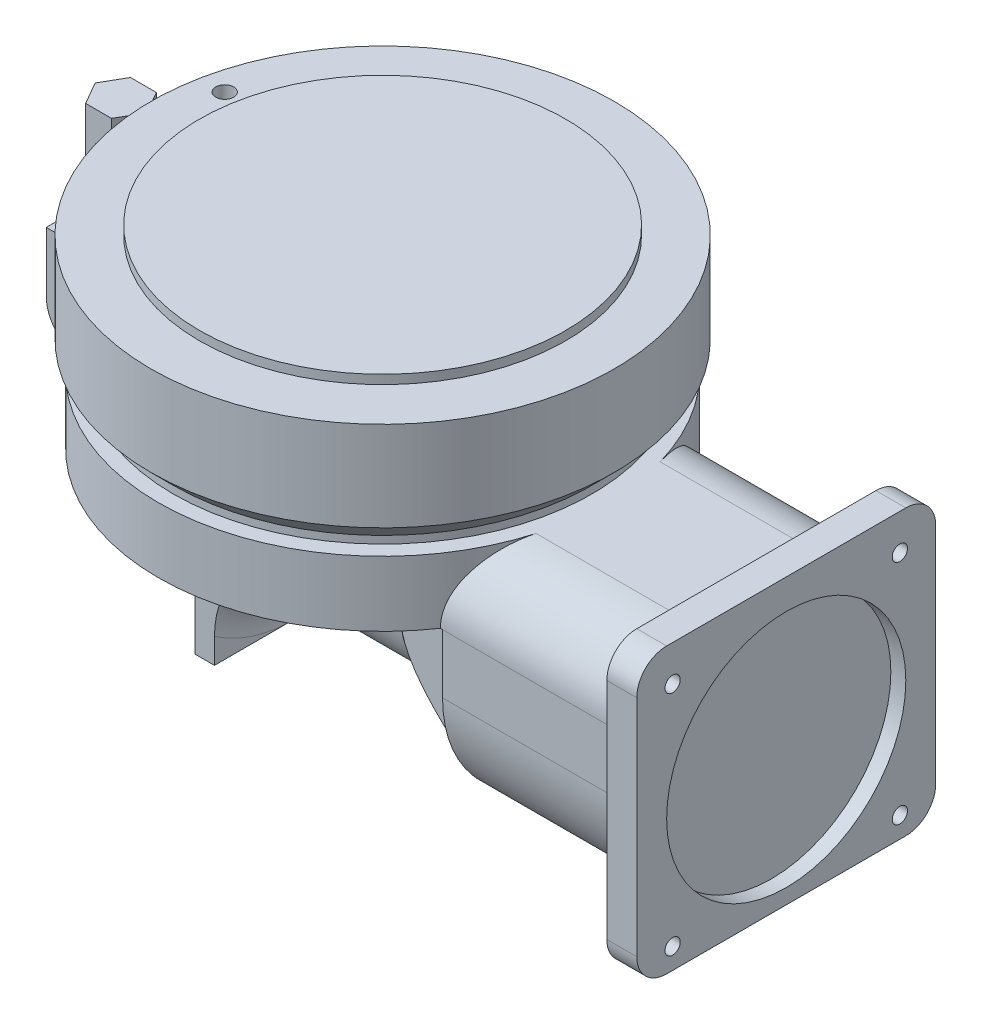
ISO-10303-21;
HEADER;
FILE_DESCRIPTION(('STEP AP214'),'2;1');
FILE_NAME('part.step','',(''),(''),'','','');
FILE_SCHEMA(('AUTOMOTIVE_DESIGN { 1 0 10303 214 1 1 1 1 }'));
ENDSEC;
DATA;
#1=APPLICATION_CONTEXT('core data for automotive mechanical design processes');
#2=APPLICATION_PROTOCOL_DEFINITION('international standard','automotive_design',2000,#1);
#3=PRODUCT_CONTEXT('',#1,'mechanical');
#4=PRODUCT('Part','Part','',(#3));
#5=PRODUCT_RELATED_PRODUCT_CATEGORY('part','',(#4));
#6=PRODUCT_DEFINITION_FORMATION('','',#4);
#7=PRODUCT_DEFINITION_CONTEXT('part definition',#1,'design');
#8=PRODUCT_DEFINITION('design','',#6,#7);
#9=PRODUCT_DEFINITION_SHAPE('','',#8);
#10=(LENGTH_UNIT() NAMED_UNIT(*) SI_UNIT(.MILLI.,.METRE.));
#11=(NAMED_UNIT(*) PLANE_ANGLE_UNIT() SI_UNIT($,.RADIAN.));
#12=(NAMED_UNIT(*) SI_UNIT($,.STERADIAN.) SOLID_ANGLE_UNIT());
#13=UNCERTAINTY_MEASURE_WITH_UNIT(LENGTH_MEASURE(1.E-05),#10,'distance_accuracy_value','');
#14=(GEOMETRIC_REPRESENTATION_CONTEXT(3) GLOBAL_UNCERTAINTY_ASSIGNED_CONTEXT((#13)) GLOBAL_UNIT_ASSIGNED_CONTEXT((#10,
#11,#12)) REPRESENTATION_CONTEXT('',''));
#15=CARTESIAN_POINT('',(0.,0.,0.));
#16=DIRECTION('',(0.,0.,1.));
#17=DIRECTION('',(1.,0.,0.));
#18=AXIS2_PLACEMENT_3D('',#15,#16,#17);
#19=CARTESIAN_POINT('',(-273.,163.,0.));
#20=DIRECTION('',(0.,1.,0.));
#21=DIRECTION('',(0.,0.,1.));
#22=AXIS2_PLACEMENT_3D('',#19,#20,#21);
#23=PLANE('',#22);
#24=CARTESIAN_POINT('',(-408.705144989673,163.,-30.0851063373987));
#25=DIRECTION('',(0.,1.,0.));
#26=DIRECTION('',(0.,0.,1.));
#27=AXIS2_PLACEMENT_3D('',#24,#25,#26);
#28=CIRCLE('',#27,6.00000000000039);
#29=CARTESIAN_POINT('',(-408.705144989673,163.,-24.0851063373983));
#30=VERTEX_POINT('',#29);
#31=EDGE_CURVE('E1546',#30,#30,#28,.T.);
#32=ORIENTED_EDGE('',*,*,#31,.F.);
#33=EDGE_LOOP('',(#32));
#34=FACE_BOUND('',#33,.T.);
#35=CARTESIAN_POINT('',(-273.,163.,0.));
#36=DIRECTION('',(0.,1.,0.));
#37=DIRECTION('',(0.,0.,1.));
#38=AXIS2_PLACEMENT_3D('',#35,#36,#37);
#39=CIRCLE('',#38,155.);
#40=CARTESIAN_POINT('',(-273.,163.,155.));
#41=VERTEX_POINT('',#40);
#42=EDGE_CURVE('E1556',#41,#41,#39,.T.);
#43=ORIENTED_EDGE('',*,*,#42,.T.);
#44=EDGE_LOOP('',(#43));
#45=FACE_BOUND('',#44,.T.);
#46=CARTESIAN_POINT('',(-273.,163.,0.));
#47=DIRECTION('',(0.,1.,0.));
#48=DIRECTION('',(0.,0.,1.));
#49=AXIS2_PLACEMENT_3D('',#46,#47,#48);
#50=CIRCLE('',#49,122.5);
#51=CARTESIAN_POINT('',(-273.,163.,122.5));
#52=VERTEX_POINT('',#51);
#53=EDGE_CURVE('E1545',#52,#52,#50,.T.);
#54=ORIENTED_EDGE('',*,*,#53,.F.);
#55=EDGE_LOOP('',(#54));
#56=FACE_BOUND('',#55,.T.);
#57=ADVANCED_FACE('F16',(#34,#45,#56),#23,.T.);
#58=CARTESIAN_POINT('',(-490.978060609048,80.,82.9490981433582));
#59=DIRECTION('',(0.,1.,0.));
#60=DIRECTION('',(0.,0.,1.));
#61=AXIS2_PLACEMENT_3D('',#58,#59,#60);
#62=PLANE('',#61);
#63=CARTESIAN_POINT('',(-434.29150065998,80.,50.));
#64=DIRECTION('',(0.,1.,0.));
#65=DIRECTION('',(0.,0.,1.));
#66=AXIS2_PLACEMENT_3D('',#63,#64,#65);
#67=CIRCLE('',#66,25.);
#68=CARTESIAN_POINT('',(-434.29150065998,80.,25.));
#69=VERTEX_POINT('',#68);
#70=CARTESIAN_POINT('',(-423.,80.,27.6952468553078));
#71=VERTEX_POINT('',#70);
#72=EDGE_CURVE('E942',#69,#71,#67,.F.);
#73=ORIENTED_EDGE('',*,*,#72,.T.);
#74=DIRECTION('',(0.,0.,-1.));
#75=VECTOR('',#74,1.);
#76=CARTESIAN_POINT('',(-423.,80.,-78.6758233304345));
#77=LINE('',#76,#75);
#78=CARTESIAN_POINT('',(-423.,80.,-27.6952468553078));
#79=VERTEX_POINT('',#78);
#80=EDGE_CURVE('E1010',#71,#79,#77,.T.);
#81=ORIENTED_EDGE('',*,*,#80,.T.);
#82=CARTESIAN_POINT('',(-434.29150065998,80.,-50.));
#83=DIRECTION('',(0.,1.,0.));
#84=DIRECTION('',(0.,0.,1.));
#85=AXIS2_PLACEMENT_3D('',#82,#83,#84);
#86=CIRCLE('',#85,25.);
#87=CARTESIAN_POINT('',(-434.29150065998,80.,-25.));
#88=VERTEX_POINT('',#87);
#89=EDGE_CURVE('E966',#79,#88,#86,.F.);
#90=ORIENTED_EDGE('',*,*,#89,.T.);
#91=DIRECTION('',(-1.,0.,0.));
#92=VECTOR('',#91,1.);
#93=CARTESIAN_POINT('',(-473.,80.,-25.));
#94=LINE('',#93,#92);
#95=CARTESIAN_POINT('',(-473.,80.,-25.));
#96=VERTEX_POINT('',#95);
#97=EDGE_CURVE('E1008',#88,#96,#94,.T.);
#98=ORIENTED_EDGE('',*,*,#97,.T.);
#99=DIRECTION('',(0.,0.,-1.));
#100=VECTOR('',#99,1.);
#101=CARTESIAN_POINT('',(-473.,80.,52.5));
#102=LINE('',#101,#100);
#103=CARTESIAN_POINT('',(-473.,80.,25.));
#104=VERTEX_POINT('',#103);
#105=EDGE_CURVE('E949',#104,#96,#102,.T.);
#106=ORIENTED_EDGE('',*,*,#105,.F.);
#107=DIRECTION('',(1.,0.,0.));
#108=VECTOR('',#107,1.);
#109=CARTESIAN_POINT('',(-473.,80.,25.));
#110=LINE('',#109,#108);
#111=EDGE_CURVE('E939',#104,#69,#110,.T.);
#112=ORIENTED_EDGE('',*,*,#111,.T.);
#113=EDGE_LOOP('',(#73,#81,#90,#98,#106,#112));
#114=FACE_BOUND('',#113,.T.);
#115=DIRECTION('',(-0.5,0.,-0.866025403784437));
#116=VECTOR('',#115,1.);
#117=CARTESIAN_POINT('',(-430.679491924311,80.,-1.09347414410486E-13));
#118=LINE('',#117,#116);
#119=CARTESIAN_POINT('',(-430.679491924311,80.,-1.09347414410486E-13));
#120=VERTEX_POINT('',#119);
#121=CARTESIAN_POINT('',(-439.339745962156,80.,-15.));
#122=VERTEX_POINT('',#121);
#123=EDGE_CURVE('E323',#120,#122,#118,.T.);
#124=ORIENTED_EDGE('',*,*,#123,.F.);
#125=DIRECTION('',(0.5,0.,-0.866025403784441));
#126=VECTOR('',#125,1.);
#127=CARTESIAN_POINT('',(-439.339745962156,80.,15.));
#128=LINE('',#127,#126);
#129=CARTESIAN_POINT('',(-439.339745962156,80.,15.));
#130=VERTEX_POINT('',#129);
#131=EDGE_CURVE('E334',#130,#120,#128,.T.);
#132=ORIENTED_EDGE('',*,*,#131,.F.);
#133=DIRECTION('',(1.,0.,0.));
#134=VECTOR('',#133,1.);
#135=CARTESIAN_POINT('',(-456.660254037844,80.,15.));
#136=LINE('',#135,#134);
#137=CARTESIAN_POINT('',(-456.660254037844,80.,15.));
#138=VERTEX_POINT('',#137);
#139=EDGE_CURVE('E354',#138,#130,#136,.T.);
#140=ORIENTED_EDGE('',*,*,#139,.F.);
#141=DIRECTION('',(0.500000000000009,0.,0.866025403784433));
#142=VECTOR('',#141,1.);
#143=CARTESIAN_POINT('',(-465.320508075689,80.,0.));
#144=LINE('',#143,#142);
#145=CARTESIAN_POINT('',(-465.320508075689,80.,0.));
#146=VERTEX_POINT('',#145);
#147=EDGE_CURVE('E352',#146,#138,#144,.T.);
#148=ORIENTED_EDGE('',*,*,#147,.F.);
#149=DIRECTION('',(-0.499999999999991,0.,0.866025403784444));
#150=VECTOR('',#149,1.);
#151=CARTESIAN_POINT('',(-456.660254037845,80.,-15.));
#152=LINE('',#151,#150);
#153=CARTESIAN_POINT('',(-456.660254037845,80.,-15.));
#154=VERTEX_POINT('',#153);
#155=EDGE_CURVE('E347',#154,#146,#152,.T.);
#156=ORIENTED_EDGE('',*,*,#155,.F.);
#157=DIRECTION('',(-1.,0.,0.));
#158=VECTOR('',#157,1.);
#159=CARTESIAN_POINT('',(-439.339745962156,80.,-15.));
#160=LINE('',#159,#158);
#161=EDGE_CURVE('E345',#122,#154,#160,.T.);
#162=ORIENTED_EDGE('',*,*,#161,.F.);
#163=EDGE_LOOP('',(#124,#132,#140,#148,#156,#162));
#164=FACE_BOUND('',#163,.T.);
#165=ADVANCED_FACE('F343',(#114,#164),#62,.T.);
#166=CARTESIAN_POINT('',(-23.,100.,100.));
#167=DIRECTION('',(0.,0.,1.));
#168=DIRECTION('',(0.,-1.,0.));
#169=AXIS2_PLACEMENT_3D('',#166,#167,#168);
#170=PLANE('',#169);
#171=DIRECTION('',(1.,0.,0.));
#172=VECTOR('',#171,1.);
#173=CARTESIAN_POINT('',(-23.,-70.,100.));
#174=LINE('',#173,#172);
#175=CARTESIAN_POINT('',(-23.,-70.,100.));
#176=VERTEX_POINT('',#175);
#177=CARTESIAN_POINT('',(-3.,-70.,100.));
#178=VERTEX_POINT('',#177);
#179=EDGE_CURVE('E968',#176,#178,#174,.T.);
#180=ORIENTED_EDGE('',*,*,#179,.T.);
#181=DIRECTION('',(0.,1.,0.));
#182=VECTOR('',#181,1.);
#183=CARTESIAN_POINT('',(-3.,100.,100.));
#184=LINE('',#183,#182);
#185=CARTESIAN_POINT('',(-3.,80.,100.));
#186=VERTEX_POINT('',#185);
#187=EDGE_CURVE('E406',#178,#186,#184,.T.);
#188=ORIENTED_EDGE('',*,*,#187,.T.);
#189=DIRECTION('',(1.,0.,0.));
#190=VECTOR('',#189,1.);
#191=CARTESIAN_POINT('',(-23.,80.,100.));
#192=LINE('',#191,#190);
#193=CARTESIAN_POINT('',(-23.,80.,100.));
#194=VERTEX_POINT('',#193);
#195=EDGE_CURVE('E971',#186,#194,#192,.F.);
#196=ORIENTED_EDGE('',*,*,#195,.T.);
#197=DIRECTION('',(0.,-1.,0.));
#198=VECTOR('',#197,1.);
#199=CARTESIAN_POINT('',(-23.,100.,100.));
#200=LINE('',#199,#198);
#201=EDGE_CURVE('E762',#194,#176,#200,.T.);
#202=ORIENTED_EDGE('',*,*,#201,.T.);
#203=EDGE_LOOP('',(#180,#188,#196,#202));
#204=FACE_BOUND('',#203,.T.);
#205=ADVANCED_FACE('F18',(#204),#170,.T.);
#206=CARTESIAN_POINT('',(-23.,100.,100.));
#207=DIRECTION('',(0.,1.,0.));
#208=DIRECTION('',(0.,0.,1.));
#209=AXIS2_PLACEMENT_3D('',#206,#207,#208);
#210=PLANE('',#209);
#211=DIRECTION('',(1.,0.,0.));
#212=VECTOR('',#211,1.);
#213=CARTESIAN_POINT('',(-23.,100.,80.));
#214=LINE('',#213,#212);
#215=CARTESIAN_POINT('',(-23.,100.,80.));
#216=VERTEX_POINT('',#215);
#217=CARTESIAN_POINT('',(-3.,100.,80.));
#218=VERTEX_POINT('',#217);
#219=EDGE_CURVE('E977',#216,#218,#214,.T.);
#220=ORIENTED_EDGE('',*,*,#219,.T.);
#221=DIRECTION('',(0.,0.,-1.));
#222=VECTOR('',#221,1.);
#223=CARTESIAN_POINT('',(-3.,100.,100.));
#224=LINE('',#223,#222);
#225=CARTESIAN_POINT('',(-3.,100.,-80.));
#226=VERTEX_POINT('',#225);
#227=EDGE_CURVE('E39',#218,#226,#224,.T.);
#228=ORIENTED_EDGE('',*,*,#227,.T.);
#229=DIRECTION('',(1.,0.,0.));
#230=VECTOR('',#229,1.);
#231=CARTESIAN_POINT('',(-23.,100.,-80.));
#232=LINE('',#231,#230);
#233=CARTESIAN_POINT('',(-23.,100.,-80.));
#234=VERTEX_POINT('',#233);
#235=EDGE_CURVE('E975',#226,#234,#232,.F.);
#236=ORIENTED_EDGE('',*,*,#235,.T.);
#237=DIRECTION('',(0.,0.,1.));
#238=VECTOR('',#237,1.);
#239=CARTESIAN_POINT('',(-23.,100.,100.));
#240=LINE('',#239,#238);
#241=EDGE_CURVE('E771',#234,#216,#240,.T.);
#242=ORIENTED_EDGE('',*,*,#241,.T.);
#243=EDGE_LOOP('',(#220,#228,#236,#242));
#244=FACE_BOUND('',#243,.T.);
#245=ADVANCED_FACE('F1133',(#244),#210,.T.);
#246=CARTESIAN_POINT('',(-23.,100.,-100.));
#247=DIRECTION('',(0.,0.,-1.));
#248=DIRECTION('',(0.,1.,0.));
#249=AXIS2_PLACEMENT_3D('',#246,#247,#248);
#250=PLANE('',#249);
#251=DIRECTION('',(1.,0.,0.));
#252=VECTOR('',#251,1.);
#253=CARTESIAN_POINT('',(-23.,80.,-100.));
#254=LINE('',#253,#252);
#255=CARTESIAN_POINT('',(-23.,80.,-100.));
#256=VERTEX_POINT('',#255);
#257=CARTESIAN_POINT('',(-3.,80.,-100.));
#258=VERTEX_POINT('',#257);
#259=EDGE_CURVE('E990',#256,#258,#254,.T.);
#260=ORIENTED_EDGE('',*,*,#259,.T.);
#261=DIRECTION('',(0.,-1.,0.));
#262=VECTOR('',#261,1.);
#263=CARTESIAN_POINT('',(-3.,100.,-100.));
#264=LINE('',#263,#262);
#265=CARTESIAN_POINT('',(-3.,-70.,-100.));
#266=VERTEX_POINT('',#265);
#267=EDGE_CURVE('E418',#258,#266,#264,.T.);
#268=ORIENTED_EDGE('',*,*,#267,.T.);
#269=DIRECTION('',(1.,0.,0.));
#270=VECTOR('',#269,1.);
#271=CARTESIAN_POINT('',(-23.,-70.,-100.));
#272=LINE('',#271,#270);
#273=CARTESIAN_POINT('',(-23.,-70.,-100.));
#274=VERTEX_POINT('',#273);
#275=EDGE_CURVE('E988',#266,#274,#272,.F.);
#276=ORIENTED_EDGE('',*,*,#275,.T.);
#277=DIRECTION('',(0.,1.,0.));
#278=VECTOR('',#277,1.);
#279=CARTESIAN_POINT('',(-23.,100.,-100.));
#280=LINE('',#279,#278);
#281=EDGE_CURVE('E768',#274,#256,#280,.T.);
#282=ORIENTED_EDGE('',*,*,#281,.T.);
#283=EDGE_LOOP('',(#260,#268,#276,#282));
#284=FACE_BOUND('',#283,.T.);
#285=ADVANCED_FACE('F1110',(#284),#250,.T.);
#286=CARTESIAN_POINT('',(-23.,-90.,100.));
#287=DIRECTION('',(0.,-1.,0.));
#288=DIRECTION('',(0.,0.,-1.));
#289=AXIS2_PLACEMENT_3D('',#286,#287,#288);
#290=PLANE('',#289);
#291=DIRECTION('',(1.,0.,0.));
#292=VECTOR('',#291,1.);
#293=CARTESIAN_POINT('',(-23.,-90.,-80.));
#294=LINE('',#293,#292);
#295=CARTESIAN_POINT('',(-23.,-90.,-80.));
#296=VERTEX_POINT('',#295);
#297=CARTESIAN_POINT('',(-3.,-90.,-80.));
#298=VERTEX_POINT('',#297);
#299=EDGE_CURVE('E993',#296,#298,#294,.T.);
#300=ORIENTED_EDGE('',*,*,#299,.T.);
#301=DIRECTION('',(0.,0.,1.));
#302=VECTOR('',#301,1.);
#303=CARTESIAN_POINT('',(-3.,-90.,100.));
#304=LINE('',#303,#302);
#305=CARTESIAN_POINT('',(-3.,-90.,80.));
#306=VERTEX_POINT('',#305);
#307=EDGE_CURVE('E415',#298,#306,#304,.T.);
#308=ORIENTED_EDGE('',*,*,#307,.T.);
#309=DIRECTION('',(1.,0.,0.));
#310=VECTOR('',#309,1.);
#311=CARTESIAN_POINT('',(-23.,-90.,80.));
#312=LINE('',#311,#310);
#313=CARTESIAN_POINT('',(-23.,-90.,80.));
#314=VERTEX_POINT('',#313);
#315=EDGE_CURVE('E996',#306,#314,#312,.F.);
#316=ORIENTED_EDGE('',*,*,#315,.T.);
#317=DIRECTION('',(0.,0.,-1.));
#318=VECTOR('',#317,1.);
#319=CARTESIAN_POINT('',(-23.,-90.,100.));
#320=LINE('',#319,#318);
#321=EDGE_CURVE('E765',#314,#296,#320,.T.);
#322=ORIENTED_EDGE('',*,*,#321,.T.);
#323=EDGE_LOOP('',(#300,#308,#316,#322));
#324=FACE_BOUND('',#323,.T.);
#325=ADVANCED_FACE('F1120',(#324),#290,.T.);
#326=CARTESIAN_POINT('',(-23.,-70.,-80.));
#327=DIRECTION('',(1.,0.,0.));
#328=DIRECTION('',(0.,0.,-1.));
#329=AXIS2_PLACEMENT_3D('',#326,#327,#328);
#330=CYLINDRICAL_SURFACE('',#329,20.);
#331=ORIENTED_EDGE('',*,*,#275,.F.);
#332=CARTESIAN_POINT('',(-3.,-70.,-80.));
#333=DIRECTION('',(1.,0.,0.));
#334=DIRECTION('',(0.,0.,-1.));
#335=AXIS2_PLACEMENT_3D('',#332,#333,#334);
#336=CIRCLE('',#335,20.);
#337=EDGE_CURVE('E421',#266,#298,#336,.F.);
#338=ORIENTED_EDGE('',*,*,#337,.T.);
#339=ORIENTED_EDGE('',*,*,#299,.F.);
#340=CARTESIAN_POINT('',(-23.,-70.,-80.));
#341=DIRECTION('',(1.,0.,0.));
#342=DIRECTION('',(0.,0.,-1.));
#343=AXIS2_PLACEMENT_3D('',#340,#341,#342);
#344=CIRCLE('',#343,20.);
#345=EDGE_CURVE('E980',#274,#296,#344,.F.);
#346=ORIENTED_EDGE('',*,*,#345,.F.);
#347=EDGE_LOOP('',(#331,#338,#339,#346));
#348=FACE_BOUND('',#347,.T.);
#349=ADVANCED_FACE('F1118',(#348),#330,.T.);
#350=CARTESIAN_POINT('',(-23.,80.,-80.));
#351=DIRECTION('',(1.,0.,0.));
#352=DIRECTION('',(0.,0.,-1.));
#353=AXIS2_PLACEMENT_3D('',#350,#351,#352);
#354=CYLINDRICAL_SURFACE('',#353,20.);
#355=ORIENTED_EDGE('',*,*,#235,.F.);
#356=CARTESIAN_POINT('',(-3.,80.,-80.));
#357=DIRECTION('',(1.,0.,0.));
#358=DIRECTION('',(0.,0.,-1.));
#359=AXIS2_PLACEMENT_3D('',#356,#357,#358);
#360=CIRCLE('',#359,20.);
#361=EDGE_CURVE('E412',#226,#258,#360,.F.);
#362=ORIENTED_EDGE('',*,*,#361,.T.);
#363=ORIENTED_EDGE('',*,*,#259,.F.);
#364=CARTESIAN_POINT('',(-23.,80.,-80.));
#365=DIRECTION('',(1.,0.,0.));
#366=DIRECTION('',(0.,0.,-1.));
#367=AXIS2_PLACEMENT_3D('',#364,#365,#366);
#368=CIRCLE('',#367,20.);
#369=EDGE_CURVE('E982',#234,#256,#368,.F.);
#370=ORIENTED_EDGE('',*,*,#369,.F.);
#371=EDGE_LOOP('',(#355,#362,#363,#370));
#372=FACE_BOUND('',#371,.T.);
#373=ADVANCED_FACE('F1108',(#372),#354,.T.);
#374=CARTESIAN_POINT('',(-23.,-70.,80.));
#375=DIRECTION('',(1.,0.,0.));
#376=DIRECTION('',(0.,0.,-1.));
#377=AXIS2_PLACEMENT_3D('',#374,#375,#376);
#378=CYLINDRICAL_SURFACE('',#377,20.);
#379=ORIENTED_EDGE('',*,*,#315,.F.);
#380=CARTESIAN_POINT('',(-3.,-70.,80.));
#381=DIRECTION('',(1.,0.,0.));
#382=DIRECTION('',(0.,0.,-1.));
#383=AXIS2_PLACEMENT_3D('',#380,#381,#382);
#384=CIRCLE('',#383,20.);
#385=EDGE_CURVE('E409',#306,#178,#384,.F.);
#386=ORIENTED_EDGE('',*,*,#385,.T.);
#387=ORIENTED_EDGE('',*,*,#179,.F.);
#388=CARTESIAN_POINT('',(-23.,-70.,80.));
#389=DIRECTION('',(1.,0.,0.));
#390=DIRECTION('',(0.,0.,-1.));
#391=AXIS2_PLACEMENT_3D('',#388,#389,#390);
#392=CIRCLE('',#391,20.);
#393=EDGE_CURVE('E984',#314,#176,#392,.F.);
#394=ORIENTED_EDGE('',*,*,#393,.F.);
#395=EDGE_LOOP('',(#379,#386,#387,#394));
#396=FACE_BOUND('',#395,.T.);
#397=ADVANCED_FACE('F1126',(#396),#378,.T.);
#398=CARTESIAN_POINT('',(-23.,80.,80.));
#399=DIRECTION('',(1.,0.,0.));
#400=DIRECTION('',(0.,0.,-1.));
#401=AXIS2_PLACEMENT_3D('',#398,#399,#400);
#402=CYLINDRICAL_SURFACE('',#401,20.);
#403=ORIENTED_EDGE('',*,*,#195,.F.);
#404=CARTESIAN_POINT('',(-3.,80.,80.));
#405=DIRECTION('',(1.,0.,0.));
#406=DIRECTION('',(0.,0.,-1.));
#407=AXIS2_PLACEMENT_3D('',#404,#405,#406);
#408=CIRCLE('',#407,20.);
#409=EDGE_CURVE('E24',#186,#218,#408,.F.);
#410=ORIENTED_EDGE('',*,*,#409,.T.);
#411=ORIENTED_EDGE('',*,*,#219,.F.);
#412=CARTESIAN_POINT('',(-23.,80.,80.));
#413=DIRECTION('',(1.,0.,0.));
#414=DIRECTION('',(0.,0.,-1.));
#415=AXIS2_PLACEMENT_3D('',#412,#413,#414);
#416=CIRCLE('',#415,20.);
#417=EDGE_CURVE('E986',#194,#216,#416,.F.);
#418=ORIENTED_EDGE('',*,*,#417,.F.);
#419=EDGE_LOOP('',(#403,#410,#411,#418));
#420=FACE_BOUND('',#419,.T.);
#421=ADVANCED_FACE('F656',(#420),#402,.T.);
#422=CARTESIAN_POINT('',(-473.,0.,52.5));
#423=DIRECTION('',(-1.,0.,0.));
#424=DIRECTION('',(0.,0.,1.));
#425=AXIS2_PLACEMENT_3D('',#422,#423,#424);
#426=PLANE('',#425);
#427=DIRECTION('',(0.,1.,0.));
#428=VECTOR('',#427,1.);
#429=CARTESIAN_POINT('',(-473.,-90.,25.));
#430=LINE('',#429,#428);
#431=CARTESIAN_POINT('',(-473.,40.,25.));
#432=VERTEX_POINT('',#431);
#433=EDGE_CURVE('E844',#432,#104,#430,.T.);
#434=ORIENTED_EDGE('',*,*,#433,.T.);
#435=ORIENTED_EDGE('',*,*,#105,.T.);
#436=DIRECTION('',(0.,1.,0.));
#437=VECTOR('',#436,1.);
#438=CARTESIAN_POINT('',(-473.,-90.,-25.));
#439=LINE('',#438,#437);
#440=CARTESIAN_POINT('',(-473.,40.,-25.));
#441=VERTEX_POINT('',#440);
#442=EDGE_CURVE('E840',#441,#96,#439,.T.);
#443=ORIENTED_EDGE('',*,*,#442,.F.);
#444=DIRECTION('',(0.,0.,-1.));
#445=VECTOR('',#444,1.);
#446=CARTESIAN_POINT('',(-473.,40.,52.5));
#447=LINE('',#446,#445);
#448=EDGE_CURVE('E1000',#441,#432,#447,.F.);
#449=ORIENTED_EDGE('',*,*,#448,.T.);
#450=EDGE_LOOP('',(#434,#435,#443,#449));
#451=FACE_BOUND('',#450,.T.);
#452=ADVANCED_FACE('F652',(#451),#426,.T.);
#453=CARTESIAN_POINT('',(-473.,-90.,25.));
#454=DIRECTION('',(0.,0.,-1.));
#455=DIRECTION('',(-1.,0.,0.));
#456=AXIS2_PLACEMENT_3D('',#453,#454,#455);
#457=PLANE('',#456);
#458=ORIENTED_EDGE('',*,*,#111,.F.);
#459=ORIENTED_EDGE('',*,*,#433,.F.);
#460=CARTESIAN_POINT('',(-448.,40.,25.));
#461=DIRECTION('',(0.,0.,-1.));
#462=DIRECTION('',(-1.,0.,0.));
#463=AXIS2_PLACEMENT_3D('',#460,#461,#462);
#464=CIRCLE('',#463,25.);
#465=CARTESIAN_POINT('',(-448.,15.,25.));
#466=VERTEX_POINT('',#465);
#467=EDGE_CURVE('E998',#432,#466,#464,.F.);
#468=ORIENTED_EDGE('',*,*,#467,.T.);
#469=DIRECTION('',(1.,0.,0.));
#470=VECTOR('',#469,1.);
#471=CARTESIAN_POINT('',(-473.,15.,25.));
#472=LINE('',#471,#470);
#473=CARTESIAN_POINT('',(-434.29150065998,15.,25.));
#474=VERTEX_POINT('',#473);
#475=EDGE_CURVE('E774',#466,#474,#472,.T.);
#476=ORIENTED_EDGE('',*,*,#475,.T.);
#477=DIRECTION('',(0.,1.,0.));
#478=VECTOR('',#477,1.);
#479=CARTESIAN_POINT('',(-434.29150065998,-90.,25.));
#480=LINE('',#479,#478);
#481=EDGE_CURVE('E907',#474,#69,#480,.T.);
#482=ORIENTED_EDGE('',*,*,#481,.T.);
#483=EDGE_LOOP('',(#458,#459,#468,#476,#482));
#484=FACE_BOUND('',#483,.T.);
#485=ADVANCED_FACE('F655',(#484),#457,.F.);
#486=CARTESIAN_POINT('',(-473.,-90.,-25.));
#487=DIRECTION('',(0.,0.,1.));
#488=DIRECTION('',(1.,0.,0.));
#489=AXIS2_PLACEMENT_3D('',#486,#487,#488);
#490=PLANE('',#489);
#491=ORIENTED_EDGE('',*,*,#97,.F.);
#492=DIRECTION('',(0.,1.,0.));
#493=VECTOR('',#492,1.);
#494=CARTESIAN_POINT('',(-434.29150065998,-90.,-25.));
#495=LINE('',#494,#493);
#496=CARTESIAN_POINT('',(-434.29150065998,15.,-25.));
#497=VERTEX_POINT('',#496);
#498=EDGE_CURVE('E921',#88,#497,#495,.F.);
#499=ORIENTED_EDGE('',*,*,#498,.T.);
#500=DIRECTION('',(-1.,0.,0.));
#501=VECTOR('',#500,1.);
#502=CARTESIAN_POINT('',(-473.,15.,-25.));
#503=LINE('',#502,#501);
#504=CARTESIAN_POINT('',(-448.,15.,-25.));
#505=VERTEX_POINT('',#504);
#506=EDGE_CURVE('E776',#497,#505,#503,.T.);
#507=ORIENTED_EDGE('',*,*,#506,.T.);
#508=CARTESIAN_POINT('',(-448.,40.,-25.));
#509=DIRECTION('',(0.,0.,1.));
#510=DIRECTION('',(1.,0.,0.));
#511=AXIS2_PLACEMENT_3D('',#508,#509,#510);
#512=CIRCLE('',#511,25.);
#513=EDGE_CURVE('E1001',#505,#441,#512,.F.);
#514=ORIENTED_EDGE('',*,*,#513,.T.);
#515=ORIENTED_EDGE('',*,*,#442,.T.);
#516=EDGE_LOOP('',(#491,#499,#507,#514,#515));
#517=FACE_BOUND('',#516,.T.);
#518=ADVANCED_FACE('F1007',(#517),#490,.F.);
#519=CARTESIAN_POINT('',(-333.,500000.,52.5));
#520=DIRECTION('',(1.,0.,0.));
#521=DIRECTION('',(0.,0.,-1.));
#522=AXIS2_PLACEMENT_3D('',#519,#520,#521);
#523=PLANE('',#522);
#524=DIRECTION('',(0.,-1.,0.));
#525=VECTOR('',#524,1.);
#526=CARTESIAN_POINT('',(-333.,500000.,-52.5));
#527=LINE('',#526,#525);
#528=CARTESIAN_POINT('',(-333.,-73.1009575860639,-52.5));
#529=VERTEX_POINT('',#528);
#530=CARTESIAN_POINT('',(-333.,-90.,-52.5));
#531=VERTEX_POINT('',#530);
#532=EDGE_CURVE('E718',#529,#531,#527,.T.);
#533=ORIENTED_EDGE('',*,*,#532,.F.);
#534=CARTESIAN_POINT('',(-333.,0.,0.));
#535=DIRECTION('',(1.,0.,0.));
#536=DIRECTION('',(0.,0.,-1.));
#537=AXIS2_PLACEMENT_3D('',#534,#535,#536);
#538=CIRCLE('',#537,90.);
#539=CARTESIAN_POINT('',(-333.,-90.,0.));
#540=VERTEX_POINT('',#539);
#541=EDGE_CURVE('E691',#529,#540,#538,.F.);
#542=ORIENTED_EDGE('',*,*,#541,.T.);
#543=DIRECTION('',(0.,0.,1.));
#544=VECTOR('',#543,1.);
#545=CARTESIAN_POINT('',(-333.,-90.,52.5));
#546=LINE('',#545,#544);
#547=EDGE_CURVE('E724',#531,#540,#546,.T.);
#548=ORIENTED_EDGE('',*,*,#547,.F.);
#549=EDGE_LOOP('',(#533,#542,#548));
#550=FACE_BOUND('',#549,.T.);
#551=ADVANCED_FACE('F671',(#550),#523,.T.);
#552=CARTESIAN_POINT('',(-273.,39.5,0.));
#553=DIRECTION('',(0.,1.,0.));
#554=DIRECTION('',(0.,0.,1.));
#555=AXIS2_PLACEMENT_3D('',#552,#553,#554);
#556=CYLINDRICAL_SURFACE('',#555,150.);
#557=CARTESIAN_POINT('',(-273.,39.5,0.));
#558=DIRECTION('',(0.,1.,0.));
#559=DIRECTION('',(0.,0.,1.));
#560=AXIS2_PLACEMENT_3D('',#557,#558,#559);
#561=CIRCLE('',#560,150.);
#562=CARTESIAN_POINT('',(-149.407929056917,39.5,-85.));
#563=VERTEX_POINT('',#562);
#564=CARTESIAN_POINT('',(-420.084802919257,39.5,-29.4289101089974));
#565=VERTEX_POINT('',#564);
#566=EDGE_CURVE('E743',#563,#565,#561,.T.);
#567=ORIENTED_EDGE('',*,*,#566,.T.);
#568=DIRECTION('',(0.,1.,0.));
#569=VECTOR('',#568,1.);
#570=CARTESIAN_POINT('',(-420.084802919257,39.5,-29.4289101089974));
#571=LINE('',#570,#569);
#572=CARTESIAN_POINT('',(-420.084802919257,83.,-29.4289101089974));
#573=VERTEX_POINT('',#572);
#574=EDGE_CURVE('E919',#565,#573,#571,.T.);
#575=ORIENTED_EDGE('',*,*,#574,.T.);
#576=CARTESIAN_POINT('',(-273.,83.,0.));
#577=DIRECTION('',(0.,1.,0.));
#578=DIRECTION('',(0.,0.,1.));
#579=AXIS2_PLACEMENT_3D('',#576,#577,#578);
#580=CIRCLE('',#579,150.);
#581=CARTESIAN_POINT('',(-128.85510761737,83.,-41.5));
#582=VERTEX_POINT('',#581);
#583=EDGE_CURVE('E739',#582,#573,#580,.T.);
#584=ORIENTED_EDGE('',*,*,#583,.F.);
#585=CARTESIAN_POINT('',(-128.85510761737,83.,-41.5));
#586=CARTESIAN_POINT('',(-129.041273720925,83.0000081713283,-42.1466645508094));
#587=CARTESIAN_POINT('',(-129.231806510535,82.9855804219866,-42.7920484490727));
#588=CARTESIAN_POINT('',(-129.621156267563,82.9282561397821,-44.0789997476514));
#589=CARTESIAN_POINT('',(-129.819972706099,82.8853614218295,-44.7205673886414));
#590=CARTESIAN_POINT('',(-130.225362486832,82.7715347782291,-45.9983924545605));
#591=CARTESIAN_POINT('',(-130.431931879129,82.7006169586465,-46.6346523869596));
#592=CARTESIAN_POINT('',(-130.852404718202,82.5312132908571,-47.9010076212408));
#593=CARTESIAN_POINT('',(-131.066308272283,82.4327270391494,-48.5311028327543));
#594=CARTESIAN_POINT('',(-131.716757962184,82.0973811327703,-50.4062509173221));
#595=CARTESIAN_POINT('',(-132.16351953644,81.8202146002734,-51.6408117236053));
#596=CARTESIAN_POINT('',(-133.079449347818,81.1623173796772,-54.0733759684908));
#597=CARTESIAN_POINT('',(-133.548620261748,80.7815742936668,-55.2713750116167));
#598=CARTESIAN_POINT('',(-134.503324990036,79.9215191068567,-57.6218438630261));
#599=CARTESIAN_POINT('',(-134.988827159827,79.4423893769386,-58.7743932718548));
#600=CARTESIAN_POINT('',(-135.97137505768,78.3892756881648,-61.0300709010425));
#601=CARTESIAN_POINT('',(-136.468420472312,77.8152943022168,-62.1332004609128));
#602=CARTESIAN_POINT('',(-137.468754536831,76.5754963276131,-64.2860198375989));
#603=CARTESIAN_POINT('',(-137.972051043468,75.9095506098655,-65.3356316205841));
#604=CARTESIAN_POINT('',(-138.97768592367,74.4901094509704,-67.374413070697));
#605=CARTESIAN_POINT('',(-139.480024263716,73.7366110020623,-68.3635806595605));
#606=CARTESIAN_POINT('',(-140.504490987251,72.1011600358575,-70.3294813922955));
#607=CARTESIAN_POINT('',(-141.026163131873,71.2143902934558,-71.3024529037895));
#608=CARTESIAN_POINT('',(-142.051664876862,69.350940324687,-73.168760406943));
#609=CARTESIAN_POINT('',(-142.555492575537,68.3742505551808,-74.0620879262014));
#610=CARTESIAN_POINT('',(-143.535057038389,66.3359050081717,-75.7614002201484));
#611=CARTESIAN_POINT('',(-144.010814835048,65.274314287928,-76.5674507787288));
#612=CARTESIAN_POINT('',(-144.923906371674,63.0703674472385,-78.0852001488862));
#613=CARTESIAN_POINT('',(-145.361250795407,61.9280339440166,-78.7969252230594));
#614=CARTESIAN_POINT('',(-146.1005368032,59.8134539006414,-79.9806686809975));
#615=CARTESIAN_POINT('',(-146.41174529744,58.8550907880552,-80.4717834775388));
#616=CARTESIAN_POINT('',(-146.997048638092,56.8950982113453,-81.385198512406));
#617=CARTESIAN_POINT('',(-147.271145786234,55.8934714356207,-81.8075030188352));
#618=CARTESIAN_POINT('',(-147.775849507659,53.8539181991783,-82.5779873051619));
#619=CARTESIAN_POINT('',(-148.006544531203,52.8160707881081,-82.9263180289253));
#620=CARTESIAN_POINT('',(-148.41960719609,50.7082339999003,-83.5455842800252));
#621=CARTESIAN_POINT('',(-148.601987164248,49.638252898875,-83.8165395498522));
#622=CARTESIAN_POINT('',(-148.864098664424,47.8179466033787,-84.2039999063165));
#623=CARTESIAN_POINT('',(-148.958028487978,47.0741964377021,-84.3422188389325));
#624=CARTESIAN_POINT('',(-149.12001374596,45.5778731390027,-84.5799610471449));
#625=CARTESIAN_POINT('',(-149.188075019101,44.825302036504,-84.6794930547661));
#626=CARTESIAN_POINT('',(-149.297536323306,43.312273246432,-84.8393183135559));
#627=CARTESIAN_POINT('',(-149.338875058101,42.5518014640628,-84.8995213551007));
#628=CARTESIAN_POINT('',(-149.380275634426,41.408736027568,-84.959780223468));
#629=CARTESIAN_POINT('',(-149.39064125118,41.0272310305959,-84.9748589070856));
#630=CARTESIAN_POINT('',(-149.404469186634,40.2638261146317,-84.9949695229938));
#631=CARTESIAN_POINT('',(-149.407931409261,39.8819261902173,-85.0000013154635));
#632=CARTESIAN_POINT('',(-149.407929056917,39.5,-85.));
#633=B_SPLINE_CURVE_WITH_KNOTS('',3,(#585,#586,#587,#588,#589,#590,#591,#592,#593,#594,#595,
#596,#597,#598,#599,#600,#601,#602,#603,#604,#605,#606,#607,#608,#609,#610,#611,#612,#613,#614,
#615,#616,#617,#618,#619,#620,#621,#622,#623,#624,#625,#626,#627,#628,#629,#630,#631,#632),
.UNSPECIFIED.,.F.,.F.,(4,2,2,2,2,2,2,2,2,2,2,2,2,2,2,2,2,2,2,2,2,2,2,4),(0.,2.01857973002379,
4.03703077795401,6.05446708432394,8.07193292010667,12.0922358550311,16.1130202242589,
20.1264178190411,24.1397065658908,28.1586888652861,32.1778092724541,36.4207996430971,
40.6642408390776,44.9044609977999,49.1434980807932,52.5030482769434,55.862390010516,
59.2148096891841,62.566373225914,64.8519089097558,67.1369284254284,69.4271709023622,
70.5728324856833,71.7185100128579),.UNSPECIFIED.);
#634=EDGE_CURVE('E675',#582,#563,#633,.T.);
#635=ORIENTED_EDGE('',*,*,#634,.T.);
#636=EDGE_LOOP('',(#567,#575,#584,#635));
#637=FACE_BOUND('',#636,.T.);
#638=ADVANCED_FACE('F668',(#637),#556,.T.);
#639=CARTESIAN_POINT('',(-420.084802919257,83.,29.4289101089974));
#640=VERTEX_POINT('',#639);
#641=CARTESIAN_POINT('',(-128.85510761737,83.,41.5));
#642=VERTEX_POINT('',#641);
#643=EDGE_CURVE('E737',#640,#642,#580,.T.);
#644=ORIENTED_EDGE('',*,*,#643,.F.);
#645=DIRECTION('',(0.,1.,0.));
#646=VECTOR('',#645,1.);
#647=CARTESIAN_POINT('',(-420.084802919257,83.,29.4289101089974));
#648=LINE('',#647,#646);
#649=CARTESIAN_POINT('',(-420.084802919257,39.5,29.4289101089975));
#650=VERTEX_POINT('',#649);
#651=EDGE_CURVE('E899',#640,#650,#648,.F.);
#652=ORIENTED_EDGE('',*,*,#651,.T.);
#653=CARTESIAN_POINT('',(-149.407929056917,39.5,85.));
#654=VERTEX_POINT('',#653);
#655=EDGE_CURVE('E742',#650,#654,#561,.T.);
#656=ORIENTED_EDGE('',*,*,#655,.T.);
#657=CARTESIAN_POINT('',(-149.407929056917,39.5,85.));
#658=CARTESIAN_POINT('',(-149.407946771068,40.0471026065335,85.0000141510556));
#659=CARTESIAN_POINT('',(-149.400830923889,40.594195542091,84.9896788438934));
#660=CARTESIAN_POINT('',(-149.372463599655,41.6872149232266,84.9484160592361));
#661=CARTESIAN_POINT('',(-149.351212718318,42.2331414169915,84.9174894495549));
#662=CARTESIAN_POINT('',(-149.294724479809,43.3223861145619,84.8351765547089));
#663=CARTESIAN_POINT('',(-149.259495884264,43.8657057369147,84.7838030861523));
#664=CARTESIAN_POINT('',(-149.175320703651,44.9489418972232,84.6608190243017));
#665=CARTESIAN_POINT('',(-149.126374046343,45.4888584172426,84.5892083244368));
#666=CARTESIAN_POINT('',(-148.960152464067,47.0949946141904,84.345453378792));
#667=CARTESIAN_POINT('',(-148.823109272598,48.154907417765,84.1438281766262));
#668=CARTESIAN_POINT('',(-148.49971042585,50.2495982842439,83.6645744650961));
#669=CARTESIAN_POINT('',(-148.313349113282,51.2843734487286,83.386937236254));
#670=CARTESIAN_POINT('',(-147.89635959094,53.3200015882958,82.7600169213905));
#671=CARTESIAN_POINT('',(-147.665836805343,54.3209288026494,82.4109043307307));
#672=CARTESIAN_POINT('',(-147.165326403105,56.2860608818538,81.644621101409));
#673=CARTESIAN_POINT('',(-146.895339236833,57.2502661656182,81.2274512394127));
#674=CARTESIAN_POINT('',(-146.320793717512,59.1391282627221,80.3284727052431));
#675=CARTESIAN_POINT('',(-146.016185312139,60.0637250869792,79.8465702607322));
#676=CARTESIAN_POINT('',(-145.378052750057,61.8685061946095,78.8226012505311));
#677=CARTESIAN_POINT('',(-145.044527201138,62.7486883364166,78.2805317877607));
#678=CARTESIAN_POINT('',(-144.322818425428,64.5386048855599,77.0889769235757));
#679=CARTESIAN_POINT('',(-143.932414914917,65.4439348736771,76.4342199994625));
#680=CARTESIAN_POINT('',(-143.129797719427,67.195739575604,75.0623881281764));
#681=CARTESIAN_POINT('',(-142.717583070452,68.0422116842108,74.3453104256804));
#682=CARTESIAN_POINT('',(-141.877121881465,69.6741220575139,72.8527592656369));
#683=CARTESIAN_POINT('',(-141.448869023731,70.4595358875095,72.0772626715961));
#684=CARTESIAN_POINT('',(-140.582010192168,71.9666474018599,70.4720385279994));
#685=CARTESIAN_POINT('',(-140.143403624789,72.6883414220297,69.6423078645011));
#686=CARTESIAN_POINT('',(-139.193951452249,74.1703253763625,67.8024264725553));
#687=CARTESIAN_POINT('',(-138.682249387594,74.9198365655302,66.7840106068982));
#688=CARTESIAN_POINT('',(-137.659207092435,76.327603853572,64.6856433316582));
#689=CARTESIAN_POINT('',(-137.147866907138,76.9858500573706,63.6056852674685));
#690=CARTESIAN_POINT('',(-136.13259564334,78.2067866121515,61.3905302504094));
#691=CARTESIAN_POINT('',(-135.628660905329,78.7695257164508,60.255361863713));
#692=CARTESIAN_POINT('',(-134.634217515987,79.7956372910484,57.9353305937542));
#693=CARTESIAN_POINT('',(-134.143707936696,80.2590166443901,56.7504711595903));
#694=CARTESIAN_POINT('',(-133.219310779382,81.0500546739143,54.431554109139));
#695=CARTESIAN_POINT('',(-132.783985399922,81.3854625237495,53.3007051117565));
#696=CARTESIAN_POINT('',(-131.933851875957,81.9645886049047,51.0081868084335));
#697=CARTESIAN_POINT('',(-131.519040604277,82.2083208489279,49.8465222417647));
#698=CARTESIAN_POINT('',(-130.914762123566,82.5028219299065,48.085053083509));
#699=CARTESIAN_POINT('',(-130.716132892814,82.5891909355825,47.4941241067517));
#700=CARTESIAN_POINT('',(-130.325382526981,82.7377135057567,46.3070596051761));
#701=CARTESIAN_POINT('',(-130.13326130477,82.799867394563,45.7109241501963));
#702=CARTESIAN_POINT('',(-129.755856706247,82.899604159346,44.5141455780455));
#703=CARTESIAN_POINT('',(-129.570576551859,82.9371755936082,43.9135004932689));
#704=CARTESIAN_POINT('',(-129.207292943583,82.987377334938,42.7089431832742));
#705=CARTESIAN_POINT('',(-129.029289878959,83.0000063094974,42.1050307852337));
#706=CARTESIAN_POINT('',(-128.85510761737,83.,41.5));
#707=B_SPLINE_CURVE_WITH_KNOTS('',3,(#657,#658,#659,#660,#661,#662,#663,#664,#665,#666,#667,
#668,#669,#670,#671,#672,#673,#674,#675,#676,#677,#678,#679,#680,#681,#682,#683,#684,#685,#686,
#687,#688,#689,#690,#691,#692,#693,#694,#695,#696,#697,#698,#699,#700,#701,#702,#703,#704,#705,
#706),.UNSPECIFIED.,.F.,.F.,(4,2,2,2,2,2,2,2,2,2,2,2,2,2,2,2,2,2,2,2,2,2,2,2,4),(0.,
1.64114669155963,3.28222422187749,4.92227469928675,6.56233381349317,9.82051742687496,
13.0790749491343,16.3299483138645,19.5807845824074,22.8363818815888,26.0921360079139,
29.6392513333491,33.1865235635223,36.7352081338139,40.2840966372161,44.3718525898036,
48.4600513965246,52.5461569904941,56.6319794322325,60.4002544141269,64.1679531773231,
66.0556452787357,67.9433120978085,69.8318568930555,71.720502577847),.UNSPECIFIED.);
#708=EDGE_CURVE('E682',#654,#642,#707,.T.);
#709=ORIENTED_EDGE('',*,*,#708,.T.);
#710=EDGE_LOOP('',(#644,#652,#656,#709));
#711=FACE_BOUND('',#710,.T.);
#712=ADVANCED_FACE('F661',(#711),#556,.T.);
#713=CARTESIAN_POINT('',(-123.,0.,52.5));
#714=DIRECTION('',(0.,0.,1.));
#715=DIRECTION('',(1.,0.,0.));
#716=AXIS2_PLACEMENT_3D('',#713,#714,#715);
#717=PLANE('',#716);
#718=DIRECTION('',(1.,0.,0.));
#719=VECTOR('',#718,1.);
#720=CARTESIAN_POINT('',(-473.,39.5,52.5));
#721=LINE('',#720,#719);
#722=CARTESIAN_POINT('',(-376.250566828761,39.5,52.5));
#723=VERTEX_POINT('',#722);
#724=CARTESIAN_POINT('',(-160.416697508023,39.5,52.4999999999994));
#725=VERTEX_POINT('',#724);
#726=EDGE_CURVE('E732',#723,#725,#721,.T.);
#727=ORIENTED_EDGE('',*,*,#726,.F.);
#728=DIRECTION('',(0.,-1.,0.));
#729=VECTOR('',#728,1.);
#730=CARTESIAN_POINT('',(-376.250566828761,15.,52.5));
#731=LINE('',#730,#729);
#732=CARTESIAN_POINT('',(-376.250566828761,4.32049867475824,52.5));
#733=VERTEX_POINT('',#732);
#734=EDGE_CURVE('E859',#723,#733,#731,.T.);
#735=ORIENTED_EDGE('',*,*,#734,.T.);
#736=CARTESIAN_POINT('',(-413.512454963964,15.,52.5));
#737=CARTESIAN_POINT('',(-412.517781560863,15.00001043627,52.5));
#738=CARTESIAN_POINT('',(-411.523132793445,14.9782956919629,52.5));
#739=CARTESIAN_POINT('',(-409.535743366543,14.8918397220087,52.5));
#740=CARTESIAN_POINT('',(-408.543002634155,14.8271001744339,52.5));
#741=CARTESIAN_POINT('',(-406.561486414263,14.6550423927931,52.5));
#742=CARTESIAN_POINT('',(-405.572709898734,14.5477360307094,52.5));
#743=CARTESIAN_POINT('',(-403.600692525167,14.2910664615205,52.5));
#744=CARTESIAN_POINT('',(-402.617451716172,14.1417028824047,52.5));
#745=CARTESIAN_POINT('',(-399.682194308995,13.6319282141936,52.5));
#746=CARTESIAN_POINT('',(-397.740580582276,13.209477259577,52.5));
#747=CARTESIAN_POINT('',(-393.899612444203,12.2039550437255,52.5));
#748=CARTESIAN_POINT('',(-392.000260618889,11.6208739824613,52.5));
#749=CARTESIAN_POINT('',(-388.257725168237,10.2999731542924,52.5));
#750=CARTESIAN_POINT('',(-386.414500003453,9.56227117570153,52.5));
#751=CARTESIAN_POINT('',(-382.795098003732,7.93759625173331,52.5));
#752=CARTESIAN_POINT('',(-381.018920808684,7.05062410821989,52.5));
#753=CARTESIAN_POINT('',(-377.543819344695,5.13223598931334,52.5));
#754=CARTESIAN_POINT('',(-375.844980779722,4.10066469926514,52.5));
#755=CARTESIAN_POINT('',(-372.538957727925,1.89976057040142,52.5));
#756=CARTESIAN_POINT('',(-370.931773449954,0.730427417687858,52.5));
#757=CARTESIAN_POINT('',(-367.792070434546,-1.76376668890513,52.5));
#758=CARTESIAN_POINT('',(-366.261578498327,-3.09118332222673,52.5));
#759=CARTESIAN_POINT('',(-363.323826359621,-5.87658262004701,52.5));
#760=CARTESIAN_POINT('',(-361.916580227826,-7.33458015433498,52.5));
#761=CARTESIAN_POINT('',(-359.243376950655,-10.3723604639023,52.5));
#762=CARTESIAN_POINT('',(-357.977274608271,-11.952015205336,52.5));
#763=CARTESIAN_POINT('',(-355.603462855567,-15.225908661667,52.5));
#764=CARTESIAN_POINT('',(-354.495692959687,-16.9201032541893,52.5));
#765=CARTESIAN_POINT('',(-352.720945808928,-19.9631896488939,52.5));
#766=CARTESIAN_POINT('',(-352.013879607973,-21.2888114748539,52.5));
#767=CARTESIAN_POINT('',(-350.707169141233,-23.9920763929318,52.5));
#768=CARTESIAN_POINT('',(-350.107517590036,-25.3697159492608,52.5));
#769=CARTESIAN_POINT('',(-349.025841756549,-28.1671452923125,52.5));
#770=CARTESIAN_POINT('',(-348.543550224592,-29.5868308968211,52.5));
#771=CARTESIAN_POINT('',(-347.913464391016,-31.7430466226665,52.5));
#772=CARTESIAN_POINT('',(-347.718999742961,-32.4662062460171,52.5));
#773=CARTESIAN_POINT('',(-347.362033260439,-33.9203485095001,52.5));
#774=CARTESIAN_POINT('',(-347.199528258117,-34.6513303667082,52.5));
#775=CARTESIAN_POINT('',(-346.896094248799,-36.1761588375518,52.5));
#776=CARTESIAN_POINT('',(-346.757776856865,-36.9705261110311,52.5));
#777=CARTESIAN_POINT('',(-346.520009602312,-38.5649758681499,52.5));
#778=CARTESIAN_POINT('',(-346.420555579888,-39.3650577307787,52.5));
#779=CARTESIAN_POINT('',(-346.261077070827,-40.9698372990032,52.5));
#780=CARTESIAN_POINT('',(-346.201086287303,-41.7745383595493,52.5));
#781=CARTESIAN_POINT('',(-346.12099731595,-43.3861553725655,52.5));
#782=CARTESIAN_POINT('',(-346.100910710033,-44.1930719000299,52.5));
#783=CARTESIAN_POINT('',(-346.100957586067,-45.,52.5));
#784=B_SPLINE_CURVE_WITH_KNOTS('',3,(#736,#737,#738,#739,#740,#741,#742,#743,#744,#745,#746,
#747,#748,#749,#750,#751,#752,#753,#754,#755,#756,#757,#758,#759,#760,#761,#762,#763,#764,#765,
#766,#767,#768,#769,#770,#771,#772,#773,#774,#775,#776,#777,#778,#779,#780,#781,#782,#783),
.UNSPECIFIED.,.F.,.F.,(4,2,2,2,2,2,2,2,2,2,2,2,2,2,2,2,2,2,2,2,2,2,2,4),(0.,2.98374289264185,
5.96736941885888,8.95016438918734,11.9329857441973,17.8864348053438,23.8402471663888,
29.7895403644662,35.738801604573,41.6945026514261,47.6502172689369,53.7203143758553,
59.7911035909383,65.8555889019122,71.9177512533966,76.4206360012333,80.923215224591,
85.415443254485,87.6613935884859,89.9071211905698,92.3251316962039,94.7428833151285,
97.1626971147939,99.5832131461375),.UNSPECIFIED.);
#785=CARTESIAN_POINT('',(-346.100957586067,-45.,52.5));
#786=VERTEX_POINT('',#785);
#787=EDGE_CURVE('E480',#733,#786,#784,.T.);
#788=ORIENTED_EDGE('',*,*,#787,.T.);
#789=DIRECTION('',(0.,-1.,0.));
#790=VECTOR('',#789,1.);
#791=CARTESIAN_POINT('',(-346.100957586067,126.294830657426,52.5));
#792=LINE('',#791,#790);
#793=CARTESIAN_POINT('',(-346.100957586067,-90.,52.5));
#794=VERTEX_POINT('',#793);
#795=EDGE_CURVE('E838',#786,#794,#792,.T.);
#796=ORIENTED_EDGE('',*,*,#795,.T.);
#797=DIRECTION('',(-1.,0.,0.));
#798=VECTOR('',#797,1.);
#799=CARTESIAN_POINT('',(-333.,-90.,52.5));
#800=LINE('',#799,#798);
#801=CARTESIAN_POINT('',(-333.,-90.,52.5));
#802=VERTEX_POINT('',#801);
#803=EDGE_CURVE('E847',#802,#794,#800,.T.);
#804=ORIENTED_EDGE('',*,*,#803,.F.);
#805=DIRECTION('',(0.,-1.,0.));
#806=VECTOR('',#805,1.);
#807=CARTESIAN_POINT('',(-333.,500000.,52.5));
#808=LINE('',#807,#806);
#809=CARTESIAN_POINT('',(-333.,-73.1009575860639,52.5));
#810=VERTEX_POINT('',#809);
#811=EDGE_CURVE('E707',#810,#802,#808,.T.);
#812=ORIENTED_EDGE('',*,*,#811,.F.);
#813=CARTESIAN_POINT('',(-333.,-73.1009575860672,52.5));
#814=CARTESIAN_POINT('',(-332.999999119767,-72.3028112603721,52.5));
#815=CARTESIAN_POINT('',(-332.983188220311,-71.504787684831,52.5));
#816=CARTESIAN_POINT('',(-332.917107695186,-69.9102005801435,52.5));
#817=CARTESIAN_POINT('',(-332.867843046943,-69.1136368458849,52.5));
#818=CARTESIAN_POINT('',(-332.673282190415,-66.7297981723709,52.5));
#819=CARTESIAN_POINT('',(-332.481212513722,-65.1461534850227,52.5));
#820=CARTESIAN_POINT('',(-331.984585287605,-62.0134257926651,52.5));
#821=CARTESIAN_POINT('',(-331.681183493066,-60.4641552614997,52.5));
#822=CARTESIAN_POINT('',(-330.971140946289,-57.3888418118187,52.5));
#823=CARTESIAN_POINT('',(-330.564454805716,-55.8628094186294,52.5));
#824=CARTESIAN_POINT('',(-329.734614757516,-53.0961438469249,52.5));
#825=CARTESIAN_POINT('',(-329.326015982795,-51.8510987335,52.5));
#826=CARTESIAN_POINT('',(-328.449648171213,-49.3819354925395,52.5));
#827=CARTESIAN_POINT('',(-327.981871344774,-48.1578201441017,52.5));
#828=CARTESIAN_POINT('',(-326.497252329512,-44.5178476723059,52.5));
#829=CARTESIAN_POINT('',(-325.399257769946,-42.1348067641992,52.5));
#830=CARTESIAN_POINT('',(-323.020034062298,-37.4463773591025,52.5));
#831=CARTESIAN_POINT('',(-321.737792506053,-35.1415111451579,52.5));
#832=CARTESIAN_POINT('',(-319.031008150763,-30.6180402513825,52.5));
#833=CARTESIAN_POINT('',(-317.606484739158,-28.3994238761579,52.5));
#834=CARTESIAN_POINT('',(-314.566432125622,-23.9177687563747,52.5));
#835=CARTESIAN_POINT('',(-312.944711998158,-21.6589680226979,52.5));
#836=CARTESIAN_POINT('',(-309.613239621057,-17.2076090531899,52.5));
#837=CARTESIAN_POINT('',(-307.903481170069,-15.0150555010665,52.5));
#838=CARTESIAN_POINT('',(-302.695243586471,-8.51390730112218,52.5));
#839=CARTESIAN_POINT('',(-299.11213150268,-4.27393268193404,52.5));
#840=CARTESIAN_POINT('',(-295.519720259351,-0.0233333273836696,52.5));
#841=CARTESIAN_POINT('',(-295.509860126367,-0.011666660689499,52.5));
#842=CARTESIAN_POINT('',(-295.5,0.,52.5));
#843=B_SPLINE_CURVE_WITH_KNOTS('',3,(#813,#814,#815,#816,#817,#818,#819,#820,#821,#822,#823,
#824,#825,#826,#827,#828,#829,#830,#831,#832,#833,#834,#835,#836,#837,#838,#839,#840,#841,#842),
.UNSPECIFIED.,.F.,.F.,(4,2,2,2,2,2,2,2,2,2,2,2,2,2,4),(0.,2.39404373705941,4.78772038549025,
9.56842611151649,14.3008452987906,19.0353477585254,22.9649118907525,26.8949938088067,
34.7565416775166,42.6630682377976,50.568518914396,58.9075764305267,67.247222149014,
83.8974078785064,83.9432336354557),.UNSPECIFIED.);
#844=CARTESIAN_POINT('',(-295.5,0.,52.5));
#845=VERTEX_POINT('',#844);
#846=EDGE_CURVE('E634',#810,#845,#843,.T.);
#847=ORIENTED_EDGE('',*,*,#846,.T.);
#848=DIRECTION('',(-1.,0.,0.));
#849=VECTOR('',#848,1.);
#850=CARTESIAN_POINT('',(-208.25,0.,52.5));
#851=LINE('',#850,#849);
#852=CARTESIAN_POINT('',(-208.25,0.,52.5));
#853=VERTEX_POINT('',#852);
#854=EDGE_CURVE('E704',#853,#845,#851,.T.);
#855=ORIENTED_EDGE('',*,*,#854,.F.);
#856=CARTESIAN_POINT('',(-118.631027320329,-97.4580526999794,52.4999999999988));
#857=CARTESIAN_POINT('',(-120.057600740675,-96.4057381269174,52.4999999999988));
#858=CARTESIAN_POINT('',(-121.482361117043,-95.350961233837,52.4999999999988));
#859=CARTESIAN_POINT('',(-124.327853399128,-93.2359741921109,52.4999999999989));
#860=CARTESIAN_POINT('',(-125.748585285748,-92.1757640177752,52.4999999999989));
#861=CARTESIAN_POINT('',(-128.585754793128,-90.0492992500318,52.4999999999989));
#862=CARTESIAN_POINT('',(-130.002191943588,-88.9830440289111,52.4999999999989));
#863=CARTESIAN_POINT('',(-132.830133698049,-86.8440137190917,52.499999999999));
#864=CARTESIAN_POINT('',(-134.241638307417,-85.7712386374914,52.499999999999));
#865=CARTESIAN_POINT('',(-137.065256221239,-83.613845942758,52.499999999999));
#866=CARTESIAN_POINT('',(-138.477345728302,-82.5291971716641,52.4999999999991));
#867=CARTESIAN_POINT('',(-141.295331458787,-80.3518848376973,52.4999999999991));
#868=CARTESIAN_POINT('',(-142.701227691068,-79.2592212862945,52.4999999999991));
#869=CARTESIAN_POINT('',(-145.505990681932,-77.0650508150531,52.4999999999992));
#870=CARTESIAN_POINT('',(-146.904857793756,-75.9635443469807,52.4999999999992));
#871=CARTESIAN_POINT('',(-149.694730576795,-73.7506147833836,52.4999999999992));
#872=CARTESIAN_POINT('',(-151.08573624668,-72.6391916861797,52.4999999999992));
#873=CARTESIAN_POINT('',(-153.927917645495,-70.3495819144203,52.4999999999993));
#874=CARTESIAN_POINT('',(-155.378637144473,-69.1708284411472,52.4999999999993));
#875=CARTESIAN_POINT('',(-158.268744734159,-66.7994919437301,52.4999999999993));
#876=CARTESIAN_POINT('',(-159.708132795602,-65.6069088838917,52.4999999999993));
#877=CARTESIAN_POINT('',(-162.573999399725,-63.2058222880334,52.4999999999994));
#878=CARTESIAN_POINT('',(-164.000475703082,-61.9973160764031,52.4999999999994));
#879=CARTESIAN_POINT('',(-166.838018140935,-59.562341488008,52.4999999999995));
#880=CARTESIAN_POINT('',(-168.249084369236,-58.3358732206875,52.4999999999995));
#881=CARTESIAN_POINT('',(-171.050372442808,-55.8646083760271,52.4999999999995));
#882=CARTESIAN_POINT('',(-172.440628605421,-54.6198507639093,52.4999999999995));
#883=CARTESIAN_POINT('',(-175.199521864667,-52.1064918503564,52.4999999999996));
#884=CARTESIAN_POINT('',(-176.56815834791,-50.8378898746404,52.4999999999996));
#885=CARTESIAN_POINT('',(-179.278860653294,-48.273364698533,52.4999999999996));
#886=CARTESIAN_POINT('',(-180.620934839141,-46.9774503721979,52.4999999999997));
#887=CARTESIAN_POINT('',(-182.60991089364,-45.0092982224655,52.4999999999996));
#888=CARTESIAN_POINT('',(-183.268861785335,-44.349220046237,52.4999999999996));
#889=CARTESIAN_POINT('',(-184.577807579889,-43.0202491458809,52.4999999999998));
#890=CARTESIAN_POINT('',(-185.227802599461,-42.3513565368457,52.5));
#891=CARTESIAN_POINT('',(-186.598317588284,-40.9198971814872,52.5));
#892=CARTESIAN_POINT('',(-187.317512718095,-40.1560600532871,52.4999999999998));
#893=CARTESIAN_POINT('',(-188.741515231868,-38.6150620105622,52.4999999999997));
#894=CARTESIAN_POINT('',(-189.446322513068,-37.8379010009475,52.4999999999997));
#895=CARTESIAN_POINT('',(-190.83972492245,-36.2686274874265,52.4999999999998));
#896=CARTESIAN_POINT('',(-191.52831380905,-35.4765094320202,52.4999999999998));
#897=CARTESIAN_POINT('',(-192.886504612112,-33.8761374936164,52.4999999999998));
#898=CARTESIAN_POINT('',(-193.556106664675,-33.0678837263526,52.4999999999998));
#899=CARTESIAN_POINT('',(-194.869945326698,-31.4378259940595,52.4999999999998));
#900=CARTESIAN_POINT('',(-195.514294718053,-30.6161131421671,52.4999999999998));
#901=CARTESIAN_POINT('',(-196.777715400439,-28.9533774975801,52.4999999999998));
#902=CARTESIAN_POINT('',(-197.396785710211,-28.112353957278,52.4999999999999));
#903=CARTESIAN_POINT('',(-198.605042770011,-26.4096676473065,52.4999999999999));
#904=CARTESIAN_POINT('',(-199.194244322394,-25.5480154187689,52.4999999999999));
#905=CARTESIAN_POINT('',(-200.33786489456,-23.8020226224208,52.4999999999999));
#906=CARTESIAN_POINT('',(-200.892288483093,-22.9176850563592,52.5));
#907=CARTESIAN_POINT('',(-202.034948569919,-20.9992605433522,52.5));
#908=CARTESIAN_POINT('',(-202.617086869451,-19.9615137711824,52.5));
#909=CARTESIAN_POINT('',(-203.717490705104,-17.8524434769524,52.4999999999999));
#910=CARTESIAN_POINT('',(-204.235755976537,-16.7811198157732,52.4999999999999));
#911=CARTESIAN_POINT('',(-205.194968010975,-14.6060200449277,52.5));
#912=CARTESIAN_POINT('',(-205.636028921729,-13.5022947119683,52.5));
#913=CARTESIAN_POINT('',(-206.427655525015,-11.262704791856,52.5));
#914=CARTESIAN_POINT('',(-206.778241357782,-10.1268474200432,52.5));
#915=CARTESIAN_POINT('',(-207.326336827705,-8.01511979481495,52.5));
#916=CARTESIAN_POINT('',(-207.539477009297,-7.04331690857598,52.5));
#917=CARTESIAN_POINT('',(-207.88540680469,-5.08545370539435,52.5));
#918=CARTESIAN_POINT('',(-208.018205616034,-4.09939503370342,52.5));
#919=CARTESIAN_POINT('',(-208.198386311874,-2.12023668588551,52.5));
#920=CARTESIAN_POINT('',(-208.245837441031,-1.1271433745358,52.5));
#921=CARTESIAN_POINT('',(-208.253636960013,0.859414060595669,52.5));
#922=CARTESIAN_POINT('',(-208.213983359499,1.85287819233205,52.5));
#923=CARTESIAN_POINT('',(-208.049309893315,3.83084023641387,52.5));
#924=CARTESIAN_POINT('',(-207.924442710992,4.81535099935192,52.5));
#925=CARTESIAN_POINT('',(-207.594228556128,6.77064995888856,52.5));
#926=CARTESIAN_POINT('',(-207.388880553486,7.74143797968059,52.5));
#927=CARTESIAN_POINT('',(-206.904467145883,9.66508544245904,52.5));
#928=CARTESIAN_POINT('',(-206.625345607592,10.6179306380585,52.5));
#929=CARTESIAN_POINT('',(-206.001567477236,12.5017757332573,52.5));
#930=CARTESIAN_POINT('',(-205.656903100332,13.4327730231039,52.5));
#931=CARTESIAN_POINT('',(-204.632866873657,15.9547001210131,52.5));
#932=CARTESIAN_POINT('',(-203.895055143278,17.5221009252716,52.5));
#933=CARTESIAN_POINT('',(-202.68812869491,19.8196032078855,52.4999999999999));
#934=CARTESIAN_POINT('',(-202.268871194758,20.576888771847,52.4999999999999));
#935=CARTESIAN_POINT('',(-201.400983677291,22.0744979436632,52.4999999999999));
#936=CARTESIAN_POINT('',(-200.95235496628,22.8148223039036,52.4999999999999));
#937=CARTESIAN_POINT('',(-200.024532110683,24.287161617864,52.4999999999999));
#938=CARTESIAN_POINT('',(-199.545060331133,25.0190006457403,52.4999999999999));
#939=CARTESIAN_POINT('',(-198.563273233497,26.4671734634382,52.4999999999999));
#940=CARTESIAN_POINT('',(-198.06095764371,27.1835070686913,52.4999999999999));
#941=CARTESIAN_POINT('',(-197.036607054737,28.601341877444,52.4999999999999));
#942=CARTESIAN_POINT('',(-196.514582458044,29.3028506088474,52.4999999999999));
#943=CARTESIAN_POINT('',(-195.718416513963,30.345028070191,52.4999999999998));
#944=CARTESIAN_POINT('',(-195.450840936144,30.6907380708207,52.4999999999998));
#945=CARTESIAN_POINT('',(-194.911569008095,31.3789352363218,52.4999999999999));
#946=CARTESIAN_POINT('',(-194.639872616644,31.7214223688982,52.5));
#947=CARTESIAN_POINT('',(-193.818885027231,32.7443607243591,52.5000000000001));
#948=CARTESIAN_POINT('',(-193.263791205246,33.4201638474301,52.4999999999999));
#949=CARTESIAN_POINT('',(-192.13992364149,34.7603218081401,52.4999999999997));
#950=CARTESIAN_POINT('',(-191.571149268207,35.4246761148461,52.4999999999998));
#951=CARTESIAN_POINT('',(-190.421378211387,36.7428993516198,52.4999999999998));
#952=CARTESIAN_POINT('',(-189.840379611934,37.3967666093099,52.4999999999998));
#953=CARTESIAN_POINT('',(-188.667552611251,38.6947247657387,52.4999999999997));
#954=CARTESIAN_POINT('',(-188.075723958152,39.3388154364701,52.4999999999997));
#955=CARTESIAN_POINT('',(-186.284872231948,41.258493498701,52.4999999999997));
#956=CARTESIAN_POINT('',(-185.071312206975,42.5205428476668,52.4999999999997));
#957=CARTESIAN_POINT('',(-182.613054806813,45.0136205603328,52.4999999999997));
#958=CARTESIAN_POINT('',(-181.368359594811,46.2446510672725,52.4999999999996));
#959=CARTESIAN_POINT('',(-178.848143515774,48.6851433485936,52.4999999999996));
#960=CARTESIAN_POINT('',(-177.572517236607,49.8944960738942,52.4999999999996));
#961=CARTESIAN_POINT('',(-174.999754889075,52.2900905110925,52.4999999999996));
#962=CARTESIAN_POINT('',(-173.70261850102,53.4763318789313,52.4999999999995));
#963=CARTESIAN_POINT('',(-171.090814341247,55.8282498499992,52.4999999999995));
#964=CARTESIAN_POINT('',(-169.776153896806,56.993934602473,52.4999999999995));
#965=CARTESIAN_POINT('',(-167.131522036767,59.3077650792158,52.4999999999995));
#966=CARTESIAN_POINT('',(-165.801550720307,60.4559109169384,52.4999999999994));
#967=CARTESIAN_POINT('',(-163.248039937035,62.6347837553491,52.4999999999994));
#968=CARTESIAN_POINT('',(-162.025622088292,63.6668269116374,52.4999999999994));
#969=CARTESIAN_POINT('',(-159.571260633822,65.7195138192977,52.4999999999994));
#970=CARTESIAN_POINT('',(-158.339317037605,66.7401575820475,52.4999999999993));
#971=CARTESIAN_POINT('',(-155.866907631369,68.7713416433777,52.4999999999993));
#972=CARTESIAN_POINT('',(-154.626440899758,69.7818808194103,52.4999999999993));
#973=CARTESIAN_POINT('',(-152.138076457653,71.7937696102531,52.4999999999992));
#974=CARTESIAN_POINT('',(-150.890178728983,72.7951192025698,52.4999999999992));
#975=CARTESIAN_POINT('',(-148.398980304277,74.7805858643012,52.4999999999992));
#976=CARTESIAN_POINT('',(-147.155738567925,75.7647769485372,52.4999999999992));
#977=CARTESIAN_POINT('',(-144.663438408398,77.7257680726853,52.4999999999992));
#978=CARTESIAN_POINT('',(-143.414379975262,78.7025680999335,52.4999999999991));
#979=CARTESIAN_POINT('',(-140.911293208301,80.6492489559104,52.4999999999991));
#980=CARTESIAN_POINT('',(-139.657265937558,81.6191311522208,52.4999999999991));
#981=CARTESIAN_POINT('',(-137.14449283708,83.5527442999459,52.499999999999));
#982=CARTESIAN_POINT('',(-135.885747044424,84.5164752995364,52.499999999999));
#983=CARTESIAN_POINT('',(-134.624884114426,85.4774218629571,52.499999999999));
#984=B_SPLINE_CURVE_WITH_KNOTS('',3,(#856,#857,#858,#859,#860,#861,#862,#863,#864,#865,#866,
#867,#868,#869,#870,#871,#872,#873,#874,#875,#876,#877,#878,#879,#880,#881,#882,#883,#884,#885,
#886,#887,#888,#889,#890,#891,#892,#893,#894,#895,#896,#897,#898,#899,#900,#901,#902,#903,#904,
#905,#906,#907,#908,#909,#910,#911,#912,#913,#914,#915,#916,#917,#918,#919,#920,#921,#922,#923,
#924,#925,#926,#927,#928,#929,#930,#931,#932,#933,#934,#935,#936,#937,#938,#939,#940,#941,#942,
#943,#944,#945,#946,#947,#948,#949,#950,#951,#952,#953,#954,#955,#956,#957,#958,#959,#960,#961,
#962,#963,#964,#965,#966,#967,#968,#969,#970,#971,#972,#973,#974,#975,#976,#977,#978,#979,#980,
#981,#982,#983),.UNSPECIFIED.,.F.,.F.,(4,2,2,2,2,2,2,2,2,2,2,2,2,2,2,2,2,2,2,2,2,2,2,2,2,2,2,2,
2,2,2,2,2,2,2,2,2,2,2,2,2,2,2,2,2,2,2,2,2,2,2,2,2,2,2,2,2,2,2,2,2,2,2,4),(0.,5.31811177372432,
10.6362487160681,15.9549483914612,21.2736422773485,26.6153518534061,31.9570537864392,
37.2984845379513,42.6399161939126,48.2475520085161,53.8552022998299,59.4638071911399,
65.0723779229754,70.6703622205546,76.2685050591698,81.8648562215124,84.6628709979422,
87.4608492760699,90.6080962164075,93.7553656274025,96.9038270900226,100.052265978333,
103.184505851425,106.316867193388,109.44766071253,112.578042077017,116.14578118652,
119.713535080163,123.275968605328,126.837608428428,129.819265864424,132.800581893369,
135.779478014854,138.758442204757,141.732082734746,144.705761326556,147.681709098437,
150.65801055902,155.845303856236,158.441686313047,161.037953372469,163.662242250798,
166.286562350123,168.909516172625,170.220981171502,171.532459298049,174.155888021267,
176.779438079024,179.40340243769,182.027427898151,187.279245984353,192.530700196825,
197.803672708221,203.076723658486,208.347634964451,213.618512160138,218.417891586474,
223.217266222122,228.017168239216,232.81708200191,237.573997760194,242.33092166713,
247.08687755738,251.842796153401),.UNSPECIFIED.);
#985=CARTESIAN_POINT('',(-160.416697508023,-65.0121277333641,52.4999999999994));
#986=VERTEX_POINT('',#985);
#987=EDGE_CURVE('E612',#853,#986,#984,.F.);
#988=ORIENTED_EDGE('',*,*,#987,.T.);
#989=DIRECTION('',(0.,-1.,0.));
#990=VECTOR('',#989,1.);
#991=CARTESIAN_POINT('',(-160.416697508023,116.287742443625,52.4999999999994));
#992=LINE('',#991,#990);
#993=EDGE_CURVE('E594',#725,#986,#992,.T.);
#994=ORIENTED_EDGE('',*,*,#993,.F.);
#995=EDGE_LOOP('',(#727,#735,#788,#796,#804,#812,#847,#855,#988,#994));
#996=FACE_BOUND('',#995,.T.);
#997=ADVANCED_FACE('F578',(#996),#717,.T.);
#998=CARTESIAN_POINT('',(-273.,0.,0.));
#999=DIRECTION('',(1.,0.,0.));
#1000=DIRECTION('',(0.,0.,-1.));
#1001=AXIS2_PLACEMENT_3D('',#998,#999,#1000);
#1002=CYLINDRICAL_SURFACE('',#1001,85.);
#1003=CARTESIAN_POINT('',(-160.416697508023,-34.9106001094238,-77.5));
#1004=CARTESIAN_POINT('',(-160.578369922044,-34.9106033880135,-77.4999986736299));
#1005=CARTESIAN_POINT('',(-160.740092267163,-34.917587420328,-77.4968536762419));
#1006=CARTESIAN_POINT('',(-161.062180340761,-34.9452920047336,-77.4843647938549));
#1007=CARTESIAN_POINT('',(-161.222545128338,-34.966021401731,-77.4750169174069));
#1008=CARTESIAN_POINT('',(-161.540923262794,-35.0205850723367,-77.450368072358));
#1009=CARTESIAN_POINT('',(-161.698930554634,-35.0544485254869,-77.4350538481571));
#1010=CARTESIAN_POINT('',(-162.011274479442,-35.1342602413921,-77.3988738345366));
#1011=CARTESIAN_POINT('',(-162.165608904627,-35.1802155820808,-77.3780047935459));
#1012=CARTESIAN_POINT('',(-162.512419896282,-35.2973840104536,-77.3246396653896));
#1013=CARTESIAN_POINT('',(-162.703476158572,-35.3720663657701,-77.2905241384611));
#1014=CARTESIAN_POINT('',(-163.077529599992,-35.5366091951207,-77.2150088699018));
#1015=CARTESIAN_POINT('',(-163.260520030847,-35.6264820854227,-77.1736031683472));
#1016=CARTESIAN_POINT('',(-163.61832037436,-35.8189974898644,-77.0844385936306));
#1017=CARTESIAN_POINT('',(-163.793118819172,-35.9216572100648,-77.0366711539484));
#1018=CARTESIAN_POINT('',(-164.134360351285,-36.1374354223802,-76.9356873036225));
#1019=CARTESIAN_POINT('',(-164.300805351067,-36.2505515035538,-76.8824721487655));
#1020=CARTESIAN_POINT('',(-164.748045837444,-36.5737952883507,-76.7294540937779));
#1021=CARTESIAN_POINT('',(-165.020684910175,-36.7928959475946,-76.6247161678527));
#1022=CARTESIAN_POINT('',(-165.544301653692,-37.2502159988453,-76.4034432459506));
#1023=CARTESIAN_POINT('',(-165.795261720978,-37.4884506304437,-76.2868988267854));
#1024=CARTESIAN_POINT('',(-166.27844997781,-37.9793646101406,-76.0436918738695));
#1025=CARTESIAN_POINT('',(-166.510637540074,-38.23207336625,-75.9170085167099));
#1026=CARTESIAN_POINT('',(-166.957967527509,-38.7479683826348,-75.6549980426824));
#1027=CARTESIAN_POINT('',(-167.173103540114,-39.0111585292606,-75.5196677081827));
#1028=CARTESIAN_POINT('',(-167.590955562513,-39.5491373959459,-75.2393450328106));
#1029=CARTESIAN_POINT('',(-167.793454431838,-39.8240371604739,-75.0942436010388));
#1030=CARTESIAN_POINT('',(-168.184129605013,-40.3799254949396,-74.7967980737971));
#1031=CARTESIAN_POINT('',(-168.372307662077,-40.6609133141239,-74.6444548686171));
#1032=CARTESIAN_POINT('',(-168.735675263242,-41.2278226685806,-74.3328417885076));
#1033=CARTESIAN_POINT('',(-168.910852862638,-41.5137484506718,-74.1735657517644));
#1034=CARTESIAN_POINT('',(-169.248905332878,-42.0891778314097,-73.8485633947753));
#1035=CARTESIAN_POINT('',(-169.411779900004,-42.3786815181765,-73.6828369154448));
#1036=CARTESIAN_POINT('',(-169.726071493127,-42.9607479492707,-73.3449896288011));
#1037=CARTESIAN_POINT('',(-169.87747397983,-43.2533140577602,-73.1728611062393));
#1038=CARTESIAN_POINT('',(-170.16906787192,-43.8404480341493,-72.8226066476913));
#1039=CARTESIAN_POINT('',(-170.309258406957,-44.1350160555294,-72.6444802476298));
#1040=CARTESIAN_POINT('',(-170.713403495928,-45.0205481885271,-72.101520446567));
#1041=CARTESIAN_POINT('',(-170.961096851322,-45.6136493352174,-71.7279275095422));
#1042=CARTESIAN_POINT('',(-171.436119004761,-46.8590311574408,-70.9213209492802));
#1043=CARTESIAN_POINT('',(-171.659157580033,-47.5114845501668,-70.4860556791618));
#1044=CARTESIAN_POINT('',(-172.053801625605,-48.8146150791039,-69.5899327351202));
#1045=CARTESIAN_POINT('',(-172.22539674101,-49.465291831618,-69.1290699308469));
#1046=CARTESIAN_POINT('',(-172.514518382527,-50.7603108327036,-68.1838157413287));
#1047=CARTESIAN_POINT('',(-172.632112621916,-51.4046600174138,-67.6994546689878));
#1048=CARTESIAN_POINT('',(-172.809597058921,-52.6841375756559,-66.7085890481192));
#1049=CARTESIAN_POINT('',(-172.869502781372,-53.3192683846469,-66.2020904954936));
#1050=CARTESIAN_POINT('',(-172.920223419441,-54.4432405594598,-65.2789772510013));
#1051=CARTESIAN_POINT('',(-172.922983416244,-54.9345774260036,-64.8660433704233));
#1052=CARTESIAN_POINT('',(-172.886019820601,-55.9069399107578,-64.0298760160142));
#1053=CARTESIAN_POINT('',(-172.84629530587,-56.3879653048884,-63.6066423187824));
#1054=CARTESIAN_POINT('',(-172.720607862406,-57.3366510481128,-62.7528117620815));
#1055=CARTESIAN_POINT('',(-172.634683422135,-57.8043221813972,-62.3222213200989));
#1056=CARTESIAN_POINT('',(-172.412348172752,-58.7235222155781,-61.4568620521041));
#1057=CARTESIAN_POINT('',(-172.275953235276,-59.1750561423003,-61.0220945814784));
#1058=CARTESIAN_POINT('',(-171.991185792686,-59.9421453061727,-60.267305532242));
#1059=CARTESIAN_POINT('',(-171.855377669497,-60.2622550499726,-59.947150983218));
#1060=CARTESIAN_POINT('',(-171.551914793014,-60.8899088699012,-59.3095183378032));
#1061=CARTESIAN_POINT('',(-171.384261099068,-61.1974533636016,-58.9920401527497));
#1062=CARTESIAN_POINT('',(-171.015465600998,-61.7975832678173,-58.3630661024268));
#1063=CARTESIAN_POINT('',(-170.814357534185,-62.0901833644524,-58.0515645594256));
#1064=CARTESIAN_POINT('',(-170.376916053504,-62.6583343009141,-57.437860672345));
#1065=CARTESIAN_POINT('',(-170.140591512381,-62.9338894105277,-57.1356560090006));
#1066=CARTESIAN_POINT('',(-169.688614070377,-63.405635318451,-56.6111344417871));
#1067=CARTESIAN_POINT('',(-169.48021085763,-63.6057659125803,-56.3861006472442));
#1068=CARTESIAN_POINT('',(-169.041171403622,-63.9927246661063,-55.9465535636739));
#1069=CARTESIAN_POINT('',(-168.810539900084,-64.1795556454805,-55.7320380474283));
#1070=CARTESIAN_POINT('',(-168.327189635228,-64.53829579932,-55.3162159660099));
#1071=CARTESIAN_POINT('',(-168.0744873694,-64.7102159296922,-55.1148997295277));
#1072=CARTESIAN_POINT('',(-167.547262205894,-65.0376739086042,-54.7281022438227));
#1073=CARTESIAN_POINT('',(-167.272742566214,-65.193214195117,-54.5426186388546));
#1074=CARTESIAN_POINT('',(-166.74826176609,-65.4628953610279,-54.2185065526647));
#1075=CARTESIAN_POINT('',(-166.501360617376,-65.5796833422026,-54.0771221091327));
#1076=CARTESIAN_POINT('',(-165.993695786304,-65.7995278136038,-53.8094056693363));
#1077=CARTESIAN_POINT('',(-165.732934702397,-65.9025868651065,-53.6830708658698));
#1078=CARTESIAN_POINT('',(-165.198755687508,-66.0940217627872,-53.4472017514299));
#1079=CARTESIAN_POINT('',(-164.925339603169,-66.1823997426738,-53.3376649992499));
#1080=CARTESIAN_POINT('',(-164.367352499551,-66.3436005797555,-53.1370232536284));
#1081=CARTESIAN_POINT('',(-164.082781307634,-66.4164231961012,-53.0459185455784));
#1082=CARTESIAN_POINT('',(-163.502895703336,-66.5460489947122,-52.88321337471));
#1083=CARTESIAN_POINT('',(-163.207533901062,-66.602768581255,-52.8117147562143));
#1084=CARTESIAN_POINT('',(-162.609674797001,-66.69902933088,-52.690089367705));
#1085=CARTESIAN_POINT('',(-162.307177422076,-66.7385703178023,-52.6399628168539));
#1086=CARTESIAN_POINT('',(-161.697624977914,-66.7999822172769,-52.5620095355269));
#1087=CARTESIAN_POINT('',(-161.39057115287,-66.8218578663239,-52.5341768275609));
#1088=CARTESIAN_POINT('',(-160.774505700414,-66.8476796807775,-52.5013158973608));
#1089=CARTESIAN_POINT('',(-160.465494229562,-66.8516272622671,-52.4962858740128));
#1090=CARTESIAN_POINT('',(-159.875938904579,-66.8420022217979,-52.5085399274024));
#1091=CARTESIAN_POINT('',(-159.595326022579,-66.8299682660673,-52.5238643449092));
#1092=CARTESIAN_POINT('',(-159.036799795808,-66.7911360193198,-52.573235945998));
#1093=CARTESIAN_POINT('',(-158.758886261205,-66.7643387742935,-52.6072818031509));
#1094=CARTESIAN_POINT('',(-158.2077451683,-66.6962604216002,-52.6935655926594));
#1095=CARTESIAN_POINT('',(-157.934517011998,-66.6549811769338,-52.7458011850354));
#1096=CARTESIAN_POINT('',(-157.394515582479,-66.5583487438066,-52.8676862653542));
#1097=CARTESIAN_POINT('',(-157.127742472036,-66.5029952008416,-52.9373361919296));
#1098=CARTESIAN_POINT('',(-156.602033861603,-66.3786832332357,-53.0931289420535));
#1099=CARTESIAN_POINT('',(-156.343106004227,-66.3097120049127,-53.17928728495));
#1100=CARTESIAN_POINT('',(-155.834758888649,-66.1588204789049,-53.3668900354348));
#1101=CARTESIAN_POINT('',(-155.585339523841,-66.0769003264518,-53.4683342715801));
#1102=CARTESIAN_POINT('',(-155.097146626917,-65.9007908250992,-53.6852426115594));
#1103=CARTESIAN_POINT('',(-154.858374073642,-65.806600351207,-53.8007080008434));
#1104=CARTESIAN_POINT('',(-154.392396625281,-65.6066793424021,-54.0443193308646));
#1105=CARTESIAN_POINT('',(-154.165193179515,-65.5009473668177,-54.1724668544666));
#1106=CARTESIAN_POINT('',(-153.700566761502,-65.2673903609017,-54.4536909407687));
#1107=CARTESIAN_POINT('',(-153.464455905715,-65.1384120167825,-54.6079773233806));
#1108=CARTESIAN_POINT('',(-153.007773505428,-64.8683814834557,-54.9284716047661));
#1109=CARTESIAN_POINT('',(-152.787202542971,-64.7273288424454,-55.0946799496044));
#1110=CARTESIAN_POINT('',(-152.361856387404,-64.4340775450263,-55.4373565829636));
#1111=CARTESIAN_POINT('',(-152.157087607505,-64.2818744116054,-55.6138289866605));
#1112=CARTESIAN_POINT('',(-151.763533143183,-63.9673109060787,-55.9753571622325));
#1113=CARTESIAN_POINT('',(-151.57475043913,-63.8049486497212,-56.1604145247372));
#1114=CARTESIAN_POINT('',(-151.12280994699,-63.3875667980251,-56.6317822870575));
#1115=CARTESIAN_POINT('',(-150.86956785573,-63.126752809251,-56.9225225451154));
#1116=CARTESIAN_POINT('',(-150.39801162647,-62.5870744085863,-57.5153804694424));
#1117=CARTESIAN_POINT('',(-150.179710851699,-62.3082031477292,-57.8175024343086));
#1118=CARTESIAN_POINT('',(-149.776371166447,-61.7344269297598,-58.4297595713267));
#1119=CARTESIAN_POINT('',(-149.591390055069,-61.4394952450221,-58.7399076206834));
#1120=CARTESIAN_POINT('',(-149.253500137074,-60.8362351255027,-59.3644774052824));
#1121=CARTESIAN_POINT('',(-149.100591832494,-60.5279064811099,-59.6788992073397));
#1122=CARTESIAN_POINT('',(-148.770990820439,-59.7764901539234,-60.4330580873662));
#1123=CARTESIAN_POINT('',(-148.608474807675,-59.3279600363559,-60.8735988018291));
#1124=CARTESIAN_POINT('',(-148.337190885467,-58.4127408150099,-61.7523664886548));
#1125=CARTESIAN_POINT('',(-148.228443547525,-57.9460448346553,-62.190592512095));
#1126=CARTESIAN_POINT('',(-148.060044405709,-56.9976061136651,-63.0609827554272));
#1127=CARTESIAN_POINT('',(-148.000442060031,-56.5158487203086,-63.4931404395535));
#1128=CARTESIAN_POINT('',(-147.926350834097,-55.5407092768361,-64.3478850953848));
#1129=CARTESIAN_POINT('',(-147.911861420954,-55.0473273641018,-64.770472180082));
#1130=CARTESIAN_POINT('',(-147.926745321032,-53.8590779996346,-65.764799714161));
#1131=CARTESIAN_POINT('',(-147.97519987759,-53.1599209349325,-66.3311773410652));
#1132=CARTESIAN_POINT('',(-148.143883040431,-51.7493080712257,-67.437479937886));
#1133=CARTESIAN_POINT('',(-148.264144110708,-51.0378468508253,-67.9773928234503));
#1134=CARTESIAN_POINT('',(-148.571162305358,-49.6061058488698,-69.0291573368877));
#1135=CARTESIAN_POINT('',(-148.758061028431,-48.8858104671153,-69.5409465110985));
#1136=CARTESIAN_POINT('',(-149.085669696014,-47.8038916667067,-70.2849898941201));
#1137=CARTESIAN_POINT('',(-149.20274013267,-47.4430297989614,-70.5290490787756));
#1138=CARTESIAN_POINT('',(-149.452511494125,-46.7213966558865,-71.0091464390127));
#1139=CARTESIAN_POINT('',(-149.585211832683,-46.3606253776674,-71.2451849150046));
#1140=CARTESIAN_POINT('',(-149.950401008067,-45.4239665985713,-71.8479813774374));
#1141=CARTESIAN_POINT('',(-150.195059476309,-44.8486353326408,-72.2083734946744));
#1142=CARTESIAN_POINT('',(-150.592871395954,-43.9898442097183,-72.7324298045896));
#1143=CARTESIAN_POINT('',(-150.730647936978,-43.7042163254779,-72.9043975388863));
#1144=CARTESIAN_POINT('',(-151.016819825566,-43.1349358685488,-73.2426573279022));
#1145=CARTESIAN_POINT('',(-151.165214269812,-42.8512831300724,-73.408949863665));
#1146=CARTESIAN_POINT('',(-151.472380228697,-42.2878774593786,-73.7349366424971));
#1147=CARTESIAN_POINT('',(-151.631102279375,-42.0081127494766,-73.8946571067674));
#1148=CARTESIAN_POINT('',(-151.960107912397,-41.4520325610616,-74.2080239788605));
#1149=CARTESIAN_POINT('',(-152.130390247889,-41.1757167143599,-74.36167103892));
#1150=CARTESIAN_POINT('',(-152.483211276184,-40.627722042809,-74.6624793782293));
#1151=CARTESIAN_POINT('',(-152.665741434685,-40.3560401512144,-74.8096450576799));
#1152=CARTESIAN_POINT('',(-153.044170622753,-39.818485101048,-75.0971443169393));
#1153=CARTESIAN_POINT('',(-153.24006681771,-39.5526107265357,-75.2374793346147));
#1154=CARTESIAN_POINT('',(-153.594931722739,-39.0950128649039,-75.4760134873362));
#1155=CARTESIAN_POINT('',(-153.75063530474,-38.9016143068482,-75.5758583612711));
#1156=CARTESIAN_POINT('',(-154.070917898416,-38.5199774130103,-75.771084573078));
#1157=CARTESIAN_POINT('',(-154.235496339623,-38.3317387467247,-75.8664661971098));
#1158=CARTESIAN_POINT('',(-154.574713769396,-37.9612112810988,-76.0525443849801));
#1159=CARTESIAN_POINT('',(-154.749374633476,-37.7789368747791,-76.1432298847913));
#1160=CARTESIAN_POINT('',(-155.109341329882,-37.4223723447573,-76.3191034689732));
#1161=CARTESIAN_POINT('',(-155.294647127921,-37.2480821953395,-76.4042915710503));
#1162=CARTESIAN_POINT('',(-155.67937741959,-36.9073914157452,-76.5694504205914));
#1163=CARTESIAN_POINT('',(-155.878952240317,-36.7411202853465,-76.6493404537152));
#1164=CARTESIAN_POINT('',(-156.291221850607,-36.4216832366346,-76.801642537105));
#1165=CARTESIAN_POINT('',(-156.503920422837,-36.2685211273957,-76.8740524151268));
#1166=CARTESIAN_POINT('',(-156.942635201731,-35.979554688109,-77.0097204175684));
#1167=CARTESIAN_POINT('',(-157.168604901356,-35.8436944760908,-77.0730080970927));
#1168=CARTESIAN_POINT('',(-157.634595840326,-35.5935892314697,-77.1888293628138));
#1169=CARTESIAN_POINT('',(-157.874602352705,-35.4793220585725,-77.2413739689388));
#1170=CARTESIAN_POINT('',(-158.410193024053,-35.2608490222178,-77.3413824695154));
#1171=CARTESIAN_POINT('',(-158.708329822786,-35.1615786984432,-77.3865003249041));
#1172=CARTESIAN_POINT('',(-159.165422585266,-35.0475771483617,-77.4381626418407));
#1173=CARTESIAN_POINT('',(-159.319272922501,-35.0154090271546,-77.452707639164));
#1174=CARTESIAN_POINT('',(-159.629455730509,-34.9635057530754,-77.4761517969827));
#1175=CARTESIAN_POINT('',(-159.785786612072,-34.9437629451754,-77.4850544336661));
#1176=CARTESIAN_POINT('',(-160.021505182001,-34.9239157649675,-77.4940007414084));
#1177=CARTESIAN_POINT('',(-160.100431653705,-34.9189277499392,-77.4962482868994));
#1178=CARTESIAN_POINT('',(-160.258467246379,-34.9122688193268,-77.499248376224));
#1179=CARTESIAN_POINT('',(-160.33757639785,-34.9105985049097,-77.5000006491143));
#1180=CARTESIAN_POINT('',(-160.416697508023,-34.9106001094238,-77.5));
#1181=B_SPLINE_CURVE_WITH_KNOTS('',3,(#1003,#1004,#1005,#1006,#1007,#1008,#1009,#1010,#1011,
#1012,#1013,#1014,#1015,#1016,#1017,#1018,#1019,#1020,#1021,#1022,#1023,#1024,#1025,#1026,#1027,
#1028,#1029,#1030,#1031,#1032,#1033,#1034,#1035,#1036,#1037,#1038,#1039,#1040,#1041,#1042,#1043,
#1044,#1045,#1046,#1047,#1048,#1049,#1050,#1051,#1052,#1053,#1054,#1055,#1056,#1057,#1058,#1059,
#1060,#1061,#1062,#1063,#1064,#1065,#1066,#1067,#1068,#1069,#1070,#1071,#1072,#1073,#1074,#1075,
#1076,#1077,#1078,#1079,#1080,#1081,#1082,#1083,#1084,#1085,#1086,#1087,#1088,#1089,#1090,#1091,
#1092,#1093,#1094,#1095,#1096,#1097,#1098,#1099,#1100,#1101,#1102,#1103,#1104,#1105,#1106,#1107,
#1108,#1109,#1110,#1111,#1112,#1113,#1114,#1115,#1116,#1117,#1118,#1119,#1120,#1121,#1122,#1123,
#1124,#1125,#1126,#1127,#1128,#1129,#1130,#1131,#1132,#1133,#1134,#1135,#1136,#1137,#1138,#1139,
#1140,#1141,#1142,#1143,#1144,#1145,#1146,#1147,#1148,#1149,#1150,#1151,#1152,#1153,#1154,#1155,
#1156,#1157,#1158,#1159,#1160,#1161,#1162,#1163,#1164,#1165,#1166,#1167,#1168,#1169,#1170,#1171,
#1172,#1173,#1174,#1175,#1176,#1177,#1178,#1179,#1180),.UNSPECIFIED.,.T.,.F.,(4,2,2,2,2,2,2,2,2,
2,2,2,2,2,2,2,2,2,2,2,2,2,2,2,2,2,2,2,2,2,2,2,2,2,2,2,2,2,2,2,2,2,2,2,2,2,2,2,2,2,2,2,2,2,2,2,2,
2,2,2,2,2,2,2,2,2,2,2,2,2,2,2,2,2,2,2,2,2,2,2,2,2,2,2,2,2,2,2,4),(0.,0.484925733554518,
0.970163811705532,1.45648616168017,1.94309381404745,2.56595447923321,3.18932673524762,
3.81354705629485,4.43762380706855,5.53111027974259,6.62547648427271,7.72215101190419,
8.81923602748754,9.93174524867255,11.0441180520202,12.1575005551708,13.2709105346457,
14.385708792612,15.500593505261,17.7291849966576,20.1734384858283,22.6181836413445,
25.0598548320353,27.5008687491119,29.4249332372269,31.3490394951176,33.2715452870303,
35.1934470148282,36.610348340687,38.0272025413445,39.4426364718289,40.8577143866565,
41.9554444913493,43.0529411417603,44.14962443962,45.2461442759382,46.1678868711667,
47.0894572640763,48.0108936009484,48.9323442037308,49.858494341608,50.784653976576,
51.7105652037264,52.6364032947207,53.4792561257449,54.3220492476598,55.1647339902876,
56.0074399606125,56.8509420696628,57.6944347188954,58.5380047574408,59.3816802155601,
60.3111926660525,61.2407399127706,62.1706624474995,63.1007579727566,64.4951487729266,
65.8900715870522,67.2873913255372,68.6847329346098,70.6298859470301,72.5757825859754,
74.5236351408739,76.471464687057,79.1708509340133,81.8714585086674,84.5778391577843,
85.9308522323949,87.2838145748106,89.4469878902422,90.5290718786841,91.6110639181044,
92.6882089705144,93.7652380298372,94.8415242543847,95.9175829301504,96.7202149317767,
97.5227954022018,98.3271879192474,99.1315778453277,99.946261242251,100.761180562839,
101.573397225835,102.384776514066,103.332804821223,103.805855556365,104.278614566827,
104.51589012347,104.7532086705),.UNSPECIFIED.);
#1182=CARTESIAN_POINT('',(-158.204388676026,-66.6932636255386,-52.6973299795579));
#1183=VERTEX_POINT('',#1182);
#1184=CARTESIAN_POINT('',(-147.916697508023,-54.7722557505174,-65.));
#1185=VERTEX_POINT('',#1184);
#1186=EDGE_CURVE('E558',#1183,#1185,#1181,.T.);
#1187=ORIENTED_EDGE('',*,*,#1186,.T.);
#1188=CARTESIAN_POINT('',(-147.916697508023,0.,0.));
#1189=DIRECTION('',(1.,0.,0.));
#1190=DIRECTION('',(0.,0.,-1.));
#1191=AXIS2_PLACEMENT_3D('',#1188,#1189,#1190);
#1192=CIRCLE('',#1191,85.);
#1193=CARTESIAN_POINT('',(-147.916697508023,0.,-85.));
#1194=VERTEX_POINT('',#1193);
#1195=EDGE_CURVE('E882',#1185,#1194,#1192,.T.);
#1196=ORIENTED_EDGE('',*,*,#1195,.T.);
#1197=DIRECTION('',(1.,0.,0.));
#1198=VECTOR('',#1197,1.);
#1199=CARTESIAN_POINT('',(-273.,0.,-85.));
#1200=LINE('',#1199,#1198);
#1201=CARTESIAN_POINT('',(-23.,0.,-85.));
#1202=VERTEX_POINT('',#1201);
#1203=EDGE_CURVE('E760',#1194,#1202,#1200,.T.);
#1204=ORIENTED_EDGE('',*,*,#1203,.T.);
#1205=CARTESIAN_POINT('',(-23.,0.,0.));
#1206=DIRECTION('',(-1.,0.,0.));
#1207=DIRECTION('',(0.,0.,1.));
#1208=AXIS2_PLACEMENT_3D('',#1205,#1206,#1207);
#1209=CIRCLE('',#1208,85.);
#1210=CARTESIAN_POINT('',(-23.,0.,85.));
#1211=VERTEX_POINT('',#1210);
#1212=EDGE_CURVE('E752',#1202,#1211,#1209,.T.);
#1213=ORIENTED_EDGE('',*,*,#1212,.T.);
#1214=DIRECTION('',(1.,0.,0.));
#1215=VECTOR('',#1214,1.);
#1216=CARTESIAN_POINT('',(-273.,0.,85.));
#1217=LINE('',#1216,#1215);
#1218=CARTESIAN_POINT('',(-147.916697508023,0.,85.));
#1219=VERTEX_POINT('',#1218);
#1220=EDGE_CURVE('E758',#1219,#1211,#1217,.T.);
#1221=ORIENTED_EDGE('',*,*,#1220,.F.);
#1222=CARTESIAN_POINT('',(-147.916697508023,0.,0.));
#1223=DIRECTION('',(1.,0.,0.));
#1224=DIRECTION('',(0.,0.,-1.));
#1225=AXIS2_PLACEMENT_3D('',#1222,#1223,#1224);
#1226=CIRCLE('',#1225,85.);
#1227=CARTESIAN_POINT('',(-147.916697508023,-54.7722557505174,65.));
#1228=VERTEX_POINT('',#1227);
#1229=EDGE_CURVE('E830',#1219,#1228,#1226,.T.);
#1230=ORIENTED_EDGE('',*,*,#1229,.T.);
#1231=CARTESIAN_POINT('',(-160.416697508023,-66.8487097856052,52.4999999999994));
#1232=CARTESIAN_POINT('',(-160.709856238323,-66.848708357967,52.5000024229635));
#1233=CARTESIAN_POINT('',(-161.003078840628,-66.8406001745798,52.5103311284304));
#1234=CARTESIAN_POINT('',(-161.587311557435,-66.8082478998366,52.5514859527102));
#1235=CARTESIAN_POINT('',(-161.87832034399,-66.7839947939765,52.5823235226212));
#1236=CARTESIAN_POINT('',(-162.456335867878,-66.7195528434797,52.6640672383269));
#1237=CARTESIAN_POINT('',(-162.743333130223,-66.679331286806,52.7150145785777));
#1238=CARTESIAN_POINT('',(-163.310545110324,-66.5834016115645,52.8361295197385));
#1239=CARTESIAN_POINT('',(-163.59076074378,-66.5276955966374,52.9062945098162));
#1240=CARTESIAN_POINT('',(-164.141337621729,-66.4016598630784,53.0643922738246));
#1241=CARTESIAN_POINT('',(-164.411736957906,-66.3313958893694,53.1522451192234));
#1242=CARTESIAN_POINT('',(-164.942375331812,-66.1767844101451,53.3446194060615));
#1243=CARTESIAN_POINT('',(-165.202614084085,-66.0924365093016,53.4491413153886));
#1244=CARTESIAN_POINT('',(-165.711480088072,-65.9104712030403,53.6733696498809));
#1245=CARTESIAN_POINT('',(-165.96011248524,-65.8128597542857,53.7930692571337));
#1246=CARTESIAN_POINT('',(-166.444873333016,-65.6051506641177,54.0461932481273));
#1247=CARTESIAN_POINT('',(-166.681000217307,-65.4950514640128,54.1796193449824));
#1248=CARTESIAN_POINT('',(-167.153216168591,-65.2565197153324,54.4667185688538));
#1249=CARTESIAN_POINT('',(-167.388514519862,-65.1273953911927,54.6211161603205));
#1250=CARTESIAN_POINT('',(-167.843605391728,-64.8571416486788,54.9417431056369));
#1251=CARTESIAN_POINT('',(-168.063397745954,-64.7160121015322,55.1079725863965));
#1252=CARTESIAN_POINT('',(-168.487223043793,-64.4226745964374,55.4506073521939));
#1253=CARTESIAN_POINT('',(-168.691250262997,-64.2704626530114,55.6270162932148));
#1254=CARTESIAN_POINT('',(-169.083379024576,-63.9559345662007,55.9883547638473));
#1255=CARTESIAN_POINT('',(-169.271477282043,-63.7936163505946,56.1732860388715));
#1256=CARTESIAN_POINT('',(-169.722586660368,-63.3756573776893,56.6451155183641));
#1257=CARTESIAN_POINT('',(-169.975610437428,-63.114191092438,56.9364564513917));
#1258=CARTESIAN_POINT('',(-170.446655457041,-62.573202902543,57.5304775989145));
#1259=CARTESIAN_POINT('',(-170.664663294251,-62.2936741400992,57.833162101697));
#1260=CARTESIAN_POINT('',(-171.067361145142,-61.7185709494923,58.4465139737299));
#1261=CARTESIAN_POINT('',(-171.251992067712,-61.4229692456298,58.7571944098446));
#1262=CARTESIAN_POINT('',(-171.589126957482,-60.8183708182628,59.3827851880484));
#1263=CARTESIAN_POINT('',(-171.741630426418,-60.5093738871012,59.6976955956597));
#1264=CARTESIAN_POINT('',(-172.070243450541,-59.7562827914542,60.4530518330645));
#1265=CARTESIAN_POINT('',(-172.232143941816,-59.3067438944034,60.8942812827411));
#1266=CARTESIAN_POINT('',(-172.502107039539,-58.3895128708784,61.7743420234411));
#1267=CARTESIAN_POINT('',(-172.610149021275,-57.921813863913,62.2131723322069));
#1268=CARTESIAN_POINT('',(-172.777061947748,-56.9713814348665,63.0846874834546));
#1269=CARTESIAN_POINT('',(-172.835883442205,-56.4886333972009,63.517365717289));
#1270=CARTESIAN_POINT('',(-172.908347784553,-55.5115233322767,64.3730752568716));
#1271=CARTESIAN_POINT('',(-172.921991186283,-55.0171614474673,64.7961066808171));
#1272=CARTESIAN_POINT('',(-172.905024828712,-53.8269344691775,65.7911254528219));
#1273=CARTESIAN_POINT('',(-172.855343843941,-53.1268049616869,66.3577199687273));
#1274=CARTESIAN_POINT('',(-172.684148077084,-51.71418933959,67.4644228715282));
#1275=CARTESIAN_POINT('',(-172.562600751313,-51.0016977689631,68.0045191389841));
#1276=CARTESIAN_POINT('',(-172.330454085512,-49.9270249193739,68.7930995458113));
#1277=CARTESIAN_POINT('',(-172.244639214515,-49.5673914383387,69.0526537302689));
#1278=CARTESIAN_POINT('',(-172.056834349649,-48.8469469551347,69.5641489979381));
#1279=CARTESIAN_POINT('',(-171.954845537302,-48.486136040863,69.8160906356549));
#1280=CARTESIAN_POINT('',(-171.735069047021,-47.7640604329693,70.3120638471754));
#1281=CARTESIAN_POINT('',(-171.617286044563,-47.4027959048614,70.556097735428));
#1282=CARTESIAN_POINT('',(-171.366071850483,-46.6804032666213,71.0361041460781));
#1283=CARTESIAN_POINT('',(-171.232641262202,-46.3192751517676,71.2720769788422));
#1284=CARTESIAN_POINT('',(-170.866935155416,-45.3853829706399,71.8723223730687));
#1285=CARTESIAN_POINT('',(-170.622712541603,-44.8131848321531,72.2303439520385));
#1286=CARTESIAN_POINT('',(-170.225852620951,-43.959108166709,72.7510017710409));
#1287=CARTESIAN_POINT('',(-170.088443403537,-43.6750549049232,72.9218624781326));
#1288=CARTESIAN_POINT('',(-169.803106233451,-43.1089223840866,73.2579626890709));
#1289=CARTESIAN_POINT('',(-169.655179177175,-42.8268429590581,73.4232026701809));
#1290=CARTESIAN_POINT('',(-169.349029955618,-42.2665350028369,73.747164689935));
#1291=CARTESIAN_POINT('',(-169.190855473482,-41.9882950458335,73.9059119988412));
#1292=CARTESIAN_POINT('',(-168.86304916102,-41.435248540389,74.2173892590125));
#1293=CARTESIAN_POINT('',(-168.693418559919,-41.1604416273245,74.3701198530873));
#1294=CARTESIAN_POINT('',(-168.342014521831,-40.6154395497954,74.669154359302));
#1295=CARTESIAN_POINT('',(-168.160249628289,-40.3452413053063,74.8154626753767));
#1296=CARTESIAN_POINT('',(-167.783475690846,-39.810610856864,75.1013121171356));
#1297=CARTESIAN_POINT('',(-167.588469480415,-39.5461774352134,75.2408546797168));
#1298=CARTESIAN_POINT('',(-167.242107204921,-39.0998339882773,75.4734844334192));
#1299=CARTESIAN_POINT('',(-167.094342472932,-38.9160781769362,75.5683824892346));
#1300=CARTESIAN_POINT('',(-166.790833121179,-38.5531846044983,75.7541648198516));
#1301=CARTESIAN_POINT('',(-166.635089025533,-38.3740465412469,75.8450493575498));
#1302=CARTESIAN_POINT('',(-166.314678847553,-38.021117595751,76.0225867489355));
#1303=CARTESIAN_POINT('',(-166.149998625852,-37.8473359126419,76.1092324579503));
#1304=CARTESIAN_POINT('',(-165.811170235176,-37.5067421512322,76.2776531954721));
#1305=CARTESIAN_POINT('',(-165.637022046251,-37.3399300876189,76.359428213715));
#1306=CARTESIAN_POINT('',(-165.276596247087,-37.0133429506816,76.518270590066));
#1307=CARTESIAN_POINT('',(-165.090214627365,-36.8536550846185,76.5952825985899));
#1308=CARTESIAN_POINT('',(-164.705946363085,-36.5453538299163,76.7428584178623));
#1309=CARTESIAN_POINT('',(-164.508057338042,-36.3967427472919,76.8134208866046));
#1310=CARTESIAN_POINT('',(-164.100454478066,-36.11393198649,76.9467886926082));
#1311=CARTESIAN_POINT('',(-163.890772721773,-35.9796958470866,77.009613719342));
#1312=CARTESIAN_POINT('',(-163.458724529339,-35.7289672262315,77.1262602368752));
#1313=CARTESIAN_POINT('',(-163.236362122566,-35.6124691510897,77.1800845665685));
#1314=CARTESIAN_POINT('',(-162.725269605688,-35.377001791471,77.2883451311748));
#1315=CARTESIAN_POINT('',(-162.433162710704,-35.2638021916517,77.3399919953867));
#1316=CARTESIAN_POINT('',(-161.983276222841,-35.1265619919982,77.4023718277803));
#1317=CARTESIAN_POINT('',(-161.831386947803,-35.0862459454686,77.4206481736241));
#1318=CARTESIAN_POINT('',(-161.524417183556,-35.0174802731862,77.4517753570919));
#1319=CARTESIAN_POINT('',(-161.369338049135,-34.9890257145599,77.4646284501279));
#1320=CARTESIAN_POINT('',(-161.055776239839,-34.9446679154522,77.4846487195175));
#1321=CARTESIAN_POINT('',(-160.897276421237,-34.9288647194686,77.4917705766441));
#1322=CARTESIAN_POINT('',(-160.579347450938,-34.9107054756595,77.4999531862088));
#1323=CARTESIAN_POINT('',(-160.41991831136,-34.9083492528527,77.5010140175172));
#1324=CARTESIAN_POINT('',(-160.101462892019,-34.9171733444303,77.4970388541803));
#1325=CARTESIAN_POINT('',(-159.942436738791,-34.9283574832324,77.4920011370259));
#1326=CARTESIAN_POINT('',(-159.626205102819,-34.963865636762,77.4759863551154));
#1327=CARTESIAN_POINT('',(-159.468999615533,-34.9881896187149,77.4650093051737));
#1328=CARTESIAN_POINT('',(-159.027624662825,-35.0747384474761,77.4258779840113));
#1329=CARTESIAN_POINT('',(-158.746819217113,-35.151655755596,77.3910322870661));
#1330=CARTESIAN_POINT('',(-158.200213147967,-35.340357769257,77.3050440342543));
#1331=CARTESIAN_POINT('',(-157.934419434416,-35.4521583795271,77.253894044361));
#1332=CARTESIAN_POINT('',(-157.228320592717,-35.7963040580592,77.0952758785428));
#1333=CARTESIAN_POINT('',(-156.804657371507,-36.0565823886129,76.9741625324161));
#1334=CARTESIAN_POINT('',(-156.205336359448,-36.4859052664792,76.7711175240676));
#1335=CARTESIAN_POINT('',(-156.011210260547,-36.6358648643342,76.699695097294));
#1336=CARTESIAN_POINT('',(-155.634024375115,-36.9463154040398,76.5506319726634));
#1337=CARTESIAN_POINT('',(-155.450962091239,-37.1068039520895,76.4729926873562));
#1338=CARTESIAN_POINT('',(-155.101354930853,-37.4303228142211,76.3151507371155));
#1339=CARTESIAN_POINT('',(-154.934455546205,-37.5930651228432,76.2351343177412));
#1340=CARTESIAN_POINT('',(-154.609383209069,-37.9248954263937,76.0706030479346));
#1341=CARTESIAN_POINT('',(-154.451211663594,-38.0939844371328,75.9860874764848));
#1342=CARTESIAN_POINT('',(-153.988538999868,-38.6092003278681,75.7263317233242));
#1343=CARTESIAN_POINT('',(-153.696075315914,-38.9630907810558,75.5449725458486));
#1344=CARTESIAN_POINT('',(-153.138276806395,-39.6855141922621,75.1679895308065));
#1345=CARTESIAN_POINT('',(-152.873001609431,-40.0540769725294,74.9723358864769));
#1346=CARTESIAN_POINT('',(-152.367010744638,-40.8008669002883,74.5685550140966));
#1347=CARTESIAN_POINT('',(-152.126288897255,-41.1790915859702,74.3604309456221));
#1348=CARTESIAN_POINT('',(-151.685142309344,-41.912226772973,73.9494945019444));
#1349=CARTESIAN_POINT('',(-151.483036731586,-42.2666231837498,73.7475579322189));
#1350=CARTESIAN_POINT('',(-151.096355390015,-42.9795737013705,73.3343441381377));
#1351=CARTESIAN_POINT('',(-150.911782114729,-43.3381283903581,73.1230655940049));
#1352=CARTESIAN_POINT('',(-150.559231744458,-44.058287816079,72.6914276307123));
#1353=CARTESIAN_POINT('',(-150.391265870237,-44.4198944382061,72.4710622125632));
#1354=CARTESIAN_POINT('',(-150.071554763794,-45.1448655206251,72.0216842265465));
#1355=CARTESIAN_POINT('',(-149.919808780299,-45.5082298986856,71.792672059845));
#1356=CARTESIAN_POINT('',(-149.632206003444,-46.2360326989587,71.3261257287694));
#1357=CARTESIAN_POINT('',(-149.496356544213,-46.6004715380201,71.0885876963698));
#1358=CARTESIAN_POINT('',(-149.240593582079,-47.3295066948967,70.6053048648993));
#1359=CARTESIAN_POINT('',(-149.120680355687,-47.6941030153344,70.3595599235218));
#1360=CARTESIAN_POINT('',(-148.897001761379,-48.4226090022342,69.8601878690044));
#1361=CARTESIAN_POINT('',(-148.793229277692,-48.7865189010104,69.6065642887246));
#1362=CARTESIAN_POINT('',(-148.602107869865,-49.5131712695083,69.0915644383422));
#1363=CARTESIAN_POINT('',(-148.514759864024,-49.875913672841,68.8301877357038));
#1364=CARTESIAN_POINT('',(-148.299489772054,-50.8632370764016,68.106768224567));
#1365=CARTESIAN_POINT('',(-148.188351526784,-51.4861005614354,67.6372256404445));
#1366=CARTESIAN_POINT('',(-148.020173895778,-52.7232438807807,66.6773771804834));
#1367=CARTESIAN_POINT('',(-147.963141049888,-53.3375226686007,66.1870688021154));
#1368=CARTESIAN_POINT('',(-147.908163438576,-54.5526227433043,65.1891715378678));
#1369=CARTESIAN_POINT('',(-147.91009745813,-55.1534690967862,64.6816202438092));
#1370=CARTESIAN_POINT('',(-147.978898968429,-56.3386564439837,63.6519526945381));
#1371=CARTESIAN_POINT('',(-148.045736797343,-56.9230048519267,63.1298431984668));
#1372=CARTESIAN_POINT('',(-148.217831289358,-57.8820384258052,62.2490492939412));
#1373=CARTESIAN_POINT('',(-148.303310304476,-58.2626570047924,61.8929007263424));
#1374=CARTESIAN_POINT('',(-148.509372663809,-59.0123558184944,61.1785068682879));
#1375=CARTESIAN_POINT('',(-148.629954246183,-59.3814366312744,60.820261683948));
#1376=CARTESIAN_POINT('',(-148.908713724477,-60.1055721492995,60.1047346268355));
#1377=CARTESIAN_POINT('',(-149.06686230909,-60.4606375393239,59.7474522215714));
#1378=CARTESIAN_POINT('',(-149.423432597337,-61.15443557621,59.0371174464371));
#1379=CARTESIAN_POINT('',(-149.621844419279,-61.4931722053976,58.684064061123));
#1380=CARTESIAN_POINT('',(-150.011449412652,-62.0765113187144,58.0658612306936));
#1381=CARTESIAN_POINT('',(-150.194042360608,-62.3250167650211,57.7989630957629));
#1382=CARTESIAN_POINT('',(-150.585758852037,-62.8089033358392,57.2727625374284));
#1383=CARTESIAN_POINT('',(-150.794881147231,-63.044285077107,57.0134597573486));
#1384=CARTESIAN_POINT('',(-151.240160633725,-63.4998838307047,56.5055840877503));
#1385=CARTESIAN_POINT('',(-151.476288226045,-63.7201170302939,56.256999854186));
#1386=CARTESIAN_POINT('',(-151.976128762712,-64.1437120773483,55.7735370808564));
#1387=CARTESIAN_POINT('',(-152.239836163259,-64.347077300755,55.5386558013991));
#1388=CARTESIAN_POINT('',(-152.740950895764,-64.6972744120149,55.1300325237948));
#1389=CARTESIAN_POINT('',(-152.973569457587,-64.8474298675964,54.9532561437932));
#1390=CARTESIAN_POINT('',(-153.456222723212,-65.1342096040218,54.6130406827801));
#1391=CARTESIAN_POINT('',(-153.706253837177,-65.270836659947,54.4495988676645));
#1392=CARTESIAN_POINT('',(-154.223146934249,-65.5294429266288,54.13809316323));
#1393=CARTESIAN_POINT('',(-154.490016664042,-65.6514153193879,53.9900364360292));
#1394=CARTESIAN_POINT('',(-155.039342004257,-65.8794401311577,53.7115608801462));
#1395=CARTESIAN_POINT('',(-155.321797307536,-65.9854928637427,53.5811417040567));
#1396=CARTESIAN_POINT('',(-155.903093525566,-66.1813276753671,53.3390694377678));
#1397=CARTESIAN_POINT('',(-156.202049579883,-66.2709695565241,53.2275785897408));
#1398=CARTESIAN_POINT('',(-156.81218676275,-66.4318370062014,53.0266689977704));
#1399=CARTESIAN_POINT('',(-157.123369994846,-66.5030593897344,52.9372540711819));
#1400=CARTESIAN_POINT('',(-157.754503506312,-66.6259749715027,52.7824707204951));
#1401=CARTESIAN_POINT('',(-158.074427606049,-66.6777208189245,52.7170374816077));
#1402=CARTESIAN_POINT('',(-158.720790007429,-66.7612190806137,52.6112555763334));
#1403=CARTESIAN_POINT('',(-159.047223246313,-66.7929864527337,52.5708881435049));
#1404=CARTESIAN_POINT('',(-159.548238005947,-66.8259298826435,52.5289956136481));
#1405=CARTESIAN_POINT('',(-159.72163015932,-66.8344682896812,52.5181295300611));
#1406=CARTESIAN_POINT('',(-160.06890655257,-66.8458586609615,52.5036310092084));
#1407=CARTESIAN_POINT('',(-160.242790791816,-66.8487106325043,52.4999985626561));
#1408=CARTESIAN_POINT('',(-160.416697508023,-66.8487097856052,52.4999999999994));
#1409=B_SPLINE_CURVE_WITH_KNOTS('',3,(#1231,#1232,#1233,#1234,#1235,#1236,#1237,#1238,#1239,
#1240,#1241,#1242,#1243,#1244,#1245,#1246,#1247,#1248,#1249,#1250,#1251,#1252,#1253,#1254,#1255,
#1256,#1257,#1258,#1259,#1260,#1261,#1262,#1263,#1264,#1265,#1266,#1267,#1268,#1269,#1270,#1271,
#1272,#1273,#1274,#1275,#1276,#1277,#1278,#1279,#1280,#1281,#1282,#1283,#1284,#1285,#1286,#1287,
#1288,#1289,#1290,#1291,#1292,#1293,#1294,#1295,#1296,#1297,#1298,#1299,#1300,#1301,#1302,#1303,
#1304,#1305,#1306,#1307,#1308,#1309,#1310,#1311,#1312,#1313,#1314,#1315,#1316,#1317,#1318,#1319,
#1320,#1321,#1322,#1323,#1324,#1325,#1326,#1327,#1328,#1329,#1330,#1331,#1332,#1333,#1334,#1335,
#1336,#1337,#1338,#1339,#1340,#1341,#1342,#1343,#1344,#1345,#1346,#1347,#1348,#1349,#1350,#1351,
#1352,#1353,#1354,#1355,#1356,#1357,#1358,#1359,#1360,#1361,#1362,#1363,#1364,#1365,#1366,#1367,
#1368,#1369,#1370,#1371,#1372,#1373,#1374,#1375,#1376,#1377,#1378,#1379,#1380,#1381,#1382,#1383,
#1384,#1385,#1386,#1387,#1388,#1389,#1390,#1391,#1392,#1393,#1394,#1395,#1396,#1397,#1398,#1399,
#1400,#1401,#1402,#1403,#1404,#1405,#1406,#1407,#1408),.UNSPECIFIED.,.T.,.F.,(4,2,2,2,2,2,2,2,2,
2,2,2,2,2,2,2,2,2,2,2,2,2,2,2,2,2,2,2,2,2,2,2,2,2,2,2,2,2,2,2,2,2,2,2,2,2,2,2,2,2,2,2,2,2,2,2,2,
2,2,2,2,2,2,2,2,2,2,2,2,2,2,2,2,2,2,2,2,2,2,2,2,2,2,2,2,2,2,2,4),(0.,0.879294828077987,
1.75908102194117,2.64067887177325,3.52215701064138,4.39973785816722,5.27734334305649,
6.15455598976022,7.03187824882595,7.95989906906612,8.88792984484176,9.81629602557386,
10.7448531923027,12.1411071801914,13.5378944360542,14.9371308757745,16.3363890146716,
18.2845696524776,20.2334957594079,22.1843775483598,24.1352354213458,26.8375820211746,
29.5411532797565,30.8960808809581,32.250909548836,33.6053380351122,34.9597143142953,
37.1114161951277,38.1877594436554,39.2640110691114,40.3355716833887,41.4070175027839,
42.4777167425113,43.548187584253,44.31055028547,45.0728629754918,45.8364191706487,
46.5999769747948,47.3711818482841,48.142546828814,48.9119064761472,49.6810230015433,
50.629653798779,51.1038054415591,51.5777597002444,52.0554258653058,52.5330858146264,
53.0108807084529,53.4886744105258,54.3646184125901,55.2409623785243,56.7667274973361,
57.5329404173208,58.2989797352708,59.0380719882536,59.7772830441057,61.2565541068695,
62.7390029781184,64.2210778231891,65.5862556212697,66.9516269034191,68.3179144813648,
69.6841387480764,71.0509908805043,72.4178667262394,73.7841382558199,75.1504861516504,
77.511988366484,79.8737759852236,82.2307089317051,84.5865652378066,86.170113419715,
87.7535821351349,89.3358193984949,90.9176688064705,92.140154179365,93.3625820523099,
94.5836827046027,95.8045383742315,96.7890934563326,97.7734461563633,98.7582550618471,
99.7430445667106,100.735890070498,101.728907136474,102.719220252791,103.708791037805,
104.230404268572,104.752016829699),.UNSPECIFIED.);
#1410=CARTESIAN_POINT('',(-158.204388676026,-66.6932636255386,52.6973299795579));
#1411=VERTEX_POINT('',#1410);
#1412=EDGE_CURVE('E585',#1228,#1411,#1409,.T.);
#1413=ORIENTED_EDGE('',*,*,#1412,.T.);
#1414=CARTESIAN_POINT('',(-158.204388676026,0.,0.));
#1415=DIRECTION('',(-1.,0.,0.));
#1416=DIRECTION('',(0.,0.,1.));
#1417=AXIS2_PLACEMENT_3D('',#1414,#1415,#1416);
#1418=CIRCLE('',#1417,85.);
#1419=EDGE_CURVE('E613',#1411,#1183,#1418,.F.);
#1420=ORIENTED_EDGE('',*,*,#1419,.T.);
#1421=EDGE_LOOP('',(#1187,#1196,#1204,#1213,#1221,#1230,#1413,#1420));
#1422=FACE_BOUND('',#1421,.T.);
#1423=ADVANCED_FACE('F572',(#1422),#1002,.T.);
#1424=CARTESIAN_POINT('',(-273.,0.,85.));
#1425=DIRECTION('',(0.,0.,-1.));
#1426=DIRECTION('',(-1.,0.,0.));
#1427=AXIS2_PLACEMENT_3D('',#1424,#1425,#1426);
#1428=PLANE('',#1427);
#1429=DIRECTION('',(1.,0.,0.));
#1430=VECTOR('',#1429,1.);
#1431=CARTESIAN_POINT('',(-273.,39.5,85.));
#1432=LINE('',#1431,#1430);
#1433=CARTESIAN_POINT('',(-23.,39.5,85.));
#1434=VERTEX_POINT('',#1433);
#1435=CARTESIAN_POINT('',(-147.916697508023,39.5,85.));
#1436=VERTEX_POINT('',#1435);
#1437=EDGE_CURVE('E806',#1434,#1436,#1432,.F.);
#1438=ORIENTED_EDGE('',*,*,#1437,.T.);
#1439=DIRECTION('',(0.,-1.,0.));
#1440=VECTOR('',#1439,1.);
#1441=CARTESIAN_POINT('',(-147.916697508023,0.,85.));
#1442=LINE('',#1441,#1440);
#1443=EDGE_CURVE('E829',#1436,#1219,#1442,.T.);
#1444=ORIENTED_EDGE('',*,*,#1443,.T.);
#1445=ORIENTED_EDGE('',*,*,#1220,.T.);
#1446=DIRECTION('',(0.,1.,0.));
#1447=VECTOR('',#1446,1.);
#1448=CARTESIAN_POINT('',(-23.,0.,85.));
#1449=LINE('',#1448,#1447);
#1450=EDGE_CURVE('E755',#1211,#1434,#1449,.T.);
#1451=ORIENTED_EDGE('',*,*,#1450,.T.);
#1452=EDGE_LOOP('',(#1438,#1444,#1445,#1451));
#1453=FACE_BOUND('',#1452,.T.);
#1454=ADVANCED_FACE('F577',(#1453),#1428,.F.);
#1455=CARTESIAN_POINT('',(-273.,0.,-85.));
#1456=DIRECTION('',(0.,0.,1.));
#1457=DIRECTION('',(0.,-1.,0.));
#1458=AXIS2_PLACEMENT_3D('',#1455,#1456,#1457);
#1459=PLANE('',#1458);
#1460=ORIENTED_EDGE('',*,*,#1203,.F.);
#1461=DIRECTION('',(0.,1.,0.));
#1462=VECTOR('',#1461,1.);
#1463=CARTESIAN_POINT('',(-147.916697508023,0.,-85.));
#1464=LINE('',#1463,#1462);
#1465=CARTESIAN_POINT('',(-147.916697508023,39.5,-85.));
#1466=VERTEX_POINT('',#1465);
#1467=EDGE_CURVE('E565',#1194,#1466,#1464,.T.);
#1468=ORIENTED_EDGE('',*,*,#1467,.T.);
#1469=DIRECTION('',(1.,0.,0.));
#1470=VECTOR('',#1469,1.);
#1471=CARTESIAN_POINT('',(-273.,39.5,-85.));
#1472=LINE('',#1471,#1470);
#1473=CARTESIAN_POINT('',(-23.,39.5,-85.));
#1474=VERTEX_POINT('',#1473);
#1475=EDGE_CURVE('E791',#1466,#1474,#1472,.T.);
#1476=ORIENTED_EDGE('',*,*,#1475,.T.);
#1477=DIRECTION('',(0.,-1.,0.));
#1478=VECTOR('',#1477,1.);
#1479=CARTESIAN_POINT('',(-23.,0.,-85.));
#1480=LINE('',#1479,#1478);
#1481=EDGE_CURVE('E749',#1474,#1202,#1480,.T.);
#1482=ORIENTED_EDGE('',*,*,#1481,.T.);
#1483=EDGE_LOOP('',(#1460,#1468,#1476,#1482));
#1484=FACE_BOUND('',#1483,.T.);
#1485=ADVANCED_FACE('F581',(#1484),#1459,.F.);
#1486=CARTESIAN_POINT('',(-273.,39.5,0.));
#1487=DIRECTION('',(0.,1.,0.));
#1488=DIRECTION('',(0.,0.,1.));
#1489=AXIS2_PLACEMENT_3D('',#1486,#1487,#1488);
#1490=PLANE('',#1489);
#1491=CARTESIAN_POINT('',(-376.250566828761,39.5,-2.50000000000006));
#1492=DIRECTION('',(0.,1.,0.));
#1493=DIRECTION('',(0.,0.,1.));
#1494=AXIS2_PLACEMENT_3D('',#1491,#1492,#1493);
#1495=CIRCLE('',#1494,50.);
#1496=CARTESIAN_POINT('',(-376.250566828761,39.5,-52.5));
#1497=VERTEX_POINT('',#1496);
#1498=CARTESIAN_POINT('',(-414.944522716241,39.5,-34.1666666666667));
#1499=VERTEX_POINT('',#1498);
#1500=EDGE_CURVE('E860',#1497,#1499,#1495,.T.);
#1501=ORIENTED_EDGE('',*,*,#1500,.T.);
#1502=CARTESIAN_POINT('',(-434.29150065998,39.5,-50.));
#1503=DIRECTION('',(0.,1.,0.));
#1504=DIRECTION('',(0.,0.,1.));
#1505=AXIS2_PLACEMENT_3D('',#1502,#1503,#1504);
#1506=CIRCLE('',#1505,25.);
#1507=EDGE_CURVE('E915',#1499,#565,#1506,.F.);
#1508=ORIENTED_EDGE('',*,*,#1507,.T.);
#1509=ORIENTED_EDGE('',*,*,#566,.F.);
#1510=EDGE_CURVE('E794',#563,#1466,#1472,.T.);
#1511=ORIENTED_EDGE('',*,*,#1510,.T.);
#1512=DIRECTION('',(0.,0.,1.));
#1513=VECTOR('',#1512,1.);
#1514=CARTESIAN_POINT('',(-147.916697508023,39.5,-100.));
#1515=LINE('',#1514,#1513);
#1516=CARTESIAN_POINT('',(-147.916697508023,39.5,-65.));
#1517=VERTEX_POINT('',#1516);
#1518=EDGE_CURVE('E955',#1466,#1517,#1515,.T.);
#1519=ORIENTED_EDGE('',*,*,#1518,.T.);
#1520=CARTESIAN_POINT('',(-160.416697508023,39.5,-65.));
#1521=DIRECTION('',(0.,1.,0.));
#1522=DIRECTION('',(0.,0.,1.));
#1523=AXIS2_PLACEMENT_3D('',#1520,#1521,#1522);
#1524=CIRCLE('',#1523,12.5);
#1525=CARTESIAN_POINT('',(-160.416697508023,39.5,-52.4999999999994));
#1526=VERTEX_POINT('',#1525);
#1527=EDGE_CURVE('E956',#1517,#1526,#1524,.F.);
#1528=ORIENTED_EDGE('',*,*,#1527,.T.);
#1529=DIRECTION('',(-1.,0.,0.));
#1530=VECTOR('',#1529,1.);
#1531=CARTESIAN_POINT('',(-339.848709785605,39.5,-52.5));
#1532=LINE('',#1531,#1530);
#1533=EDGE_CURVE('E734',#1526,#1497,#1532,.T.);
#1534=ORIENTED_EDGE('',*,*,#1533,.T.);
#1535=EDGE_LOOP('',(#1501,#1508,#1509,#1511,#1519,#1528,#1534));
#1536=FACE_BOUND('',#1535,.T.);
#1537=ADVANCED_FACE('F663',(#1536),#1490,.F.);
#1538=ORIENTED_EDGE('',*,*,#655,.F.);
#1539=CARTESIAN_POINT('',(-434.29150065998,39.5,50.));
#1540=DIRECTION('',(0.,1.,0.));
#1541=DIRECTION('',(0.,0.,1.));
#1542=AXIS2_PLACEMENT_3D('',#1539,#1540,#1541);
#1543=CIRCLE('',#1542,25.);
#1544=CARTESIAN_POINT('',(-414.94452271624,39.5,34.1666666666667));
#1545=VERTEX_POINT('',#1544);
#1546=EDGE_CURVE('E901',#650,#1545,#1543,.F.);
#1547=ORIENTED_EDGE('',*,*,#1546,.T.);
#1548=CARTESIAN_POINT('',(-376.250566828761,39.5,2.49999999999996));
#1549=DIRECTION('',(0.,1.,0.));
#1550=DIRECTION('',(0.,0.,1.));
#1551=AXIS2_PLACEMENT_3D('',#1548,#1549,#1550);
#1552=CIRCLE('',#1551,50.);
#1553=EDGE_CURVE('E932',#1545,#723,#1552,.T.);
#1554=ORIENTED_EDGE('',*,*,#1553,.T.);
#1555=ORIENTED_EDGE('',*,*,#726,.T.);
#1556=CARTESIAN_POINT('',(-160.416697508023,39.5,65.));
#1557=DIRECTION('',(0.,1.,0.));
#1558=DIRECTION('',(0.,0.,1.));
#1559=AXIS2_PLACEMENT_3D('',#1556,#1557,#1558);
#1560=CIRCLE('',#1559,12.5);
#1561=CARTESIAN_POINT('',(-147.916697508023,39.5,65.));
#1562=VERTEX_POINT('',#1561);
#1563=EDGE_CURVE('E879',#725,#1562,#1560,.F.);
#1564=ORIENTED_EDGE('',*,*,#1563,.T.);
#1565=DIRECTION('',(0.,0.,1.));
#1566=VECTOR('',#1565,1.);
#1567=CARTESIAN_POINT('',(-147.916697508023,39.5,100.));
#1568=LINE('',#1567,#1566);
#1569=EDGE_CURVE('E593',#1562,#1436,#1568,.T.);
#1570=ORIENTED_EDGE('',*,*,#1569,.T.);
#1571=DIRECTION('',(1.,0.,0.));
#1572=VECTOR('',#1571,1.);
#1573=CARTESIAN_POINT('',(-273.,39.5,85.));
#1574=LINE('',#1573,#1572);
#1575=EDGE_CURVE('E592',#1436,#654,#1574,.F.);
#1576=ORIENTED_EDGE('',*,*,#1575,.T.);
#1577=EDGE_LOOP('',(#1538,#1547,#1554,#1555,#1564,#1570,#1576));
#1578=FACE_BOUND('',#1577,.T.);
#1579=ADVANCED_FACE('F666',(#1578),#1490,.F.);
#1580=CARTESIAN_POINT('',(-23.,-90.,100.));
#1581=DIRECTION('',(1.,0.,0.));
#1582=DIRECTION('',(0.,0.,-1.));
#1583=AXIS2_PLACEMENT_3D('',#1580,#1581,#1582);
#1584=PLANE('',#1583);
#1585=CARTESIAN_POINT('',(-23.,76.0139789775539,76.0139789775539));
#1586=DIRECTION('',(1.,0.,0.));
#1587=DIRECTION('',(0.,0.,-1.));
#1588=AXIS2_PLACEMENT_3D('',#1585,#1586,#1587);
#1589=CIRCLE('',#1588,5.1);
#1590=CARTESIAN_POINT('',(-23.,76.0139789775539,70.9139789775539));
#1591=VERTEX_POINT('',#1590);
#1592=EDGE_CURVE('E384',#1591,#1591,#1589,.T.);
#1593=ORIENTED_EDGE('',*,*,#1592,.T.);
#1594=EDGE_LOOP('',(#1593));
#1595=FACE_BOUND('',#1594,.T.);
#1596=CARTESIAN_POINT('',(-23.,76.0139789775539,-76.0139789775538));
#1597=DIRECTION('',(1.,0.,0.));
#1598=DIRECTION('',(0.,0.,-1.));
#1599=AXIS2_PLACEMENT_3D('',#1596,#1597,#1598);
#1600=CIRCLE('',#1599,5.1);
#1601=CARTESIAN_POINT('',(-23.,76.0139789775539,-81.1139789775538));
#1602=VERTEX_POINT('',#1601);
#1603=EDGE_CURVE('E390',#1602,#1602,#1600,.T.);
#1604=ORIENTED_EDGE('',*,*,#1603,.T.);
#1605=EDGE_LOOP('',(#1604));
#1606=FACE_BOUND('',#1605,.T.);
#1607=CARTESIAN_POINT('',(-23.,-76.0139789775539,76.0139789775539));
#1608=DIRECTION('',(1.,0.,0.));
#1609=DIRECTION('',(0.,0.,-1.));
#1610=AXIS2_PLACEMENT_3D('',#1607,#1608,#1609);
#1611=CIRCLE('',#1610,5.1);
#1612=CARTESIAN_POINT('',(-23.,-76.0139789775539,70.9139789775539));
#1613=VERTEX_POINT('',#1612);
#1614=EDGE_CURVE('E396',#1613,#1613,#1611,.T.);
#1615=ORIENTED_EDGE('',*,*,#1614,.T.);
#1616=EDGE_LOOP('',(#1615));
#1617=FACE_BOUND('',#1616,.T.);
#1618=CARTESIAN_POINT('',(-23.,-76.0139789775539,-76.0139789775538));
#1619=DIRECTION('',(1.,0.,0.));
#1620=DIRECTION('',(0.,0.,-1.));
#1621=AXIS2_PLACEMENT_3D('',#1618,#1619,#1620);
#1622=CIRCLE('',#1621,5.1);
#1623=CARTESIAN_POINT('',(-23.,-76.0139789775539,-81.1139789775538));
#1624=VERTEX_POINT('',#1623);
#1625=EDGE_CURVE('E402',#1624,#1624,#1622,.T.);
#1626=ORIENTED_EDGE('',*,*,#1625,.T.);
#1627=EDGE_LOOP('',(#1626));
#1628=FACE_BOUND('',#1627,.T.);
#1629=ORIENTED_EDGE('',*,*,#281,.F.);
#1630=ORIENTED_EDGE('',*,*,#345,.T.);
#1631=ORIENTED_EDGE('',*,*,#321,.F.);
#1632=ORIENTED_EDGE('',*,*,#393,.T.);
#1633=ORIENTED_EDGE('',*,*,#201,.F.);
#1634=ORIENTED_EDGE('',*,*,#417,.T.);
#1635=ORIENTED_EDGE('',*,*,#241,.F.);
#1636=ORIENTED_EDGE('',*,*,#369,.T.);
#1637=EDGE_LOOP('',(#1629,#1630,#1631,#1632,#1633,#1634,#1635,#1636));
#1638=FACE_BOUND('',#1637,.T.);
#1639=DIRECTION('',(0.,0.,-1.));
#1640=VECTOR('',#1639,1.);
#1641=CARTESIAN_POINT('',(-23.,83.,85.));
#1642=LINE('',#1641,#1640);
#1643=CARTESIAN_POINT('',(-23.,83.,41.5));
#1644=VERTEX_POINT('',#1643);
#1645=CARTESIAN_POINT('',(-23.,83.,-41.5));
#1646=VERTEX_POINT('',#1645);
#1647=EDGE_CURVE('E746',#1644,#1646,#1642,.T.);
#1648=ORIENTED_EDGE('',*,*,#1647,.F.);
#1649=CARTESIAN_POINT('',(-23.,39.5,41.5));
#1650=DIRECTION('',(1.,0.,0.));
#1651=DIRECTION('',(0.,0.,-1.));
#1652=AXIS2_PLACEMENT_3D('',#1649,#1650,#1651);
#1653=CIRCLE('',#1652,43.5);
#1654=EDGE_CURVE('E689',#1644,#1434,#1653,.T.);
#1655=ORIENTED_EDGE('',*,*,#1654,.T.);
#1656=ORIENTED_EDGE('',*,*,#1450,.F.);
#1657=ORIENTED_EDGE('',*,*,#1212,.F.);
#1658=ORIENTED_EDGE('',*,*,#1481,.F.);
#1659=CARTESIAN_POINT('',(-23.,39.5,-41.5));
#1660=DIRECTION('',(1.,0.,0.));
#1661=DIRECTION('',(0.,0.,-1.));
#1662=AXIS2_PLACEMENT_3D('',#1659,#1660,#1661);
#1663=CIRCLE('',#1662,43.5);
#1664=EDGE_CURVE('E808',#1474,#1646,#1663,.T.);
#1665=ORIENTED_EDGE('',*,*,#1664,.T.);
#1666=EDGE_LOOP('',(#1648,#1655,#1656,#1657,#1658,#1665));
#1667=FACE_BOUND('',#1666,.T.);
#1668=ADVANCED_FACE('F815',(#1595,#1606,#1617,#1628,#1638,#1667),#1584,.F.);
#1669=CARTESIAN_POINT('',(-273.,83.,85.));
#1670=DIRECTION('',(0.,-1.,0.));
#1671=DIRECTION('',(0.,0.,-1.));
#1672=AXIS2_PLACEMENT_3D('',#1669,#1670,#1671);
#1673=PLANE('',#1672);
#1674=CARTESIAN_POINT('',(-273.,83.,0.));
#1675=DIRECTION('',(0.,1.,0.));
#1676=DIRECTION('',(0.,0.,1.));
#1677=AXIS2_PLACEMENT_3D('',#1674,#1675,#1676);
#1678=CIRCLE('',#1677,140.);
#1679=CARTESIAN_POINT('',(-273.,83.,140.));
#1680=VERTEX_POINT('',#1679);
#1681=EDGE_CURVE('E947',#1680,#1680,#1678,.T.);
#1682=ORIENTED_EDGE('',*,*,#1681,.F.);
#1683=EDGE_LOOP('',(#1682));
#1684=FACE_BOUND('',#1683,.T.);
#1685=CARTESIAN_POINT('',(-434.29150065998,83.,-50.));
#1686=DIRECTION('',(0.,-1.,0.));
#1687=DIRECTION('',(0.,0.,-1.));
#1688=AXIS2_PLACEMENT_3D('',#1685,#1686,#1687);
#1689=CIRCLE('',#1688,25.);
#1690=CARTESIAN_POINT('',(-423.,83.,-27.6952468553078));
#1691=VERTEX_POINT('',#1690);
#1692=EDGE_CURVE('E922',#573,#1691,#1689,.T.);
#1693=ORIENTED_EDGE('',*,*,#1692,.T.);
#1694=DIRECTION('',(0.,0.,-1.));
#1695=VECTOR('',#1694,1.);
#1696=CARTESIAN_POINT('',(-423.,83.,-78.6758233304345));
#1697=LINE('',#1696,#1695);
#1698=CARTESIAN_POINT('',(-423.,83.,27.6952468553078));
#1699=VERTEX_POINT('',#1698);
#1700=EDGE_CURVE('E434',#1699,#1691,#1697,.T.);
#1701=ORIENTED_EDGE('',*,*,#1700,.F.);
#1702=CARTESIAN_POINT('',(-434.29150065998,83.,50.));
#1703=DIRECTION('',(0.,-1.,0.));
#1704=DIRECTION('',(0.,0.,-1.));
#1705=AXIS2_PLACEMENT_3D('',#1702,#1703,#1704);
#1706=CIRCLE('',#1705,25.);
#1707=EDGE_CURVE('E896',#1699,#640,#1706,.T.);
#1708=ORIENTED_EDGE('',*,*,#1707,.T.);
#1709=ORIENTED_EDGE('',*,*,#643,.T.);
#1710=DIRECTION('',(1.,0.,0.));
#1711=VECTOR('',#1710,1.);
#1712=CARTESIAN_POINT('',(-273.,83.,41.5));
#1713=LINE('',#1712,#1711);
#1714=EDGE_CURVE('E799',#642,#1644,#1713,.T.);
#1715=ORIENTED_EDGE('',*,*,#1714,.T.);
#1716=ORIENTED_EDGE('',*,*,#1647,.T.);
#1717=DIRECTION('',(1.,0.,0.));
#1718=VECTOR('',#1717,1.);
#1719=CARTESIAN_POINT('',(-273.,83.,-41.5));
#1720=LINE('',#1719,#1718);
#1721=EDGE_CURVE('E803',#1646,#582,#1720,.F.);
#1722=ORIENTED_EDGE('',*,*,#1721,.T.);
#1723=ORIENTED_EDGE('',*,*,#583,.T.);
#1724=EDGE_LOOP('',(#1693,#1701,#1708,#1709,#1715,#1716,#1722,#1723));
#1725=FACE_BOUND('',#1724,.T.);
#1726=ADVANCED_FACE('F649',(#1684,#1725),#1673,.F.);
#1727=CARTESIAN_POINT('',(-123.,0.,-52.5));
#1728=DIRECTION('',(0.,0.,-1.));
#1729=DIRECTION('',(-1.,0.,0.));
#1730=AXIS2_PLACEMENT_3D('',#1727,#1728,#1729);
#1731=PLANE('',#1730);
#1732=CARTESIAN_POINT('',(-346.100957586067,-45.,-52.5));
#1733=CARTESIAN_POINT('',(-346.100922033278,-44.2476470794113,-52.5));
#1734=CARTESIAN_POINT('',(-346.11837846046,-43.4953023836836,-52.5));
#1735=CARTESIAN_POINT('',(-346.188016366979,-41.9922585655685,-52.5));
#1736=CARTESIAN_POINT('',(-346.240196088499,-41.2415593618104,-52.5));
#1737=CARTESIAN_POINT('',(-346.378971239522,-39.7439039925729,-52.5));
#1738=CARTESIAN_POINT('',(-346.465541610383,-38.9969455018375,-52.5));
#1739=CARTESIAN_POINT('',(-346.672603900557,-37.5077450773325,-52.5));
#1740=CARTESIAN_POINT('',(-346.793096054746,-36.7655031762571,-52.5));
#1741=CARTESIAN_POINT('',(-347.066400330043,-35.2923351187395,-52.5));
#1742=CARTESIAN_POINT('',(-347.218982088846,-34.5613661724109,-52.5));
#1743=CARTESIAN_POINT('',(-347.556194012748,-33.1067864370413,-52.5));
#1744=CARTESIAN_POINT('',(-347.74082761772,-32.383176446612,-52.5));
#1745=CARTESIAN_POINT('',(-348.141248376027,-30.9446082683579,-52.5));
#1746=CARTESIAN_POINT('',(-348.357036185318,-30.2296502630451,-52.5));
#1747=CARTESIAN_POINT('',(-348.818776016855,-28.8095176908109,-52.5));
#1748=CARTESIAN_POINT('',(-349.064731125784,-28.1043441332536,-52.5));
#1749=CARTESIAN_POINT('',(-349.844747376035,-26.0092831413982,-52.5));
#1750=CARTESIAN_POINT('',(-350.422233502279,-24.6353123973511,-52.5));
#1751=CARTESIAN_POINT('',(-351.684208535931,-21.9378457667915,-52.5));
#1752=CARTESIAN_POINT('',(-352.368695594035,-20.6143490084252,-52.5));
#1753=CARTESIAN_POINT('',(-353.83725175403,-18.0208887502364,-52.5));
#1754=CARTESIAN_POINT('',(-354.62148934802,-16.7510207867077,-52.5));
#1755=CARTESIAN_POINT('',(-356.280193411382,-14.2717402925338,-52.5));
#1756=CARTESIAN_POINT('',(-357.154664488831,-13.0623308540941,-52.5));
#1757=CARTESIAN_POINT('',(-359.078094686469,-10.5892331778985,-52.5));
#1758=CARTESIAN_POINT('',(-360.135757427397,-9.33231259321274,-52.5));
#1759=CARTESIAN_POINT('',(-362.341282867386,-6.90035944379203,-52.5));
#1760=CARTESIAN_POINT('',(-363.489149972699,-5.72533088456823,-52.5));
#1761=CARTESIAN_POINT('',(-365.866550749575,-3.46073282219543,-52.5));
#1762=CARTESIAN_POINT('',(-367.096096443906,-2.37117595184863,-52.5));
#1763=CARTESIAN_POINT('',(-369.628724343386,-0.281195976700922,-52.5));
#1764=CARTESIAN_POINT('',(-370.931810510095,0.719222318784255,-52.5));
#1765=CARTESIAN_POINT('',(-373.820189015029,2.78182768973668,-52.5));
#1766=CARTESIAN_POINT('',(-375.417049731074,3.8278586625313,-52.5));
#1767=CARTESIAN_POINT('',(-378.688955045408,5.78977148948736,-52.5));
#1768=CARTESIAN_POINT('',(-380.364008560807,6.70563845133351,-52.5));
#1769=CARTESIAN_POINT('',(-383.781370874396,8.40187402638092,-52.5));
#1770=CARTESIAN_POINT('',(-385.523679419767,9.18224314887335,-52.5));
#1771=CARTESIAN_POINT('',(-389.064628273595,10.6022653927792,-52.5));
#1772=CARTESIAN_POINT('',(-390.863264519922,11.2419286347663,-52.5));
#1773=CARTESIAN_POINT('',(-394.367281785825,12.3324998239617,-52.5));
#1774=CARTESIAN_POINT('',(-396.069353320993,12.7940625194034,-52.5));
#1775=CARTESIAN_POINT('',(-399.502976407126,13.5891938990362,-52.5));
#1776=CARTESIAN_POINT('',(-401.234525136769,13.9227747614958,-52.5));
#1777=CARTESIAN_POINT('',(-404.718519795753,14.4587704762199,-52.5));
#1778=CARTESIAN_POINT('',(-406.470971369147,14.6611490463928,-52.5));
#1779=CARTESIAN_POINT('',(-409.107266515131,14.8641154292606,-52.5));
#1780=CARTESIAN_POINT('',(-409.987488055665,14.9150040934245,-52.5));
#1781=CARTESIAN_POINT('',(-411.749259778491,14.982946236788,-52.5));
#1782=CARTESIAN_POINT('',(-412.63080999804,14.9999987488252,-52.5));
#1783=CARTESIAN_POINT('',(-413.512454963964,15.,-52.5));
#1784=B_SPLINE_CURVE_WITH_KNOTS('',3,(#1732,#1733,#1734,#1735,#1736,#1737,#1738,#1739,#1740,
#1741,#1742,#1743,#1744,#1745,#1746,#1747,#1748,#1749,#1750,#1751,#1752,#1753,#1754,#1755,#1756,
#1757,#1758,#1759,#1760,#1761,#1762,#1763,#1764,#1765,#1766,#1767,#1768,#1769,#1770,#1771,#1772,
#1773,#1774,#1775,#1776,#1777,#1778,#1779,#1780,#1781,#1782,#1783),.UNSPECIFIED.,.F.,.F.,(4,2,2,
2,2,2,2,2,2,2,2,2,2,2,2,2,2,2,2,2,2,2,2,2,2,4),(0.,2.25684325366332,4.5135722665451,
6.76865992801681,9.02376320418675,11.2631989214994,13.5028751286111,15.7425984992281,
17.9825512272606,22.4483465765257,26.914064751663,31.387428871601,35.8610215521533,
40.7843840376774,45.7079871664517,50.632316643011,55.5569116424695,61.2775556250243,
66.9988535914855,72.7201300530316,78.4409948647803,83.7268213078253,89.0121446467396,
94.2989289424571,96.9434392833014,99.5880252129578),.UNSPECIFIED.);
#1785=CARTESIAN_POINT('',(-346.100957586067,-45.,-52.5));
#1786=VERTEX_POINT('',#1785);
#1787=CARTESIAN_POINT('',(-376.250566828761,4.32049867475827,-52.5));
#1788=VERTEX_POINT('',#1787);
#1789=EDGE_CURVE('E471',#1786,#1788,#1784,.T.);
#1790=ORIENTED_EDGE('',*,*,#1789,.T.);
#1791=DIRECTION('',(0.,-1.,0.));
#1792=VECTOR('',#1791,1.);
#1793=CARTESIAN_POINT('',(-376.250566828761,39.5,-52.5));
#1794=LINE('',#1793,#1792);
#1795=EDGE_CURVE('E862',#1788,#1497,#1794,.F.);
#1796=ORIENTED_EDGE('',*,*,#1795,.T.);
#1797=ORIENTED_EDGE('',*,*,#1533,.F.);
#1798=DIRECTION('',(0.,-1.,0.));
#1799=VECTOR('',#1798,1.);
#1800=CARTESIAN_POINT('',(-160.416697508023,116.287742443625,-52.4999999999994));
#1801=LINE('',#1800,#1799);
#1802=CARTESIAN_POINT('',(-160.416697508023,-65.0121277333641,-52.4999999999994));
#1803=VERTEX_POINT('',#1802);
#1804=EDGE_CURVE('E958',#1526,#1803,#1801,.T.);
#1805=ORIENTED_EDGE('',*,*,#1804,.T.);
#1806=CARTESIAN_POINT('',(-118.631027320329,-97.4580526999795,-52.4999999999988));
#1807=CARTESIAN_POINT('',(-120.057600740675,-96.4057381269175,-52.4999999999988));
#1808=CARTESIAN_POINT('',(-121.482361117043,-95.3509612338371,-52.4999999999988));
#1809=CARTESIAN_POINT('',(-124.327853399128,-93.2359741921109,-52.4999999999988));
#1810=CARTESIAN_POINT('',(-125.748585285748,-92.1757640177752,-52.4999999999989));
#1811=CARTESIAN_POINT('',(-128.585754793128,-90.0492992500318,-52.4999999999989));
#1812=CARTESIAN_POINT('',(-130.002191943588,-88.9830440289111,-52.4999999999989));
#1813=CARTESIAN_POINT('',(-132.830133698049,-86.8440137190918,-52.499999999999));
#1814=CARTESIAN_POINT('',(-134.241638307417,-85.7712386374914,-52.499999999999));
#1815=CARTESIAN_POINT('',(-137.065256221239,-83.613845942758,-52.499999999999));
#1816=CARTESIAN_POINT('',(-138.477345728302,-82.5291971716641,-52.499999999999));
#1817=CARTESIAN_POINT('',(-141.295331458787,-80.3518848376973,-52.4999999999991));
#1818=CARTESIAN_POINT('',(-142.701227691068,-79.2592212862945,-52.4999999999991));
#1819=CARTESIAN_POINT('',(-145.505990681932,-77.065050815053,-52.4999999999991));
#1820=CARTESIAN_POINT('',(-146.904857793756,-75.9635443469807,-52.4999999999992));
#1821=CARTESIAN_POINT('',(-149.694730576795,-73.7506147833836,-52.4999999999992));
#1822=CARTESIAN_POINT('',(-151.08573624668,-72.6391916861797,-52.4999999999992));
#1823=CARTESIAN_POINT('',(-153.927917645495,-70.3495819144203,-52.4999999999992));
#1824=CARTESIAN_POINT('',(-155.378637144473,-69.1708284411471,-52.4999999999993));
#1825=CARTESIAN_POINT('',(-158.268744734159,-66.7994919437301,-52.4999999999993));
#1826=CARTESIAN_POINT('',(-159.708132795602,-65.6069088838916,-52.4999999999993));
#1827=CARTESIAN_POINT('',(-162.573999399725,-63.2058222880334,-52.4999999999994));
#1828=CARTESIAN_POINT('',(-164.000475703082,-61.9973160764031,-52.4999999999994));
#1829=CARTESIAN_POINT('',(-166.838018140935,-59.562341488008,-52.4999999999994));
#1830=CARTESIAN_POINT('',(-168.249084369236,-58.3358732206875,-52.4999999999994));
#1831=CARTESIAN_POINT('',(-171.050372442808,-55.8646083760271,-52.4999999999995));
#1832=CARTESIAN_POINT('',(-172.440628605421,-54.6198507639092,-52.4999999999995));
#1833=CARTESIAN_POINT('',(-175.199521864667,-52.1064918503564,-52.4999999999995));
#1834=CARTESIAN_POINT('',(-176.56815834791,-50.8378898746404,-52.4999999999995));
#1835=CARTESIAN_POINT('',(-179.278860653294,-48.2733646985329,-52.4999999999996));
#1836=CARTESIAN_POINT('',(-180.620934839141,-46.9774503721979,-52.4999999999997));
#1837=CARTESIAN_POINT('',(-182.60991089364,-45.0092982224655,-52.4999999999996));
#1838=CARTESIAN_POINT('',(-183.268861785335,-44.349220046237,-52.4999999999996));
#1839=CARTESIAN_POINT('',(-184.577807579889,-43.0202491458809,-52.4999999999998));
#1840=CARTESIAN_POINT('',(-185.227802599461,-42.3513565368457,-52.5));
#1841=CARTESIAN_POINT('',(-186.598317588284,-40.9198971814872,-52.5));
#1842=CARTESIAN_POINT('',(-187.317512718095,-40.1560600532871,-52.4999999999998));
#1843=CARTESIAN_POINT('',(-188.741515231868,-38.6150620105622,-52.4999999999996));
#1844=CARTESIAN_POINT('',(-189.446322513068,-37.8379010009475,-52.4999999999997));
#1845=CARTESIAN_POINT('',(-190.83972492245,-36.2686274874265,-52.4999999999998));
#1846=CARTESIAN_POINT('',(-191.52831380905,-35.4765094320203,-52.4999999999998));
#1847=CARTESIAN_POINT('',(-192.886504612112,-33.8761374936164,-52.4999999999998));
#1848=CARTESIAN_POINT('',(-193.556106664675,-33.0678837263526,-52.4999999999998));
#1849=CARTESIAN_POINT('',(-194.869945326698,-31.4378259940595,-52.4999999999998));
#1850=CARTESIAN_POINT('',(-195.514294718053,-30.6161131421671,-52.4999999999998));
#1851=CARTESIAN_POINT('',(-196.777715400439,-28.9533774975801,-52.4999999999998));
#1852=CARTESIAN_POINT('',(-197.396785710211,-28.112353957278,-52.4999999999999));
#1853=CARTESIAN_POINT('',(-198.605042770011,-26.4096676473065,-52.4999999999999));
#1854=CARTESIAN_POINT('',(-199.194244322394,-25.5480154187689,-52.4999999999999));
#1855=CARTESIAN_POINT('',(-200.33786489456,-23.8020226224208,-52.4999999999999));
#1856=CARTESIAN_POINT('',(-200.892288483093,-22.9176850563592,-52.5));
#1857=CARTESIAN_POINT('',(-202.034948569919,-20.9992605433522,-52.5));
#1858=CARTESIAN_POINT('',(-202.617086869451,-19.9615137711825,-52.5));
#1859=CARTESIAN_POINT('',(-203.717490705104,-17.8524434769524,-52.4999999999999));
#1860=CARTESIAN_POINT('',(-204.235755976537,-16.7811198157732,-52.4999999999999));
#1861=CARTESIAN_POINT('',(-205.194968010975,-14.6060200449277,-52.5));
#1862=CARTESIAN_POINT('',(-205.636028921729,-13.5022947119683,-52.5));
#1863=CARTESIAN_POINT('',(-206.427655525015,-11.262704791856,-52.5));
#1864=CARTESIAN_POINT('',(-206.778241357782,-10.1268474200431,-52.5));
#1865=CARTESIAN_POINT('',(-207.326336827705,-8.01511979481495,-52.5));
#1866=CARTESIAN_POINT('',(-207.539477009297,-7.04331690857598,-52.5));
#1867=CARTESIAN_POINT('',(-207.88540680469,-5.08545370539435,-52.5));
#1868=CARTESIAN_POINT('',(-208.018205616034,-4.09939503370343,-52.5));
#1869=CARTESIAN_POINT('',(-208.198386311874,-2.12023668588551,-52.5));
#1870=CARTESIAN_POINT('',(-208.245837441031,-1.1271433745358,-52.5));
#1871=CARTESIAN_POINT('',(-208.253636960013,0.859414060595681,-52.5));
#1872=CARTESIAN_POINT('',(-208.213983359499,1.85287819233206,-52.5));
#1873=CARTESIAN_POINT('',(-208.049309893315,3.83084023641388,-52.5));
#1874=CARTESIAN_POINT('',(-207.924442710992,4.81535099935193,-52.5));
#1875=CARTESIAN_POINT('',(-207.594228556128,6.77064995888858,-52.5));
#1876=CARTESIAN_POINT('',(-207.388880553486,7.74143797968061,-52.5));
#1877=CARTESIAN_POINT('',(-206.904467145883,9.66508544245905,-52.5));
#1878=CARTESIAN_POINT('',(-206.625345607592,10.6179306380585,-52.5));
#1879=CARTESIAN_POINT('',(-206.001567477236,12.5017757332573,-52.5));
#1880=CARTESIAN_POINT('',(-205.656903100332,13.4327730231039,-52.5));
#1881=CARTESIAN_POINT('',(-204.632866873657,15.9547001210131,-52.5));
#1882=CARTESIAN_POINT('',(-203.895055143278,17.5221009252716,-52.5));
#1883=CARTESIAN_POINT('',(-202.68812869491,19.8196032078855,-52.4999999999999));
#1884=CARTESIAN_POINT('',(-202.268871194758,20.576888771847,-52.4999999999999));
#1885=CARTESIAN_POINT('',(-201.400983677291,22.0744979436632,-52.4999999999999));
#1886=CARTESIAN_POINT('',(-200.95235496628,22.8148223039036,-52.4999999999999));
#1887=CARTESIAN_POINT('',(-200.024532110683,24.2871616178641,-52.4999999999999));
#1888=CARTESIAN_POINT('',(-199.545060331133,25.0190006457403,-52.4999999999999));
#1889=CARTESIAN_POINT('',(-198.563273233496,26.4671734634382,-52.4999999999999));
#1890=CARTESIAN_POINT('',(-198.06095764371,27.1835070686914,-52.4999999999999));
#1891=CARTESIAN_POINT('',(-197.036607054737,28.6013418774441,-52.4999999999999));
#1892=CARTESIAN_POINT('',(-196.514582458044,29.3028506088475,-52.4999999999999));
#1893=CARTESIAN_POINT('',(-195.718416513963,30.3450280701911,-52.4999999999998));
#1894=CARTESIAN_POINT('',(-195.450840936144,30.6907380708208,-52.4999999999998));
#1895=CARTESIAN_POINT('',(-194.911569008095,31.3789352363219,-52.4999999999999));
#1896=CARTESIAN_POINT('',(-194.639872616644,31.7214223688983,-52.5));
#1897=CARTESIAN_POINT('',(-193.818885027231,32.7443607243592,-52.5000000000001));
#1898=CARTESIAN_POINT('',(-193.263791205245,33.4201638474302,-52.4999999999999));
#1899=CARTESIAN_POINT('',(-192.13992364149,34.7603218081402,-52.4999999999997));
#1900=CARTESIAN_POINT('',(-191.571149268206,35.4246761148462,-52.4999999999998));
#1901=CARTESIAN_POINT('',(-190.421378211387,36.7428993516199,-52.4999999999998));
#1902=CARTESIAN_POINT('',(-189.840379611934,37.39676660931,-52.4999999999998));
#1903=CARTESIAN_POINT('',(-188.667552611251,38.6947247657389,-52.4999999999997));
#1904=CARTESIAN_POINT('',(-188.075723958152,39.3388154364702,-52.4999999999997));
#1905=CARTESIAN_POINT('',(-186.284872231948,41.2584934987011,-52.4999999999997));
#1906=CARTESIAN_POINT('',(-185.071312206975,42.5205428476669,-52.4999999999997));
#1907=CARTESIAN_POINT('',(-182.613054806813,45.0136205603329,-52.4999999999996));
#1908=CARTESIAN_POINT('',(-181.368359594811,46.2446510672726,-52.4999999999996));
#1909=CARTESIAN_POINT('',(-178.848143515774,48.6851433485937,-52.4999999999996));
#1910=CARTESIAN_POINT('',(-177.572517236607,49.8944960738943,-52.4999999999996));
#1911=CARTESIAN_POINT('',(-174.999754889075,52.2900905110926,-52.4999999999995));
#1912=CARTESIAN_POINT('',(-173.70261850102,53.4763318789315,-52.4999999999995));
#1913=CARTESIAN_POINT('',(-171.090814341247,55.8282498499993,-52.4999999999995));
#1914=CARTESIAN_POINT('',(-169.776153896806,56.9939346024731,-52.4999999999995));
#1915=CARTESIAN_POINT('',(-167.131522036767,59.3077650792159,-52.4999999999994));
#1916=CARTESIAN_POINT('',(-165.801550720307,60.4559109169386,-52.4999999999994));
#1917=CARTESIAN_POINT('',(-163.248039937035,62.6347837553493,-52.4999999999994));
#1918=CARTESIAN_POINT('',(-162.025622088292,63.6668269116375,-52.4999999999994));
#1919=CARTESIAN_POINT('',(-159.571260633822,65.7195138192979,-52.4999999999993));
#1920=CARTESIAN_POINT('',(-158.339317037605,66.7401575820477,-52.4999999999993));
#1921=CARTESIAN_POINT('',(-155.866907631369,68.7713416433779,-52.4999999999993));
#1922=CARTESIAN_POINT('',(-154.626440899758,69.7818808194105,-52.4999999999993));
#1923=CARTESIAN_POINT('',(-152.138076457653,71.7937696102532,-52.4999999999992));
#1924=CARTESIAN_POINT('',(-150.890178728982,72.79511920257,-52.4999999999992));
#1925=CARTESIAN_POINT('',(-148.398980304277,74.7805858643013,-52.4999999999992));
#1926=CARTESIAN_POINT('',(-147.155738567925,75.7647769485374,-52.4999999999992));
#1927=CARTESIAN_POINT('',(-144.663438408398,77.7257680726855,-52.4999999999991));
#1928=CARTESIAN_POINT('',(-143.414379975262,78.7025680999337,-52.4999999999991));
#1929=CARTESIAN_POINT('',(-140.911293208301,80.6492489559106,-52.4999999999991));
#1930=CARTESIAN_POINT('',(-139.657265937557,81.619131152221,-52.499999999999));
#1931=CARTESIAN_POINT('',(-137.144492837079,83.5527442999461,-52.499999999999));
#1932=CARTESIAN_POINT('',(-135.885747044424,84.5164752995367,-52.499999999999));
#1933=CARTESIAN_POINT('',(-134.624884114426,85.4774218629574,-52.499999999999));
#1934=B_SPLINE_CURVE_WITH_KNOTS('',3,(#1806,#1807,#1808,#1809,#1810,#1811,#1812,#1813,#1814,
#1815,#1816,#1817,#1818,#1819,#1820,#1821,#1822,#1823,#1824,#1825,#1826,#1827,#1828,#1829,#1830,
#1831,#1832,#1833,#1834,#1835,#1836,#1837,#1838,#1839,#1840,#1841,#1842,#1843,#1844,#1845,#1846,
#1847,#1848,#1849,#1850,#1851,#1852,#1853,#1854,#1855,#1856,#1857,#1858,#1859,#1860,#1861,#1862,
#1863,#1864,#1865,#1866,#1867,#1868,#1869,#1870,#1871,#1872,#1873,#1874,#1875,#1876,#1877,#1878,
#1879,#1880,#1881,#1882,#1883,#1884,#1885,#1886,#1887,#1888,#1889,#1890,#1891,#1892,#1893,#1894,
#1895,#1896,#1897,#1898,#1899,#1900,#1901,#1902,#1903,#1904,#1905,#1906,#1907,#1908,#1909,#1910,
#1911,#1912,#1913,#1914,#1915,#1916,#1917,#1918,#1919,#1920,#1921,#1922,#1923,#1924,#1925,#1926,
#1927,#1928,#1929,#1930,#1931,#1932,#1933),.UNSPECIFIED.,.F.,.F.,(4,2,2,2,2,2,2,2,2,2,2,2,2,2,2,
2,2,2,2,2,2,2,2,2,2,2,2,2,2,2,2,2,2,2,2,2,2,2,2,2,2,2,2,2,2,2,2,2,2,2,2,2,2,2,2,2,2,2,2,2,2,2,2,
4),(0.,5.31811177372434,10.6362487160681,15.9549483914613,21.2736422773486,26.6153518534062,
31.9570537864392,37.2984845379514,42.6399161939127,48.2475520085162,53.85520229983,
59.46380719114,65.0723779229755,70.6703622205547,76.2685050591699,81.8648562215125,
84.6628709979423,87.46084927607,90.6080962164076,93.7553656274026,96.9038270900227,
100.052265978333,103.184505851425,106.316867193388,109.44766071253,112.578042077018,
116.14578118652,119.713535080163,123.275968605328,126.837608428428,129.819265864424,
132.800581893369,135.779478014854,138.758442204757,141.732082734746,144.705761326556,
147.681709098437,150.65801055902,155.845303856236,158.441686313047,161.037953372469,
163.662242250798,166.286562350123,168.909516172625,170.220981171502,171.532459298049,
174.155888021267,176.779438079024,179.40340243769,182.027427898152,187.279245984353,
192.530700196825,197.803672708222,203.076723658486,208.347634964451,213.618512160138,
218.417891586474,223.217266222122,228.017168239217,232.81708200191,237.573997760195,
242.33092166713,247.08687755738,251.842796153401),.UNSPECIFIED.);
#1935=CARTESIAN_POINT('',(-208.25,0.,-52.5));
#1936=VERTEX_POINT('',#1935);
#1937=EDGE_CURVE('E566',#1803,#1936,#1934,.T.);
#1938=ORIENTED_EDGE('',*,*,#1937,.T.);
#1939=DIRECTION('',(-1.,0.,0.));
#1940=VECTOR('',#1939,1.);
#1941=CARTESIAN_POINT('',(-208.25,0.,-52.5));
#1942=LINE('',#1941,#1940);
#1943=CARTESIAN_POINT('',(-295.5,0.,-52.5));
#1944=VERTEX_POINT('',#1943);
#1945=EDGE_CURVE('E711',#1936,#1944,#1942,.T.);
#1946=ORIENTED_EDGE('',*,*,#1945,.T.);
#1947=CARTESIAN_POINT('',(-333.,-73.1009575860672,-52.5));
#1948=CARTESIAN_POINT('',(-332.999999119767,-72.3028112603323,-52.5));
#1949=CARTESIAN_POINT('',(-332.983188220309,-71.5047876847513,-52.5));
#1950=CARTESIAN_POINT('',(-332.917107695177,-69.9102005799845,-52.5));
#1951=CARTESIAN_POINT('',(-332.86784304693,-69.1136368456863,-52.5));
#1952=CARTESIAN_POINT('',(-332.673282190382,-66.7297981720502,-52.5));
#1953=CARTESIAN_POINT('',(-332.48121251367,-65.1461534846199,-52.5));
#1954=CARTESIAN_POINT('',(-331.984585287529,-62.0134257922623,-52.5));
#1955=CARTESIAN_POINT('',(-331.681183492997,-60.4641552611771,-52.5));
#1956=CARTESIAN_POINT('',(-330.971140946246,-57.3888418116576,-52.5));
#1957=CARTESIAN_POINT('',(-330.564454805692,-55.8628094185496,-52.5));
#1958=CARTESIAN_POINT('',(-329.734614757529,-53.0961438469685,-52.5));
#1959=CARTESIAN_POINT('',(-329.326015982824,-51.8510987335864,-52.5));
#1960=CARTESIAN_POINT('',(-328.449648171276,-49.3819354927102,-52.5));
#1961=CARTESIAN_POINT('',(-327.981871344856,-48.1578201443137,-52.5));
#1962=CARTESIAN_POINT('',(-326.497252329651,-44.5178476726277,-52.5));
#1963=CARTESIAN_POINT('',(-325.399257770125,-42.1348067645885,-52.5));
#1964=CARTESIAN_POINT('',(-323.020034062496,-37.4463773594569,-52.5));
#1965=CARTESIAN_POINT('',(-321.737792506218,-35.1415111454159,-52.5));
#1966=CARTESIAN_POINT('',(-319.031008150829,-30.618040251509,-52.5));
#1967=CARTESIAN_POINT('',(-317.606484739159,-28.3994238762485,-52.5));
#1968=CARTESIAN_POINT('',(-314.566432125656,-23.9177687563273,-52.5));
#1969=CARTESIAN_POINT('',(-312.944711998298,-21.6589680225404,-52.5));
#1970=CARTESIAN_POINT('',(-309.613239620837,-17.2076090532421,-52.5));
#1971=CARTESIAN_POINT('',(-307.903481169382,-15.0150555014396,-52.5));
#1972=CARTESIAN_POINT('',(-302.695243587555,-8.51390730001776,-52.5));
#1973=CARTESIAN_POINT('',(-299.112131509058,-4.27393267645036,-52.5));
#1974=CARTESIAN_POINT('',(-295.519720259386,-0.023333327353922,-52.5));
#1975=CARTESIAN_POINT('',(-295.509860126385,-0.0116666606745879,-52.5));
#1976=CARTESIAN_POINT('',(-295.5,0.,-52.5));
#1977=B_SPLINE_CURVE_WITH_KNOTS('',3,(#1947,#1948,#1949,#1950,#1951,#1952,#1953,#1954,#1955,
#1956,#1957,#1958,#1959,#1960,#1961,#1962,#1963,#1964,#1965,#1966,#1967,#1968,#1969,#1970,#1971,
#1972,#1973,#1974,#1975,#1976),.UNSPECIFIED.,.F.,.F.,(4,2,2,2,2,2,2,2,2,2,2,2,2,2,4),(0.,
2.3940437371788,4.787720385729,9.56842611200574,14.3008452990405,19.0353477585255,
22.9649118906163,26.8949938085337,34.7565416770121,42.6630682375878,50.5685189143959,
58.9075764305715,67.2472221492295,83.8974078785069,83.9432336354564),.UNSPECIFIED.);
#1978=EDGE_CURVE('E639',#1944,#529,#1977,.F.);
#1979=ORIENTED_EDGE('',*,*,#1978,.T.);
#1980=ORIENTED_EDGE('',*,*,#532,.T.);
#1981=DIRECTION('',(1.,0.,0.));
#1982=VECTOR('',#1981,1.);
#1983=CARTESIAN_POINT('',(-333.,-90.,-52.5));
#1984=LINE('',#1983,#1982);
#1985=CARTESIAN_POINT('',(-346.100957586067,-90.,-52.5));
#1986=VERTEX_POINT('',#1985);
#1987=EDGE_CURVE('E729',#1986,#531,#1984,.T.);
#1988=ORIENTED_EDGE('',*,*,#1987,.F.);
#1989=DIRECTION('',(0.,-1.,0.));
#1990=VECTOR('',#1989,1.);
#1991=CARTESIAN_POINT('',(-346.100957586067,126.294830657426,-52.5));
#1992=LINE('',#1991,#1990);
#1993=EDGE_CURVE('E837',#1786,#1986,#1992,.T.);
#1994=ORIENTED_EDGE('',*,*,#1993,.F.);
#1995=EDGE_LOOP('',(#1790,#1796,#1797,#1805,#1938,#1946,#1979,#1980,#1988,#1994));
#1996=FACE_BOUND('',#1995,.T.);
#1997=ADVANCED_FACE('F643',(#1996),#1731,.T.);
#1998=CARTESIAN_POINT('',(-208.25,0.,0.));
#1999=DIRECTION('',(-1.,0.,0.));
#2000=DIRECTION('',(0.,0.,1.));
#2001=AXIS2_PLACEMENT_3D('',#1998,#1999,#2000);
#2002=CYLINDRICAL_SURFACE('',#2001,52.5);
#2003=ORIENTED_EDGE('',*,*,#854,.T.);
#2004=CARTESIAN_POINT('',(-295.5,0.,0.));
#2005=DIRECTION('',(1.,0.,0.));
#2006=DIRECTION('',(0.,0.,-1.));
#2007=AXIS2_PLACEMENT_3D('',#2004,#2005,#2006);
#2008=CIRCLE('',#2007,52.5);
#2009=EDGE_CURVE('E693',#845,#1944,#2008,.T.);
#2010=ORIENTED_EDGE('',*,*,#2009,.T.);
#2011=ORIENTED_EDGE('',*,*,#1945,.F.);
#2012=CARTESIAN_POINT('',(-208.25,0.,0.));
#2013=DIRECTION('',(1.,0.,0.));
#2014=DIRECTION('',(0.,0.,1.));
#2015=AXIS2_PLACEMENT_3D('',#2012,#2013,#2014);
#2016=CIRCLE('',#2015,52.5);
#2017=EDGE_CURVE('E710',#853,#1936,#2016,.T.);
#2018=ORIENTED_EDGE('',*,*,#2017,.F.);
#2019=EDGE_LOOP('',(#2003,#2010,#2011,#2018));
#2020=FACE_BOUND('',#2019,.T.);
#2021=ADVANCED_FACE('F648',(#2020),#2002,.T.);
#2022=CARTESIAN_POINT('',(-383.,-90.,52.5));
#2023=DIRECTION('',(0.,-1.,0.));
#2024=DIRECTION('',(0.,0.,-1.));
#2025=AXIS2_PLACEMENT_3D('',#2022,#2023,#2024);
#2026=PLANE('',#2025);
#2027=CARTESIAN_POINT('',(-273.,-90.,0.));
#2028=DIRECTION('',(0.,1.,0.));
#2029=DIRECTION('',(0.,0.,-1.));
#2030=AXIS2_PLACEMENT_3D('',#2027,#2028,#2029);
#2031=CIRCLE('',#2030,90.);
#2032=EDGE_CURVE('E832',#1986,#794,#2031,.T.);
#2033=ORIENTED_EDGE('',*,*,#2032,.F.);
#2034=ORIENTED_EDGE('',*,*,#1987,.T.);
#2035=ORIENTED_EDGE('',*,*,#547,.T.);
#2036=EDGE_CURVE('E849',#540,#802,#546,.T.);
#2037=ORIENTED_EDGE('',*,*,#2036,.T.);
#2038=ORIENTED_EDGE('',*,*,#803,.T.);
#2039=EDGE_LOOP('',(#2033,#2034,#2035,#2037,#2038));
#2040=FACE_BOUND('',#2039,.T.);
#2041=ADVANCED_FACE('F852',(#2040),#2026,.T.);
#2042=ORIENTED_EDGE('',*,*,#2036,.F.);
#2043=CARTESIAN_POINT('',(-333.,0.,0.));
#2044=DIRECTION('',(1.,0.,0.));
#2045=DIRECTION('',(0.,0.,-1.));
#2046=AXIS2_PLACEMENT_3D('',#2043,#2044,#2045);
#2047=CIRCLE('',#2046,90.);
#2048=EDGE_CURVE('E688',#540,#810,#2047,.F.);
#2049=ORIENTED_EDGE('',*,*,#2048,.T.);
#2050=ORIENTED_EDGE('',*,*,#811,.T.);
#2051=EDGE_LOOP('',(#2042,#2049,#2050));
#2052=FACE_BOUND('',#2051,.T.);
#2053=ADVANCED_FACE('F1189',(#2052),#523,.T.);
#2054=CARTESIAN_POINT('',(-473.,15.,52.5));
#2055=DIRECTION('',(0.,-1.,0.));
#2056=DIRECTION('',(0.,0.,-1.));
#2057=AXIS2_PLACEMENT_3D('',#2054,#2055,#2056);
#2058=PLANE('',#2057);
#2059=ORIENTED_EDGE('',*,*,#475,.F.);
#2060=DIRECTION('',(0.,0.,-1.));
#2061=VECTOR('',#2060,1.);
#2062=CARTESIAN_POINT('',(-448.,15.,52.5));
#2063=LINE('',#2062,#2061);
#2064=EDGE_CURVE('E518',#466,#505,#2063,.T.);
#2065=ORIENTED_EDGE('',*,*,#2064,.T.);
#2066=ORIENTED_EDGE('',*,*,#506,.F.);
#2067=CARTESIAN_POINT('',(-434.29150065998,15.,-50.));
#2068=DIRECTION('',(0.,-1.,0.));
#2069=DIRECTION('',(0.,0.,-1.));
#2070=AXIS2_PLACEMENT_3D('',#2067,#2068,#2069);
#2071=CIRCLE('',#2070,25.);
#2072=CARTESIAN_POINT('',(-420.084802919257,15.,-29.4289101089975));
#2073=VERTEX_POINT('',#2072);
#2074=EDGE_CURVE('E519',#497,#2073,#2071,.F.);
#2075=ORIENTED_EDGE('',*,*,#2074,.T.);
#2076=CARTESIAN_POINT('',(-273.,15.,0.));
#2077=DIRECTION('',(0.,-1.,0.));
#2078=DIRECTION('',(0.,0.,-1.));
#2079=AXIS2_PLACEMENT_3D('',#2076,#2077,#2078);
#2080=CIRCLE('',#2079,150.);
#2081=CARTESIAN_POINT('',(-420.084802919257,15.,29.4289101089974));
#2082=VERTEX_POINT('',#2081);
#2083=EDGE_CURVE('E782',#2073,#2082,#2080,.F.);
#2084=ORIENTED_EDGE('',*,*,#2083,.T.);
#2085=CARTESIAN_POINT('',(-434.29150065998,15.,50.));
#2086=DIRECTION('',(0.,-1.,0.));
#2087=DIRECTION('',(0.,0.,-1.));
#2088=AXIS2_PLACEMENT_3D('',#2085,#2086,#2087);
#2089=CIRCLE('',#2088,25.);
#2090=EDGE_CURVE('E910',#2082,#474,#2089,.F.);
#2091=ORIENTED_EDGE('',*,*,#2090,.T.);
#2092=EDGE_LOOP('',(#2059,#2065,#2066,#2075,#2084,#2091));
#2093=FACE_BOUND('',#2092,.T.);
#2094=ADVANCED_FACE('F925',(#2093),#2058,.T.);
#2095=CARTESIAN_POINT('',(-273.,126.294830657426,0.));
#2096=DIRECTION('',(0.,-1.,0.));
#2097=DIRECTION('',(0.,0.,-1.));
#2098=AXIS2_PLACEMENT_3D('',#2095,#2096,#2097);
#2099=CYLINDRICAL_SURFACE('',#2098,90.);
#2100=CARTESIAN_POINT('',(-273.,-45.,0.));
#2101=DIRECTION('',(0.,-1.,0.));
#2102=DIRECTION('',(0.,0.,-1.));
#2103=AXIS2_PLACEMENT_3D('',#2100,#2101,#2102);
#2104=CIRCLE('',#2103,90.);
#2105=CARTESIAN_POINT('',(-360.429971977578,-45.,21.3541565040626));
#2106=VERTEX_POINT('',#2105);
#2107=EDGE_CURVE('E780',#786,#2106,#2104,.T.);
#2108=ORIENTED_EDGE('',*,*,#2107,.T.);
#2109=CARTESIAN_POINT('',(-359.458082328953,-32.,25.));
#2110=CARTESIAN_POINT('',(-359.458083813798,-32.6874763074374,24.9999978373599));
#2111=CARTESIAN_POINT('',(-359.466304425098,-33.3749927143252,24.9716185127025));
#2112=CARTESIAN_POINT('',(-359.498935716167,-34.7449947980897,24.8583494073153));
#2113=CARTESIAN_POINT('',(-359.523347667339,-35.4274800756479,24.7734551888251));
#2114=CARTESIAN_POINT('',(-359.587619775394,-36.7826995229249,24.5478683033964));
#2115=CARTESIAN_POINT('',(-359.6274860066,-37.4554297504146,24.4071536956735));
#2116=CARTESIAN_POINT('',(-359.721452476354,-38.7860764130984,24.0711458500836));
#2117=CARTESIAN_POINT('',(-359.775552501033,-39.4439930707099,23.875853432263));
#2118=CARTESIAN_POINT('',(-359.896283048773,-40.7395313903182,23.432639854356));
#2119=CARTESIAN_POINT('',(-359.962894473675,-41.3771822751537,23.184798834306));
#2120=CARTESIAN_POINT('',(-360.106771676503,-42.6290335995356,22.6382447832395));
#2121=CARTESIAN_POINT('',(-360.184037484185,-43.2432339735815,22.3395316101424));
#2122=CARTESIAN_POINT('',(-360.347049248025,-44.4443204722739,21.6934079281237));
#2123=CARTESIAN_POINT('',(-360.432795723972,-45.0312049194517,21.3459944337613));
#2124=CARTESIAN_POINT('',(-360.61040908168,-46.1740068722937,20.604886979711));
#2125=CARTESIAN_POINT('',(-360.702276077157,-46.7299238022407,20.2111921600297));
#2126=CARTESIAN_POINT('',(-360.891964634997,-47.8206497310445,19.3698984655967));
#2127=CARTESIAN_POINT('',(-360.989877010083,-48.3546055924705,18.9212136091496));
#2128=CARTESIAN_POINT('',(-361.186827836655,-49.3830785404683,17.980936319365));
#2129=CARTESIAN_POINT('',(-361.285866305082,-49.877595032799,17.489343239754));
#2130=CARTESIAN_POINT('',(-361.482373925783,-50.8240500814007,16.4663520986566));
#2131=CARTESIAN_POINT('',(-361.579842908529,-51.2759840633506,15.9349497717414));
#2132=CARTESIAN_POINT('',(-361.770553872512,-52.1342079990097,14.8357629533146));
#2133=CARTESIAN_POINT('',(-361.863795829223,-52.5404976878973,14.2679782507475));
#2134=CARTESIAN_POINT('',(-362.045097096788,-53.3113150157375,13.0893959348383));
#2135=CARTESIAN_POINT('',(-362.133036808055,-53.6749850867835,12.4780185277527));
#2136=CARTESIAN_POINT('',(-362.299428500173,-54.3493794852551,11.2254690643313));
#2137=CARTESIAN_POINT('',(-362.377880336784,-54.6601030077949,10.5842965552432));
#2138=CARTESIAN_POINT('',(-362.523041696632,-55.2260594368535,9.27672295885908));
#2139=CARTESIAN_POINT('',(-362.589752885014,-55.4813002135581,8.61032546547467));
#2140=CARTESIAN_POINT('',(-362.709512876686,-55.9341688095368,7.25704033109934));
#2141=CARTESIAN_POINT('',(-362.762562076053,-56.1317982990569,6.57015328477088));
#2142=CARTESIAN_POINT('',(-362.852319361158,-56.4635270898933,5.19822223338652));
#2143=CARTESIAN_POINT('',(-362.889399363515,-56.5990775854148,4.51355330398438));
#2144=CARTESIAN_POINT('',(-362.94804211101,-56.812513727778,3.13462581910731));
#2145=CARTESIAN_POINT('',(-362.9696050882,-56.8904002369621,2.4403674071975));
#2146=CARTESIAN_POINT('',(-362.996598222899,-56.987794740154,1.04756404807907));
#2147=CARTESIAN_POINT('',(-363.002030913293,-57.0073118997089,0.349019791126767));
#2148=CARTESIAN_POINT('',(-362.996615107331,-56.9878135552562,-1.04718219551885));
#2149=CARTESIAN_POINT('',(-362.985766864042,-56.9487989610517,-1.74483993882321));
#2150=CARTESIAN_POINT('',(-362.948617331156,-56.814466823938,-3.11496887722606));
#2151=CARTESIAN_POINT('',(-362.922747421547,-56.7207206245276,-3.78760655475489));
#2152=CARTESIAN_POINT('',(-362.856598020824,-56.4790054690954,-5.12232904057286));
#2153=CARTESIAN_POINT('',(-362.816318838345,-56.3310376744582,-5.78441407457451));
#2154=CARTESIAN_POINT('',(-362.722420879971,-55.9820978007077,-7.09351046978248));
#2155=CARTESIAN_POINT('',(-362.668801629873,-55.781123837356,-7.74052129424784));
#2156=CARTESIAN_POINT('',(-362.549634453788,-55.3277695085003,-9.01513947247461));
#2157=CARTESIAN_POINT('',(-362.484086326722,-55.0753882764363,-9.64274649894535));
#2158=CARTESIAN_POINT('',(-362.342021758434,-54.5182180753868,-10.8809741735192));
#2159=CARTESIAN_POINT('',(-362.265397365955,-54.212906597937,-11.4913472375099));
#2160=CARTESIAN_POINT('',(-362.103715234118,-53.5539796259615,-12.6842534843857));
#2161=CARTESIAN_POINT('',(-362.0186574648,-53.2003639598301,-13.2667865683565));
#2162=CARTESIAN_POINT('',(-361.84230131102,-52.4472128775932,-14.4005107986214));
#2163=CARTESIAN_POINT('',(-361.751001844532,-52.0476694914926,-14.9516964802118));
#2164=CARTESIAN_POINT('',(-361.5645327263,-51.2053405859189,-16.0192770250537));
#2165=CARTESIAN_POINT('',(-361.469362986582,-50.7625540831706,-16.5356710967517));
#2166=CARTESIAN_POINT('',(-361.274420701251,-49.8211211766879,-17.5470989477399));
#2167=CARTESIAN_POINT('',(-361.174600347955,-49.3211066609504,-18.0408509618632));
#2168=CARTESIAN_POINT('',(-360.976221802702,-48.2811573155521,-18.9846518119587));
#2169=CARTESIAN_POINT('',(-360.877663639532,-47.7412215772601,-19.4346996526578));
#2170=CARTESIAN_POINT('',(-360.6845746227,-46.6248697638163,-20.2880960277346));
#2171=CARTESIAN_POINT('',(-360.590044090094,-46.0484507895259,-20.6914408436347));
#2172=CARTESIAN_POINT('',(-360.407730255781,-44.8629041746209,-21.4485517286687));
#2173=CARTESIAN_POINT('',(-360.319946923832,-44.2537766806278,-21.8023180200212));
#2174=CARTESIAN_POINT('',(-360.153104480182,-43.0023125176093,-22.460017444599));
#2175=CARTESIAN_POINT('',(-360.074113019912,-42.3597676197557,-22.7635718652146));
#2176=CARTESIAN_POINT('',(-359.92800997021,-41.0499929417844,-23.3152865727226));
#2177=CARTESIAN_POINT('',(-359.86089848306,-40.3827629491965,-23.5634463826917));
#2178=CARTESIAN_POINT('',(-359.740682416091,-39.0285605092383,-24.0022041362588));
#2179=CARTESIAN_POINT('',(-359.687574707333,-38.3415925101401,-24.1928149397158));
#2180=CARTESIAN_POINT('',(-359.597062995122,-36.9529045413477,-24.5148265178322));
#2181=CARTESIAN_POINT('',(-359.559658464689,-36.2511850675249,-24.6462292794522));
#2182=CARTESIAN_POINT('',(-359.502717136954,-34.8612242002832,-24.8453272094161));
#2183=CARTESIAN_POINT('',(-359.482642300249,-34.1732794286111,-24.9149428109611));
#2184=CARTESIAN_POINT('',(-359.458975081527,-32.7937093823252,-24.9969493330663));
#2185=CARTESIAN_POINT('',(-359.455382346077,-32.102084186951,-25.0093414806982));
#2186=CARTESIAN_POINT('',(-359.464791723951,-30.7203758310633,-24.9767905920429));
#2187=CARTESIAN_POINT('',(-359.477792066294,-30.0302925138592,-24.9318536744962));
#2188=CARTESIAN_POINT('',(-359.51997646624,-28.6567123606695,-24.7850658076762));
#2189=CARTESIAN_POINT('',(-359.549160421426,-27.9732154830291,-24.6832152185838));
#2190=CARTESIAN_POINT('',(-359.622016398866,-26.6322815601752,-24.426290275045));
#2191=CARTESIAN_POINT('',(-359.665365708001,-25.9745997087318,-24.2723990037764));
#2192=CARTESIAN_POINT('',(-359.765423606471,-24.6747942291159,-23.9122595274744));
#2193=CARTESIAN_POINT('',(-359.822131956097,-24.0326703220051,-23.7060122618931));
#2194=CARTESIAN_POINT('',(-359.947292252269,-22.7681206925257,-23.242759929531));
#2195=CARTESIAN_POINT('',(-360.0157454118,-22.1456970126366,-22.9857496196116));
#2196=CARTESIAN_POINT('',(-360.162482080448,-20.9245411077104,-22.4228956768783));
#2197=CARTESIAN_POINT('',(-360.240765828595,-20.3258094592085,-22.1170508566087));
#2198=CARTESIAN_POINT('',(-360.406973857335,-19.1419023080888,-21.4509085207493));
#2199=CARTESIAN_POINT('',(-360.495081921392,-18.5573792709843,-21.0894971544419));
#2200=CARTESIAN_POINT('',(-360.67692280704,-17.420642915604,-20.3202693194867));
#2201=CARTESIAN_POINT('',(-360.770655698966,-16.8684300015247,-19.9124522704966));
#2202=CARTESIAN_POINT('',(-360.961218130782,-15.7996137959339,-19.0530263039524));
#2203=CARTESIAN_POINT('',(-361.058048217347,-15.2830168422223,-18.6014096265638));
#2204=CARTESIAN_POINT('',(-361.252205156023,-14.2887179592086,-17.6573073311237));
#2205=CARTESIAN_POINT('',(-361.349532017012,-13.811016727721,-17.1648209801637));
#2206=CARTESIAN_POINT('',(-361.545170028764,-12.8830076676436,-16.1257881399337));
#2207=CARTESIAN_POINT('',(-361.643414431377,-12.4340498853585,-15.578022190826));
#2208=CARTESIAN_POINT('',(-361.834949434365,-11.5838336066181,-14.4458076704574));
#2209=CARTESIAN_POINT('',(-361.928239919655,-11.1825762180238,-13.8613582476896));
#2210=CARTESIAN_POINT('',(-362.107249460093,-10.4306867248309,-12.6596621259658));
#2211=CARTESIAN_POINT('',(-362.192968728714,-10.0800531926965,-12.0424163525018));
#2212=CARTESIAN_POINT('',(-362.354418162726,-9.43209042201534,-10.7792977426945));
#2213=CARTESIAN_POINT('',(-362.430148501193,-9.13476025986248,-10.1334254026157));
#2214=CARTESIAN_POINT('',(-362.568924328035,-8.59788540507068,-8.82262779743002));
#2215=CARTESIAN_POINT('',(-362.632062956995,-8.35791359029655,-8.15788742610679));
#2216=CARTESIAN_POINT('',(-362.744581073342,-7.93484981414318,-6.80939610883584));
#2217=CARTESIAN_POINT('',(-362.793960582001,-7.75175776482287,-6.12564519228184));
#2218=CARTESIAN_POINT('',(-362.877527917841,-7.44410532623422,-4.7443235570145));
#2219=CARTESIAN_POINT('',(-362.911718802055,-7.31953315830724,-4.04675564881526));
#2220=CARTESIAN_POINT('',(-362.963925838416,-7.13001240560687,-2.64297268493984));
#2221=CARTESIAN_POINT('',(-362.981942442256,-7.0650621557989,-1.93675787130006));
#2222=CARTESIAN_POINT('',(-363.000953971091,-6.99654574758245,-0.544682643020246));
#2223=CARTESIAN_POINT('',(-363.002494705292,-6.99101125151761,0.141074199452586));
#2224=CARTESIAN_POINT('',(-362.989927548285,-7.03627550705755,1.51057082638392));
#2225=CARTESIAN_POINT('',(-362.975820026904,-7.08707292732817,2.19431065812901));
#2226=CARTESIAN_POINT('',(-362.932344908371,-7.2445486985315,3.55479272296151));
#2227=CARTESIAN_POINT('',(-362.90297804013,-7.3512243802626,4.23153528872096));
#2228=CARTESIAN_POINT('',(-362.829786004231,-7.61953464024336,5.57323543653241));
#2229=CARTESIAN_POINT('',(-362.785960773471,-7.78116945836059,6.23819296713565));
#2230=CARTESIAN_POINT('',(-362.685444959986,-8.15652224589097,7.54638360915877));
#2231=CARTESIAN_POINT('',(-362.62886114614,-8.36980900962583,8.18974880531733));
#2232=CARTESIAN_POINT('',(-362.504121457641,-8.84744356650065,9.4560592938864));
#2233=CARTESIAN_POINT('',(-362.43596568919,-9.11179089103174,10.0790047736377));
#2234=CARTESIAN_POINT('',(-362.28984160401,-9.68960080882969,11.3005604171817));
#2235=CARTESIAN_POINT('',(-362.211872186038,-10.0030689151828,11.8991678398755));
#2236=CARTESIAN_POINT('',(-362.048125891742,-10.6768789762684,13.068272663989));
#2237=CARTESIAN_POINT('',(-361.962348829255,-11.0372220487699,13.6387693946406));
#2238=CARTESIAN_POINT('',(-361.782644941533,-11.8132588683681,14.7640024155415));
#2239=CARTESIAN_POINT('',(-361.688555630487,-12.2302362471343,15.3178277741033));
#2240=CARTESIAN_POINT('',(-361.496944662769,-13.1083939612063,16.3886145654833));
#2241=CARTESIAN_POINT('',(-361.399422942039,-13.5695751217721,16.9055753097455));
#2242=CARTESIAN_POINT('',(-361.203538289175,-14.53326739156,17.8995117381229));
#2243=CARTESIAN_POINT('',(-361.105175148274,-15.0357890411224,18.3764771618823));
#2244=CARTESIAN_POINT('',(-360.910293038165,-16.0788792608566,19.2872316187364));
#2245=CARTESIAN_POINT('',(-360.813774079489,-16.6194480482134,19.7210204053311));
#2246=CARTESIAN_POINT('',(-360.622920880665,-17.7489115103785,20.5526207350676));
#2247=CARTESIAN_POINT('',(-360.52869784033,-18.3386648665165,20.9492926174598));
#2248=CARTESIAN_POINT('',(-360.347733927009,-19.5506785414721,21.6914579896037));
#2249=CARTESIAN_POINT('',(-360.260993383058,-20.1729402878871,22.0369492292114));
#2250=CARTESIAN_POINT('',(-360.097656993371,-21.4453939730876,22.6739111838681));
#2251=CARTESIAN_POINT('',(-360.021055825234,-22.0955710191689,22.9654102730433));
#2252=CARTESIAN_POINT('',(-359.880324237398,-23.4195706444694,23.492204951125));
#2253=CARTESIAN_POINT('',(-359.816192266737,-24.0933902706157,23.7275075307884));
#2254=CARTESIAN_POINT('',(-359.710729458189,-25.3600514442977,24.1098046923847));
#2255=CARTESIAN_POINT('',(-359.66743720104,-25.9503670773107,24.2646740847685));
#2256=CARTESIAN_POINT('',(-359.592452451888,-27.1414083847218,24.5309265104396));
#2257=CARTESIAN_POINT('',(-359.560758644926,-27.7421328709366,24.6423144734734));
#2258=CARTESIAN_POINT('',(-359.509737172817,-28.9505747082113,24.8208382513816));
#2259=CARTESIAN_POINT('',(-359.490408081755,-29.5582912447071,24.8879791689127));
#2260=CARTESIAN_POINT('',(-359.464579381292,-30.7773277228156,24.97756315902));
#2261=CARTESIAN_POINT('',(-359.458081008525,-31.3886480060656,25.0000019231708));
#2262=CARTESIAN_POINT('',(-359.458082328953,-32.,25.));
#2263=B_SPLINE_CURVE_WITH_KNOTS('',3,(#2109,#2110,#2111,#2112,#2113,#2114,#2115,#2116,#2117,
#2118,#2119,#2120,#2121,#2122,#2123,#2124,#2125,#2126,#2127,#2128,#2129,#2130,#2131,#2132,#2133,
#2134,#2135,#2136,#2137,#2138,#2139,#2140,#2141,#2142,#2143,#2144,#2145,#2146,#2147,#2148,#2149,
#2150,#2151,#2152,#2153,#2154,#2155,#2156,#2157,#2158,#2159,#2160,#2161,#2162,#2163,#2164,#2165,
#2166,#2167,#2168,#2169,#2170,#2171,#2172,#2173,#2174,#2175,#2176,#2177,#2178,#2179,#2180,#2181,
#2182,#2183,#2184,#2185,#2186,#2187,#2188,#2189,#2190,#2191,#2192,#2193,#2194,#2195,#2196,#2197,
#2198,#2199,#2200,#2201,#2202,#2203,#2204,#2205,#2206,#2207,#2208,#2209,#2210,#2211,#2212,#2213,
#2214,#2215,#2216,#2217,#2218,#2219,#2220,#2221,#2222,#2223,#2224,#2225,#2226,#2227,#2228,#2229,
#2230,#2231,#2232,#2233,#2234,#2235,#2236,#2237,#2238,#2239,#2240,#2241,#2242,#2243,#2244,#2245,
#2246,#2247,#2248,#2249,#2250,#2251,#2252,#2253,#2254,#2255,#2256,#2257,#2258,#2259,#2260,#2261,
#2262),.UNSPECIFIED.,.T.,.F.,(4,2,2,2,2,2,2,2,2,2,2,2,2,2,2,2,2,2,2,2,2,2,2,2,2,2,2,2,2,2,2,2,2,
2,2,2,2,2,2,2,2,2,2,2,2,2,2,2,2,2,2,2,2,2,2,2,2,2,2,2,2,2,2,2,2,2,2,2,2,2,2,2,2,2,2,2,4),(0.,
2.06186635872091,4.12389464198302,6.18673423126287,8.24954282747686,10.3092278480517,
12.3689186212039,14.4287357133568,16.4885910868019,18.5990110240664,20.7094627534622,
22.8201409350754,24.9308313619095,27.0785457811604,29.2262928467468,31.373735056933,
33.5211150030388,35.6153519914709,37.7095576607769,39.8034344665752,41.8972787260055,
43.9337748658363,45.9702273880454,48.0067523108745,50.0433115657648,52.1012569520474,
54.1592096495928,56.2175200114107,58.275877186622,60.4026979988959,62.5295672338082,
64.65660569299,66.7836346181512,68.9260391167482,71.0684620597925,73.2104059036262,
75.3522778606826,77.4249763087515,79.4976303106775,81.5700631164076,83.6424828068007,
85.6706444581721,87.6987697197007,89.7271045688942,91.7554887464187,93.8316977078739,
95.9079326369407,97.9845360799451,100.061176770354,102.20370593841,104.346284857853,
106.488803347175,108.631284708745,110.757276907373,112.883265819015,115.008826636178,
117.13432809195,119.189189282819,121.244001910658,123.298716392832,125.353439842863,
127.391567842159,129.4296771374,131.468015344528,133.506402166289,135.602814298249,
137.699265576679,139.796253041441,141.893252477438,144.041549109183,146.189940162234,
148.33719896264,150.484190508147,152.317988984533,154.15157949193,155.984958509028,
157.818514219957),.UNSPECIFIED.);
#2264=CARTESIAN_POINT('',(-360.429971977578,-45.,-21.3541565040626));
#2265=VERTEX_POINT('',#2264);
#2266=EDGE_CURVE('E427',#2106,#2265,#2263,.T.);
#2267=ORIENTED_EDGE('',*,*,#2266,.T.);
#2268=EDGE_CURVE('E779',#2265,#1786,#2104,.T.);
#2269=ORIENTED_EDGE('',*,*,#2268,.T.);
#2270=ORIENTED_EDGE('',*,*,#1993,.T.);
#2271=ORIENTED_EDGE('',*,*,#2032,.T.);
#2272=ORIENTED_EDGE('',*,*,#795,.F.);
#2273=EDGE_LOOP('',(#2108,#2267,#2269,#2270,#2271,#2272));
#2274=FACE_BOUND('',#2273,.T.);
#2275=ADVANCED_FACE('F436',(#2274),#2099,.T.);
#2276=CARTESIAN_POINT('',(-273.,-45.,0.));
#2277=DIRECTION('',(0.,-1.,0.));
#2278=DIRECTION('',(0.,0.,-1.));
#2279=AXIS2_PLACEMENT_3D('',#2276,#2277,#2278);
#2280=TOROIDAL_SURFACE('',#2279,150.,60.);
#2281=ORIENTED_EDGE('',*,*,#2268,.F.);
#2282=CARTESIAN_POINT('',(-360.43000171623,-45.0002,-21.3540347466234));
#2283=CARTESIAN_POINT('',(-360.392432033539,-44.7475432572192,-21.5078501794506));
#2284=CARTESIAN_POINT('',(-360.357138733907,-44.4919315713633,-21.6573181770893));
#2285=CARTESIAN_POINT('',(-360.291533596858,-43.9750522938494,-21.9473455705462));
#2286=CARTESIAN_POINT('',(-360.261222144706,-43.7137842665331,-22.0879042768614));
#2287=CARTESIAN_POINT('',(-360.178395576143,-42.9217795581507,-22.4959417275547));
#2288=CARTESIAN_POINT('',(-360.13401103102,-42.3829923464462,-22.7496903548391));
#2289=CARTESIAN_POINT('',(-360.070163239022,-41.2876134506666,-23.2184210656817));
#2290=CARTESIAN_POINT('',(-360.050691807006,-40.7310276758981,-23.4334158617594));
#2291=CARTESIAN_POINT('',(-360.039312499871,-39.6037100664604,-23.8230793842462));
#2292=CARTESIAN_POINT('',(-360.047399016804,-39.03298113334,-23.9977563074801));
#2293=CARTESIAN_POINT('',(-360.093169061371,-37.8795296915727,-24.3061469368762));
#2294=CARTESIAN_POINT('',(-360.130957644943,-37.2967717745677,-24.4397128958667));
#2295=CARTESIAN_POINT('',(-360.237356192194,-36.1258682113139,-24.6643995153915));
#2296=CARTESIAN_POINT('',(-360.305968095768,-35.5377222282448,-24.7555175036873));
#2297=CARTESIAN_POINT('',(-360.474027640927,-34.3615494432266,-24.8952487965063));
#2298=CARTESIAN_POINT('',(-360.573437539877,-33.7735233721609,-24.9439138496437));
#2299=CARTESIAN_POINT('',(-360.802291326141,-32.6013995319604,-24.9996517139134));
#2300=CARTESIAN_POINT('',(-360.931734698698,-32.0173016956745,-25.0067252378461));
#2301=CARTESIAN_POINT('',(-361.214487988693,-30.8753366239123,-24.9810140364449));
#2302=CARTESIAN_POINT('',(-361.366920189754,-30.3172218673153,-24.9494747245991));
#2303=CARTESIAN_POINT('',(-361.696350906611,-29.2116305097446,-24.850212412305));
#2304=CARTESIAN_POINT('',(-361.873348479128,-28.6641535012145,-24.7824908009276));
#2305=CARTESIAN_POINT('',(-362.249688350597,-27.5817882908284,-24.6125958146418));
#2306=CARTESIAN_POINT('',(-362.449053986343,-27.0469139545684,-24.5103862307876));
#2307=CARTESIAN_POINT('',(-362.867408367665,-25.9921625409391,-24.2734036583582));
#2308=CARTESIAN_POINT('',(-363.086401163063,-25.4722885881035,-24.1386239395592));
#2309=CARTESIAN_POINT('',(-363.473698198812,-24.6010973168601,-23.8829801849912));
#2310=CARTESIAN_POINT('',(-363.637742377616,-24.2455716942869,-23.76986983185));
#2311=CARTESIAN_POINT('',(-363.973207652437,-23.5431389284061,-23.5291163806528));
#2312=CARTESIAN_POINT('',(-364.144627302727,-23.196230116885,-23.4014761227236));
#2313=CARTESIAN_POINT('',(-364.668768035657,-22.1684968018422,-22.9974698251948));
#2314=CARTESIAN_POINT('',(-365.031308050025,-21.5008054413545,-22.7000597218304));
#2315=CARTESIAN_POINT('',(-365.775817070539,-20.2014963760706,-22.0527352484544));
#2316=CARTESIAN_POINT('',(-366.157813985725,-19.5699334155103,-21.7027439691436));
#2317=CARTESIAN_POINT('',(-366.934035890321,-18.3448064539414,-20.9535475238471));
#2318=CARTESIAN_POINT('',(-367.328259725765,-17.7512388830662,-20.5543469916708));
#2319=CARTESIAN_POINT('',(-368.128918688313,-16.593487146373,-19.7018930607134));
#2320=CARTESIAN_POINT('',(-368.535448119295,-16.0299395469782,-19.2478647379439));
#2321=CARTESIAN_POINT('',(-369.347639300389,-14.9438099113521,-18.292337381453));
#2322=CARTESIAN_POINT('',(-369.753300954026,-14.4212322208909,-17.790833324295));
#2323=CARTESIAN_POINT('',(-370.556243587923,-13.4190133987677,-16.7413569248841));
#2324=CARTESIAN_POINT('',(-370.953530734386,-12.9393397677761,-16.193420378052));
#2325=CARTESIAN_POINT('',(-371.732176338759,-12.024844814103,-15.0508609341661));
#2326=CARTESIAN_POINT('',(-372.113538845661,-11.5900120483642,-14.4562500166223));
#2327=CARTESIAN_POINT('',(-372.769050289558,-10.8602738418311,-13.3582928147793));
#2328=CARTESIAN_POINT('',(-373.048120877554,-10.5558074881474,-12.8642252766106));
#2329=CARTESIAN_POINT('',(-373.586611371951,-9.97799173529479,-11.8479051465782));
#2330=CARTESIAN_POINT('',(-373.846031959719,-9.70464125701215,-11.3256535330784));
#2331=CARTESIAN_POINT('',(-374.339654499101,-9.19195738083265,-10.2540403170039));
#2332=CARTESIAN_POINT('',(-374.57388924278,-8.95257961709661,-9.7047153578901));
#2333=CARTESIAN_POINT('',(-374.902169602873,-8.62112764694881,-8.86112954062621));
#2334=CARTESIAN_POINT('',(-375.007745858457,-8.51525123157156,-8.57668426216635));
#2335=CARTESIAN_POINT('',(-375.21051205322,-8.31306240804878,-8.00137370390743));
#2336=CARTESIAN_POINT('',(-375.307699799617,-8.21675249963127,-7.71050677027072));
#2337=CARTESIAN_POINT('',(-375.54881917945,-7.97902236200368,-6.94522660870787));
#2338=CARTESIAN_POINT('',(-375.685542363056,-7.84547689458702,-6.4660313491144));
#2339=CARTESIAN_POINT('',(-375.932210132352,-7.60604558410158,-5.49412460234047));
#2340=CARTESIAN_POINT('',(-376.042160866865,-7.50015338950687,-5.00141624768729));
#2341=CARTESIAN_POINT('',(-376.232419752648,-7.31774373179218,-4.00528995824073));
#2342=CARTESIAN_POINT('',(-376.312750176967,-7.24120419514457,-3.50188037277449));
#2343=CARTESIAN_POINT('',(-376.44157371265,-7.11879155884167,-2.48727469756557));
#2344=CARTESIAN_POINT('',(-376.490066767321,-7.07291851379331,-1.9760785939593));
#2345=CARTESIAN_POINT('',(-376.553845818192,-7.01263600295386,-0.947641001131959));
#2346=CARTESIAN_POINT('',(-376.568995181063,-6.99835599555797,-0.430383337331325));
#2347=CARTESIAN_POINT('',(-376.565191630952,-7.00194506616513,0.603894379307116));
#2348=CARTESIAN_POINT('',(-376.546238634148,-7.01981422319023,1.12091443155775));
#2349=CARTESIAN_POINT('',(-376.474831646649,-7.08733462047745,2.15069122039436));
#2350=CARTESIAN_POINT('',(-376.422366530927,-7.13699641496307,2.66344648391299));
#2351=CARTESIAN_POINT('',(-376.285548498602,-7.26711732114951,3.6806898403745));
#2352=CARTESIAN_POINT('',(-376.201195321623,-7.34757668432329,4.18517786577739));
#2353=CARTESIAN_POINT('',(-376.008201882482,-7.53285225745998,5.15657964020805));
#2354=CARTESIAN_POINT('',(-375.90105975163,-7.63617730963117,5.62407989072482));
#2355=CARTESIAN_POINT('',(-375.662747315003,-7.8677346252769,6.54676405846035));
#2356=CARTESIAN_POINT('',(-375.531568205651,-7.99597601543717,7.00194339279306));
#2357=CARTESIAN_POINT('',(-375.24786388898,-8.27580636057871,7.8982996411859));
#2358=CARTESIAN_POINT('',(-375.095335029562,-8.42739931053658,8.33947414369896));
#2359=CARTESIAN_POINT('',(-374.77164082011,-8.75240522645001,9.20673048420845));
#2360=CARTESIAN_POINT('',(-374.600471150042,-8.9258232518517,9.63280879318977));
#2361=CARTESIAN_POINT('',(-374.14154101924,-9.39613685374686,10.7039153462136));
#2362=CARTESIAN_POINT('',(-373.842258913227,-9.70771081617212,11.337626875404));
#2363=CARTESIAN_POINT('',(-373.213897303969,-10.3759198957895,12.5653542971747));
#2364=CARTESIAN_POINT('',(-372.884803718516,-10.7325763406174,13.1593511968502));
#2365=CARTESIAN_POINT('',(-372.204363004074,-11.4879341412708,14.3083435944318));
#2366=CARTESIAN_POINT('',(-371.852974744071,-11.8867141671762,14.8632627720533));
#2367=CARTESIAN_POINT('',(-371.13570001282,-12.7229518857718,15.9328667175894));
#2368=CARTESIAN_POINT('',(-370.769815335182,-13.1604048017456,16.4475564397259));
#2369=CARTESIAN_POINT('',(-370.019609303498,-14.0846765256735,17.4504714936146));
#2370=CARTESIAN_POINT('',(-369.63505778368,-14.5725241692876,17.9375752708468));
#2371=CARTESIAN_POINT('',(-368.863508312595,-15.5856537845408,18.869096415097));
#2372=CARTESIAN_POINT('',(-368.476510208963,-16.1109381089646,19.3135110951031));
#2373=CARTESIAN_POINT('',(-367.706243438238,-17.1976361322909,20.1584585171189));
#2374=CARTESIAN_POINT('',(-367.322972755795,-17.7590288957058,20.5590163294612));
#2375=CARTESIAN_POINT('',(-366.565806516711,-18.9174538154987,21.3149063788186));
#2376=CARTESIAN_POINT('',(-366.191910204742,-19.5144830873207,21.6702422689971));
#2377=CARTESIAN_POINT('',(-365.484314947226,-20.701727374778,22.3108173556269));
#2378=CARTESIAN_POINT('',(-365.149609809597,-21.289656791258,22.5991766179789));
#2379=CARTESIAN_POINT('',(-364.498568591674,-22.4949826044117,23.131985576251));
#2380=CARTESIAN_POINT('',(-364.182232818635,-23.1123794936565,23.3764345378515));
#2381=CARTESIAN_POINT('',(-363.573519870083,-24.3746078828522,23.8180610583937));
#2382=CARTESIAN_POINT('',(-363.28112150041,-25.0194143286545,24.0152807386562));
#2383=CARTESIAN_POINT('',(-362.725472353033,-26.3346024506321,24.3590834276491));
#2384=CARTESIAN_POINT('',(-362.462215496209,-27.0049787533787,24.505677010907));
#2385=CARTESIAN_POINT('',(-362.013500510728,-28.2479393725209,24.723413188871));
#2386=CARTESIAN_POINT('',(-361.822501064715,-28.81700106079,24.8032888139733));
#2387=CARTESIAN_POINT('',(-361.466787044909,-29.9673779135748,24.923940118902));
#2388=CARTESIAN_POINT('',(-361.30206975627,-30.5486918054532,24.9647198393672));
#2389=CARTESIAN_POINT('',(-361.001478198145,-31.7196925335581,25.0052862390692));
#2390=CARTESIAN_POINT('',(-360.865580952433,-32.3093722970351,25.0051056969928));
#2391=CARTESIAN_POINT('',(-360.624288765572,-33.4934556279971,24.962381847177));
#2392=CARTESIAN_POINT('',(-360.518893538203,-34.0878591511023,24.9198389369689));
#2393=CARTESIAN_POINT('',(-360.339322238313,-35.2786628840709,24.7913312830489));
#2394=CARTESIAN_POINT('',(-360.265246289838,-35.8750634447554,24.7052291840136));
#2395=CARTESIAN_POINT('',(-360.148819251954,-37.063089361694,24.4893784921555));
#2396=CARTESIAN_POINT('',(-360.106470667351,-37.6547143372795,24.3596264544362));
#2397=CARTESIAN_POINT('',(-360.052488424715,-38.8285576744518,24.0569814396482));
#2398=CARTESIAN_POINT('',(-360.040870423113,-39.4107710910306,23.884066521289));
#2399=CARTESIAN_POINT('',(-360.046422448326,-40.5607121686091,23.4964328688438));
#2400=CARTESIAN_POINT('',(-360.063583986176,-41.1284440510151,23.2817264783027));
#2401=CARTESIAN_POINT('',(-360.124820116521,-42.2619554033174,22.8052859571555));
#2402=CARTESIAN_POINT('',(-360.169665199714,-42.8271947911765,22.5423626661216));
#2403=CARTESIAN_POINT('',(-360.254773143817,-43.6566815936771,22.1182717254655));
#2404=CARTESIAN_POINT('',(-360.286055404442,-43.9297178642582,21.972199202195));
#2405=CARTESIAN_POINT('',(-360.354066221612,-44.469641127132,21.670340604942));
#2406=CARTESIAN_POINT('',(-360.390794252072,-44.7365287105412,21.5145554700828));
#2407=CARTESIAN_POINT('',(-360.43000171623,-45.0002,21.3540347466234));
#2408=B_SPLINE_CURVE_WITH_KNOTS('',3,(#2282,#2283,#2284,#2285,#2286,#2287,#2288,#2289,#2290,
#2291,#2292,#2293,#2294,#2295,#2296,#2297,#2298,#2299,#2300,#2301,#2302,#2303,#2304,#2305,#2306,
#2307,#2308,#2309,#2310,#2311,#2312,#2313,#2314,#2315,#2316,#2317,#2318,#2319,#2320,#2321,#2322,
#2323,#2324,#2325,#2326,#2327,#2328,#2329,#2330,#2331,#2332,#2333,#2334,#2335,#2336,#2337,#2338,
#2339,#2340,#2341,#2342,#2343,#2344,#2345,#2346,#2347,#2348,#2349,#2350,#2351,#2352,#2353,#2354,
#2355,#2356,#2357,#2358,#2359,#2360,#2361,#2362,#2363,#2364,#2365,#2366,#2367,#2368,#2369,#2370,
#2371,#2372,#2373,#2374,#2375,#2376,#2377,#2378,#2379,#2380,#2381,#2382,#2383,#2384,#2385,#2386,
#2387,#2388,#2389,#2390,#2391,#2392,#2393,#2394,#2395,#2396,#2397,#2398,#2399,#2400,#2401,#2402,
#2403,#2404,#2405,#2406,#2407),.UNSPECIFIED.,.F.,.F.,(4,2,2,2,2,2,2,2,2,2,2,2,2,2,2,2,2,2,2,2,2,
2,2,2,2,2,2,2,2,2,2,2,2,2,2,2,2,2,2,2,2,2,2,2,2,2,2,2,2,2,2,2,2,2,2,2,2,2,2,2,2,2,4),(0.,
0.894402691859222,1.78887451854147,3.57834836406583,5.3672341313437,7.15575588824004,
8.95063225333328,10.7456215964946,12.5384198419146,14.3311873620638,16.0676238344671,
17.8039936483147,19.5421921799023,21.2807501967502,22.503012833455,23.7250369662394,
26.169560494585,28.6176950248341,31.0655992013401,33.5533997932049,36.0414639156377,
38.5276271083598,41.0131542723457,42.9435331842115,44.8738451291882,46.8016125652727,
47.7653889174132,48.7294164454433,50.2755270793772,51.8212822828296,53.3658727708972,
54.9104660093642,56.4613768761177,58.0122915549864,59.563721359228,61.1151638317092,
62.5855977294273,64.0565712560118,65.5277967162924,66.99936386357,69.2967744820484,
71.5952760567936,73.8981488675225,76.2007376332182,78.5668387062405,80.9330886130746,
83.297978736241,85.66267769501,87.8669493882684,90.0712579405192,92.2735932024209,
94.475468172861,96.2903165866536,98.1049774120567,99.9181860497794,101.731377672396,
103.550322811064,105.369411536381,107.189426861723,109.008905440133,110.881460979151,
111.814932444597,112.748313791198),.UNSPECIFIED.);
#2409=EDGE_CURVE('E452',#2265,#2106,#2408,.T.);
#2410=ORIENTED_EDGE('',*,*,#2409,.T.);
#2411=ORIENTED_EDGE('',*,*,#2107,.F.);
#2412=ORIENTED_EDGE('',*,*,#787,.F.);
#2413=CARTESIAN_POINT('',(-376.250566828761,4.32049867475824,52.5));
#2414=CARTESIAN_POINT('',(-376.776499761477,4.64530699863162,52.5000171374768));
#2415=CARTESIAN_POINT('',(-377.307819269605,4.96140555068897,52.4917023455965));
#2416=CARTESIAN_POINT('',(-378.379907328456,5.57616455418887,52.4575128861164));
#2417=CARTESIAN_POINT('',(-378.920676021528,5.87482474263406,52.431637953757));
#2418=CARTESIAN_POINT('',(-380.010257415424,6.45464408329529,52.3614363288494));
#2419=CARTESIAN_POINT('',(-380.559069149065,6.73580531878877,52.3171118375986));
#2420=CARTESIAN_POINT('',(-381.663384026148,7.28075243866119,52.2092462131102));
#2421=CARTESIAN_POINT('',(-382.218887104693,7.54453849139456,52.1457052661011));
#2422=CARTESIAN_POINT('',(-383.3332605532,8.05404967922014,51.9989922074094));
#2423=CARTESIAN_POINT('',(-383.892113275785,8.29983266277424,51.9158869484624));
#2424=CARTESIAN_POINT('',(-385.013623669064,8.77459206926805,51.729381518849));
#2425=CARTESIAN_POINT('',(-385.576281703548,9.00356685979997,51.6259793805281));
#2426=CARTESIAN_POINT('',(-386.703794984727,9.44498699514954,51.3984737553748));
#2427=CARTESIAN_POINT('',(-387.268649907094,9.65743468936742,51.2743732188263));
#2428=CARTESIAN_POINT('',(-388.399222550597,10.0662653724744,51.0051323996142));
#2429=CARTESIAN_POINT('',(-388.964940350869,10.2626467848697,50.8599900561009));
#2430=CARTESIAN_POINT('',(-390.096050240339,10.6399033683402,50.5483809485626));
#2431=CARTESIAN_POINT('',(-390.661441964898,10.8207697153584,50.3819021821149));
#2432=CARTESIAN_POINT('',(-391.79020786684,11.1674232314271,50.0275658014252));
#2433=CARTESIAN_POINT('',(-392.353581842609,11.3332089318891,49.8397061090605));
#2434=CARTESIAN_POINT('',(-393.476835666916,11.6502564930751,49.4426296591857));
#2435=CARTESIAN_POINT('',(-394.036715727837,11.8015192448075,49.2334142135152));
#2436=CARTESIAN_POINT('',(-395.151727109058,12.0901718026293,48.7936858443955));
#2437=CARTESIAN_POINT('',(-395.706857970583,12.2275602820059,48.5631708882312));
#2438=CARTESIAN_POINT('',(-396.811018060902,12.4891037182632,48.0810342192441));
#2439=CARTESIAN_POINT('',(-397.36004753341,12.6132592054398,47.8294133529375));
#2440=CARTESIAN_POINT('',(-398.450809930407,12.8490307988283,47.3053070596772));
#2441=CARTESIAN_POINT('',(-398.992542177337,12.9606457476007,47.0328197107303));
#2442=CARTESIAN_POINT('',(-400.60489568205,13.2776970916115,46.184557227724));
#2443=CARTESIAN_POINT('',(-401.662967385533,13.4654085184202,45.577853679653));
#2444=CARTESIAN_POINT('',(-403.751452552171,13.8015648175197,44.2760470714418));
#2445=CARTESIAN_POINT('',(-404.781238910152,13.9493981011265,43.579785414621));
#2446=CARTESIAN_POINT('',(-406.78904823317,14.2081372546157,42.1099605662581));
#2447=CARTESIAN_POINT('',(-407.767068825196,14.3190414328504,41.3363938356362));
#2448=CARTESIAN_POINT('',(-409.664765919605,14.5097306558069,39.7162462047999));
#2449=CARTESIAN_POINT('',(-410.584408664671,14.5894978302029,38.8696237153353));
#2450=CARTESIAN_POINT('',(-412.358522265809,14.7233186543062,37.1089166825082));
#2451=CARTESIAN_POINT('',(-413.213000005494,14.7773750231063,36.1948392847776));
#2452=CARTESIAN_POINT('',(-414.707876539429,14.8572436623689,34.4702975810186));
#2453=CARTESIAN_POINT('',(-415.359559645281,14.8863443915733,33.6697228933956));
#2454=CARTESIAN_POINT('',(-416.612245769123,14.9332101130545,32.0296373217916));
#2455=CARTESIAN_POINT('',(-417.213253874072,14.9509762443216,31.1901303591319));
#2456=CARTESIAN_POINT('',(-418.360981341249,14.9776243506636,29.4772730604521));
#2457=CARTESIAN_POINT('',(-418.907813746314,14.9865251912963,28.6039987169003));
#2458=CARTESIAN_POINT('',(-419.946599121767,14.9976928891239,26.8252702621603));
#2459=CARTESIAN_POINT('',(-420.438548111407,14.999959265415,25.9198138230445));
#2460=CARTESIAN_POINT('',(-420.90199457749,15.,25.));
#2461=B_SPLINE_CURVE_WITH_KNOTS('',3,(#2413,#2414,#2415,#2416,#2417,#2418,#2419,#2420,#2421,
#2422,#2423,#2424,#2425,#2426,#2427,#2428,#2429,#2430,#2431,#2432,#2433,#2434,#2435,#2436,#2437,
#2438,#2439,#2440,#2441,#2442,#2443,#2444,#2445,#2446,#2447,#2448,#2449,#2450,#2451,#2452,#2453,
#2454,#2455,#2456,#2457,#2458,#2459,#2460),.UNSPECIFIED.,.F.,.F.,(4,2,2,2,2,2,2,2,2,2,2,2,2,2,2,
2,2,2,2,2,2,2,2,4),(0.,1.85431070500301,3.70864936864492,5.56276684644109,7.41686635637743,
9.26471994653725,11.1127527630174,12.9605223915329,14.8084731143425,16.657467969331,
18.5066426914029,20.3557038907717,22.2049417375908,24.0541054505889,25.903439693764,
29.6011283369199,33.3526614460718,37.1043663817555,40.8582213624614,44.6116792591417,
47.7077914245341,50.8035924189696,53.8927913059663,56.9822141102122),.UNSPECIFIED.);
#2462=CARTESIAN_POINT('',(-414.94452271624,14.8664286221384,34.1666666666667));
#2463=VERTEX_POINT('',#2462);
#2464=EDGE_CURVE('E488',#733,#2463,#2461,.T.);
#2465=ORIENTED_EDGE('',*,*,#2464,.T.);
#2466=CARTESIAN_POINT('',(-414.94452271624,14.8664286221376,34.1666666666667));
#2467=CARTESIAN_POINT('',(-415.315498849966,14.8834226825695,33.7133160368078));
#2468=CARTESIAN_POINT('',(-415.702461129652,14.90026392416,33.2730400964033));
#2469=CARTESIAN_POINT('',(-416.504386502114,14.9316060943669,32.4227990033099));
#2470=CARTESIAN_POINT('',(-416.919201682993,14.9461181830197,32.0126947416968));
#2471=CARTESIAN_POINT('',(-417.776576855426,14.9709741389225,31.2224289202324));
#2472=CARTESIAN_POINT('',(-418.219137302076,14.9813179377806,30.8422678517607));
#2473=CARTESIAN_POINT('',(-419.13205588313,14.9958471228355,30.1119362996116));
#2474=CARTESIAN_POINT('',(-419.602541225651,15.0000016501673,29.7619242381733));
#2475=CARTESIAN_POINT('',(-420.084802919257,15.,29.4289101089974));
#2476=B_SPLINE_CURVE_WITH_KNOTS('',3,(#2466,#2467,#2468,#2469,#2470,#2471,#2472,#2473,#2474,
#2475),.UNSPECIFIED.,.F.,.F.,(4,2,2,2,4),(0.,1.75774991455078,3.50680855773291,5.25589589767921,
7.01367509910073),.UNSPECIFIED.);
#2477=EDGE_CURVE('E503',#2463,#2082,#2476,.T.);
#2478=ORIENTED_EDGE('',*,*,#2477,.T.);
#2479=ORIENTED_EDGE('',*,*,#2083,.F.);
#2480=CARTESIAN_POINT('',(-420.084802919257,15.,-29.4289101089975));
#2481=CARTESIAN_POINT('',(-419.602541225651,15.0000016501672,-29.7619242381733));
#2482=CARTESIAN_POINT('',(-419.13205588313,14.9958471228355,-30.1119362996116));
#2483=CARTESIAN_POINT('',(-418.219137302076,14.9813179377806,-30.8422678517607));
#2484=CARTESIAN_POINT('',(-417.776576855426,14.9709741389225,-31.2224289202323));
#2485=CARTESIAN_POINT('',(-416.919201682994,14.9461181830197,-32.0126947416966));
#2486=CARTESIAN_POINT('',(-416.504386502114,14.9316060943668,-32.4227990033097));
#2487=CARTESIAN_POINT('',(-415.702461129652,14.9002639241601,-33.2730400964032));
#2488=CARTESIAN_POINT('',(-415.315498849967,14.8834226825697,-33.7133160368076));
#2489=CARTESIAN_POINT('',(-414.944522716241,14.8664286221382,-34.1666666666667));
#2490=B_SPLINE_CURVE_WITH_KNOTS('',3,(#2480,#2481,#2482,#2483,#2484,#2485,#2486,#2487,#2488,
#2489),.UNSPECIFIED.,.F.,.F.,(4,2,2,2,4),(0.,1.75777920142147,3.50686654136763,5.25592518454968,
7.01367509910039),.UNSPECIFIED.);
#2491=CARTESIAN_POINT('',(-414.944522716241,14.8664286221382,-34.1666666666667));
#2492=VERTEX_POINT('',#2491);
#2493=EDGE_CURVE('E511',#2073,#2492,#2490,.T.);
#2494=ORIENTED_EDGE('',*,*,#2493,.T.);
#2495=CARTESIAN_POINT('',(-420.90199457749,15.,-25.));
#2496=CARTESIAN_POINT('',(-420.593964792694,14.999991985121,-25.6113049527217));
#2497=CARTESIAN_POINT('',(-420.273369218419,14.9989812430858,-26.2162734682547));
#2498=CARTESIAN_POINT('',(-419.607617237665,14.9943418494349,-27.412538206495));
#2499=CARTESIAN_POINT('',(-419.262460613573,14.9907131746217,-28.003834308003));
#2500=CARTESIAN_POINT('',(-418.548123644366,14.9802248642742,-29.1718078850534));
#2501=CARTESIAN_POINT('',(-418.178940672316,14.9733648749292,-29.7484837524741));
#2502=CARTESIAN_POINT('',(-417.417269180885,14.9557449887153,-30.8861126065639));
#2503=CARTESIAN_POINT('',(-417.024780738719,14.9449851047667,-31.4470656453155));
#2504=CARTESIAN_POINT('',(-415.811752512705,14.9057522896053,-33.1070637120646));
#2505=CARTESIAN_POINT('',(-414.9568975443,14.8703395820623,-34.1812078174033));
#2506=CARTESIAN_POINT('',(-413.162568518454,14.774883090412,-36.254774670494));
#2507=CARTESIAN_POINT('',(-412.223098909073,14.7148406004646,-37.254201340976));
#2508=CARTESIAN_POINT('',(-410.264789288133,14.5631945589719,-39.173063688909));
#2509=CARTESIAN_POINT('',(-409.245827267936,14.4715417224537,-40.0923716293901));
#2510=CARTESIAN_POINT('',(-407.665496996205,14.3049497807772,-41.404650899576));
#2511=CARTESIAN_POINT('',(-407.129982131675,14.2445549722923,-41.8310267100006));
#2512=CARTESIAN_POINT('',(-406.04275780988,14.1130924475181,-42.6608357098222));
#2513=CARTESIAN_POINT('',(-405.491050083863,14.0420258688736,-43.0642713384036));
#2514=CARTESIAN_POINT('',(-404.373283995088,13.8883320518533,-43.8470419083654));
#2515=CARTESIAN_POINT('',(-403.80724204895,13.8057175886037,-44.2264028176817));
#2516=CARTESIAN_POINT('',(-402.661603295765,13.6278947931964,-44.9608058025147));
#2517=CARTESIAN_POINT('',(-402.082007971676,13.5326878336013,-45.3158505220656));
#2518=CARTESIAN_POINT('',(-400.910596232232,13.3286817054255,-46.0010736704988));
#2519=CARTESIAN_POINT('',(-400.318779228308,13.2198818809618,-46.3312508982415));
#2520=CARTESIAN_POINT('',(-399.12453018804,12.9877235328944,-46.9661563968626));
#2521=CARTESIAN_POINT('',(-398.522099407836,12.8643667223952,-47.2708876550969));
#2522=CARTESIAN_POINT('',(-397.331777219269,12.6072179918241,-47.843153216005));
#2523=CARTESIAN_POINT('',(-396.744231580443,12.4740185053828,-48.1116732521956));
#2524=CARTESIAN_POINT('',(-395.5623321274,12.1924476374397,-48.6245122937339));
#2525=CARTESIAN_POINT('',(-394.967979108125,12.0440780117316,-48.8688340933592));
#2526=CARTESIAN_POINT('',(-393.773873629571,11.7313230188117,-49.3331523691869));
#2527=CARTESIAN_POINT('',(-393.17412021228,11.5669347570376,-49.553144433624));
#2528=CARTESIAN_POINT('',(-391.971036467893,11.2214247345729,-49.9686401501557));
#2529=CARTESIAN_POINT('',(-391.367706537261,11.0403047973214,-50.1641464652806));
#2530=CARTESIAN_POINT('',(-390.159422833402,10.6607105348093,-50.5306369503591));
#2531=CARTESIAN_POINT('',(-389.554470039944,10.4622450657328,-50.7016335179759));
#2532=CARTESIAN_POINT('',(-388.344459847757,10.0472719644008,-51.0193670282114));
#2533=CARTESIAN_POINT('',(-387.739402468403,9.83076636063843,-51.1661066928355));
#2534=CARTESIAN_POINT('',(-386.531073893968,9.37920520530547,-51.4356131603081));
#2535=CARTESIAN_POINT('',(-385.92780224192,9.14415491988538,-51.5583867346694));
#2536=CARTESIAN_POINT('',(-384.724741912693,8.65501801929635,-51.780447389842));
#2537=CARTESIAN_POINT('',(-384.124952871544,8.40093343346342,-51.8797369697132));
#2538=CARTESIAN_POINT('',(-382.904221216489,7.86169631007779,-52.0593187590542));
#2539=CARTESIAN_POINT('',(-382.283513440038,7.5756674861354,-52.1385790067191));
#2540=CARTESIAN_POINT('',(-381.049960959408,6.9822329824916,-52.2729917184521));
#2541=CARTESIAN_POINT('',(-380.4371142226,6.67483296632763,-52.3281505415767));
#2542=CARTESIAN_POINT('',(-379.221889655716,6.0388559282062,-52.4153449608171));
#2543=CARTESIAN_POINT('',(-378.61949891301,5.71030779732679,-52.447411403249));
#2544=CARTESIAN_POINT('',(-377.426039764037,5.03159732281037,-52.489754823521));
#2545=CARTESIAN_POINT('',(-376.834974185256,4.68142967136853,-52.5000264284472));
#2546=CARTESIAN_POINT('',(-376.250566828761,4.32049867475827,-52.5));
#2547=B_SPLINE_CURVE_WITH_KNOTS('',3,(#2495,#2496,#2497,#2498,#2499,#2500,#2501,#2502,#2503,
#2504,#2505,#2506,#2507,#2508,#2509,#2510,#2511,#2512,#2513,#2514,#2515,#2516,#2517,#2518,#2519,
#2520,#2521,#2522,#2523,#2524,#2525,#2526,#2527,#2528,#2529,#2530,#2531,#2532,#2533,#2534,#2535,
#2536,#2537,#2538,#2539,#2540,#2541,#2542,#2543,#2544,#2545,#2546),.UNSPECIFIED.,.F.,.F.,(4,2,2,
2,2,2,2,2,2,2,2,2,2,2,2,2,2,2,2,2,2,2,2,2,2,4),(0.,2.05342447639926,4.10686714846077,
6.16053471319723,8.21419547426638,12.3286686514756,16.442925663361,20.5636265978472,
22.6246396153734,24.6854330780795,26.7439645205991,28.8022717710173,30.8606783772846,
32.9188429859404,34.8969611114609,36.8748505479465,38.8530980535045,40.8311302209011,
42.8081582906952,44.7849643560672,46.7612110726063,48.7372473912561,50.8005036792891,
52.863215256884,54.9231663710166,56.983625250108),.UNSPECIFIED.);
#2548=EDGE_CURVE('E496',#2492,#1788,#2547,.T.);
#2549=ORIENTED_EDGE('',*,*,#2548,.T.);
#2550=ORIENTED_EDGE('',*,*,#1789,.F.);
#2551=EDGE_LOOP('',(#2281,#2410,#2411,#2412,#2465,#2478,#2479,#2494,#2549,#2550));
#2552=FACE_BOUND('',#2551,.T.);
#2553=ADVANCED_FACE('F460',(#2552),#2280,.F.);
#2554=CARTESIAN_POINT('',(-273.,39.5,-41.5));
#2555=DIRECTION('',(1.,0.,0.));
#2556=DIRECTION('',(0.,0.,-1.));
#2557=AXIS2_PLACEMENT_3D('',#2554,#2555,#2556);
#2558=CYLINDRICAL_SURFACE('',#2557,43.5);
#2559=ORIENTED_EDGE('',*,*,#634,.F.);
#2560=ORIENTED_EDGE('',*,*,#1721,.F.);
#2561=ORIENTED_EDGE('',*,*,#1664,.F.);
#2562=ORIENTED_EDGE('',*,*,#1475,.F.);
#2563=ORIENTED_EDGE('',*,*,#1510,.F.);
#2564=EDGE_LOOP('',(#2559,#2560,#2561,#2562,#2563));
#2565=FACE_BOUND('',#2564,.T.);
#2566=ADVANCED_FACE('F464',(#2565),#2558,.T.);
#2567=CARTESIAN_POINT('',(-273.,39.5,41.5));
#2568=DIRECTION('',(1.,0.,0.));
#2569=DIRECTION('',(0.,0.,-1.));
#2570=AXIS2_PLACEMENT_3D('',#2567,#2568,#2569);
#2571=CYLINDRICAL_SURFACE('',#2570,43.5);
#2572=ORIENTED_EDGE('',*,*,#708,.F.);
#2573=ORIENTED_EDGE('',*,*,#1575,.F.);
#2574=ORIENTED_EDGE('',*,*,#1437,.F.);
#2575=ORIENTED_EDGE('',*,*,#1654,.F.);
#2576=ORIENTED_EDGE('',*,*,#1714,.F.);
#2577=EDGE_LOOP('',(#2572,#2573,#2574,#2575,#2576));
#2578=FACE_BOUND('',#2577,.T.);
#2579=ADVANCED_FACE('F629',(#2578),#2571,.T.);
#2580=CARTESIAN_POINT('',(-295.5,0.,0.));
#2581=DIRECTION('',(1.,0.,0.));
#2582=DIRECTION('',(0.,0.,-1.));
#2583=AXIS2_PLACEMENT_3D('',#2580,#2581,#2582);
#2584=TOROIDAL_SURFACE('',#2583,90.,37.5);
#2585=ORIENTED_EDGE('',*,*,#1978,.F.);
#2586=ORIENTED_EDGE('',*,*,#2009,.F.);
#2587=ORIENTED_EDGE('',*,*,#846,.F.);
#2588=ORIENTED_EDGE('',*,*,#2048,.F.);
#2589=ORIENTED_EDGE('',*,*,#541,.F.);
#2590=EDGE_LOOP('',(#2585,#2586,#2587,#2588,#2589));
#2591=FACE_BOUND('',#2590,.T.);
#2592=ADVANCED_FACE('F622',(#2591),#2584,.F.);
#2593=CARTESIAN_POINT('',(-208.25,0.,0.));
#2594=DIRECTION('',(1.,0.,0.));
#2595=DIRECTION('',(0.,0.,-1.));
#2596=AXIS2_PLACEMENT_3D('',#2593,#2594,#2595);
#2597=CONICAL_SURFACE('',#2596,52.5,0.57595865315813);
#2598=ORIENTED_EDGE('',*,*,#1937,.F.);
#2599=CARTESIAN_POINT('',(-158.204188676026,-66.6934007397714,-52.6973659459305));
#2600=CARTESIAN_POINT('',(-158.394049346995,-66.5632344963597,-52.6632253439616));
#2601=CARTESIAN_POINT('',(-158.582767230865,-66.4302107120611,-52.6338191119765));
#2602=CARTESIAN_POINT('',(-158.957281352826,-66.1592159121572,-52.5840528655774));
#2603=CARTESIAN_POINT('',(-159.143082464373,-66.0212547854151,-52.5636757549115));
#2604=CARTESIAN_POINT('',(-159.51184206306,-65.7406611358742,-52.5314197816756));
#2605=CARTESIAN_POINT('',(-159.694800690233,-65.5980288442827,-52.5195404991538));
#2606=CARTESIAN_POINT('',(-160.058020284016,-65.3082316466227,-52.5038232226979));
#2607=CARTESIAN_POINT('',(-160.238275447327,-65.1610586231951,-52.5000005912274));
#2608=CARTESIAN_POINT('',(-160.416897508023,-65.0119607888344,-52.5000000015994));
#2609=B_SPLINE_CURVE_WITH_KNOTS('',3,(#2599,#2600,#2601,#2602,#2603,#2604,#2605,#2606,#2607,
#2608),.UNSPECIFIED.,.F.,.F.,(4,2,2,2,4),(0.,0.698033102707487,1.39473880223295,
2.09141006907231,2.78940855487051),.UNSPECIFIED.);
#2610=EDGE_CURVE('E551',#1183,#1803,#2609,.T.);
#2611=ORIENTED_EDGE('',*,*,#2610,.F.);
#2612=ORIENTED_EDGE('',*,*,#1419,.F.);
#2613=CARTESIAN_POINT('',(-160.416897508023,-65.0119607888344,52.5000000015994));
#2614=CARTESIAN_POINT('',(-160.238275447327,-65.1610586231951,52.5000005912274));
#2615=CARTESIAN_POINT('',(-160.058020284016,-65.3082316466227,52.5038232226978));
#2616=CARTESIAN_POINT('',(-159.694800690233,-65.5980288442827,52.5195404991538));
#2617=CARTESIAN_POINT('',(-159.51184206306,-65.7406611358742,52.5314197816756));
#2618=CARTESIAN_POINT('',(-159.143082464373,-66.0212547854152,52.5636757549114));
#2619=CARTESIAN_POINT('',(-158.957281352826,-66.1592159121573,52.5840528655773));
#2620=CARTESIAN_POINT('',(-158.582767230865,-66.4302107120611,52.6338191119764));
#2621=CARTESIAN_POINT('',(-158.394049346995,-66.5632344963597,52.6632253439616));
#2622=CARTESIAN_POINT('',(-158.204188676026,-66.6934007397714,52.6973659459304));
#2623=B_SPLINE_CURVE_WITH_KNOTS('',3,(#2613,#2614,#2615,#2616,#2617,#2618,#2619,#2620,#2621,
#2622),.UNSPECIFIED.,.F.,.F.,(4,2,2,2,4),(0.,0.697998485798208,1.39466975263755,
2.09137545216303,2.7894085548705),.UNSPECIFIED.);
#2624=EDGE_CURVE('E607',#986,#1411,#2623,.T.);
#2625=ORIENTED_EDGE('',*,*,#2624,.F.);
#2626=ORIENTED_EDGE('',*,*,#987,.F.);
#2627=ORIENTED_EDGE('',*,*,#2017,.T.);
#2628=EDGE_LOOP('',(#2598,#2611,#2612,#2625,#2626,#2627));
#2629=FACE_BOUND('',#2628,.T.);
#2630=ADVANCED_FACE('F618',(#2629),#2597,.T.);
#2631=CARTESIAN_POINT('',(-147.916697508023,116.287742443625,100.));
#2632=DIRECTION('',(1.,0.,0.));
#2633=DIRECTION('',(0.,0.,-1.));
#2634=AXIS2_PLACEMENT_3D('',#2631,#2632,#2633);
#2635=PLANE('',#2634);
#2636=ORIENTED_EDGE('',*,*,#1443,.F.);
#2637=ORIENTED_EDGE('',*,*,#1569,.F.);
#2638=DIRECTION('',(0.,-1.,0.));
#2639=VECTOR('',#2638,1.);
#2640=CARTESIAN_POINT('',(-147.916697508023,116.287742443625,65.));
#2641=LINE('',#2640,#2639);
#2642=EDGE_CURVE('E877',#1562,#1228,#2641,.T.);
#2643=ORIENTED_EDGE('',*,*,#2642,.T.);
#2644=ORIENTED_EDGE('',*,*,#1229,.F.);
#2645=EDGE_LOOP('',(#2636,#2637,#2643,#2644));
#2646=FACE_BOUND('',#2645,.T.);
#2647=ADVANCED_FACE('F602',(#2646),#2635,.F.);
#2648=CARTESIAN_POINT('',(-160.416697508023,116.287742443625,65.));
#2649=DIRECTION('',(0.,-1.,0.));
#2650=DIRECTION('',(0.,0.,-1.));
#2651=AXIS2_PLACEMENT_3D('',#2648,#2649,#2650);
#2652=CYLINDRICAL_SURFACE('',#2651,12.5);
#2653=ORIENTED_EDGE('',*,*,#2642,.F.);
#2654=ORIENTED_EDGE('',*,*,#1563,.F.);
#2655=ORIENTED_EDGE('',*,*,#993,.T.);
#2656=ORIENTED_EDGE('',*,*,#2624,.T.);
#2657=ORIENTED_EDGE('',*,*,#1412,.F.);
#2658=EDGE_LOOP('',(#2653,#2654,#2655,#2656,#2657));
#2659=FACE_BOUND('',#2658,.T.);
#2660=ADVANCED_FACE('F597',(#2659),#2652,.F.);
#2661=CARTESIAN_POINT('',(-147.916697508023,116.287742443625,-100.));
#2662=DIRECTION('',(1.,0.,0.));
#2663=DIRECTION('',(0.,0.,-1.));
#2664=AXIS2_PLACEMENT_3D('',#2661,#2662,#2663);
#2665=PLANE('',#2664);
#2666=DIRECTION('',(0.,-1.,0.));
#2667=VECTOR('',#2666,1.);
#2668=CARTESIAN_POINT('',(-147.916697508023,116.287742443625,-65.));
#2669=LINE('',#2668,#2667);
#2670=EDGE_CURVE('E959',#1517,#1185,#2669,.T.);
#2671=ORIENTED_EDGE('',*,*,#2670,.F.);
#2672=ORIENTED_EDGE('',*,*,#1518,.F.);
#2673=ORIENTED_EDGE('',*,*,#1467,.F.);
#2674=ORIENTED_EDGE('',*,*,#1195,.F.);
#2675=EDGE_LOOP('',(#2671,#2672,#2673,#2674));
#2676=FACE_BOUND('',#2675,.T.);
#2677=ADVANCED_FACE('F546',(#2676),#2665,.F.);
#2678=CARTESIAN_POINT('',(-160.416697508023,116.287742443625,-65.));
#2679=DIRECTION('',(0.,-1.,0.));
#2680=DIRECTION('',(0.,0.,-1.));
#2681=AXIS2_PLACEMENT_3D('',#2678,#2679,#2680);
#2682=CYLINDRICAL_SURFACE('',#2681,12.5);
#2683=ORIENTED_EDGE('',*,*,#2610,.T.);
#2684=ORIENTED_EDGE('',*,*,#1804,.F.);
#2685=ORIENTED_EDGE('',*,*,#1527,.F.);
#2686=ORIENTED_EDGE('',*,*,#2670,.T.);
#2687=ORIENTED_EDGE('',*,*,#1186,.F.);
#2688=EDGE_LOOP('',(#2683,#2684,#2685,#2686,#2687));
#2689=FACE_BOUND('',#2688,.T.);
#2690=ADVANCED_FACE('F541',(#2689),#2682,.F.);
#2691=CARTESIAN_POINT('',(-376.250566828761,39.5,-2.50000000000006));
#2692=DIRECTION('',(0.,1.,0.));
#2693=DIRECTION('',(0.,0.,1.));
#2694=AXIS2_PLACEMENT_3D('',#2691,#2692,#2693);
#2695=CYLINDRICAL_SURFACE('',#2694,50.);
#2696=ORIENTED_EDGE('',*,*,#2548,.F.);
#2697=DIRECTION('',(0.,1.,0.));
#2698=VECTOR('',#2697,1.);
#2699=CARTESIAN_POINT('',(-414.944522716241,39.5,-34.1666666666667));
#2700=LINE('',#2699,#2698);
#2701=EDGE_CURVE('E912',#2492,#1499,#2700,.T.);
#2702=ORIENTED_EDGE('',*,*,#2701,.T.);
#2703=ORIENTED_EDGE('',*,*,#1500,.F.);
#2704=ORIENTED_EDGE('',*,*,#1795,.F.);
#2705=EDGE_LOOP('',(#2696,#2702,#2703,#2704));
#2706=FACE_BOUND('',#2705,.T.);
#2707=ADVANCED_FACE('F536',(#2706),#2695,.T.);
#2708=CARTESIAN_POINT('',(-376.250566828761,39.5,2.49999999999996));
#2709=DIRECTION('',(0.,1.,0.));
#2710=DIRECTION('',(0.,0.,1.));
#2711=AXIS2_PLACEMENT_3D('',#2708,#2709,#2710);
#2712=CYLINDRICAL_SURFACE('',#2711,50.);
#2713=ORIENTED_EDGE('',*,*,#1553,.F.);
#2714=DIRECTION('',(0.,1.,0.));
#2715=VECTOR('',#2714,1.);
#2716=CARTESIAN_POINT('',(-414.94452271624,39.5,34.1666666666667));
#2717=LINE('',#2716,#2715);
#2718=EDGE_CURVE('E904',#1545,#2463,#2717,.F.);
#2719=ORIENTED_EDGE('',*,*,#2718,.T.);
#2720=ORIENTED_EDGE('',*,*,#2464,.F.);
#2721=ORIENTED_EDGE('',*,*,#734,.F.);
#2722=EDGE_LOOP('',(#2713,#2719,#2720,#2721));
#2723=FACE_BOUND('',#2722,.T.);
#2724=ADVANCED_FACE('F532',(#2723),#2712,.T.);
#2725=CARTESIAN_POINT('',(-434.29150065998,39.5,50.));
#2726=DIRECTION('',(0.,1.,0.));
#2727=DIRECTION('',(0.,0.,1.));
#2728=AXIS2_PLACEMENT_3D('',#2725,#2726,#2727);
#2729=CYLINDRICAL_SURFACE('',#2728,25.);
#2730=ORIENTED_EDGE('',*,*,#1707,.F.);
#2731=DIRECTION('',(0.,1.,0.));
#2732=VECTOR('',#2731,1.);
#2733=CARTESIAN_POINT('',(-423.,39.5,27.6952468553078));
#2734=LINE('',#2733,#2732);
#2735=EDGE_CURVE('E943',#1699,#71,#2734,.F.);
#2736=ORIENTED_EDGE('',*,*,#2735,.T.);
#2737=ORIENTED_EDGE('',*,*,#72,.F.);
#2738=ORIENTED_EDGE('',*,*,#481,.F.);
#2739=ORIENTED_EDGE('',*,*,#2090,.F.);
#2740=ORIENTED_EDGE('',*,*,#2477,.F.);
#2741=ORIENTED_EDGE('',*,*,#2718,.F.);
#2742=ORIENTED_EDGE('',*,*,#1546,.F.);
#2743=ORIENTED_EDGE('',*,*,#651,.F.);
#2744=EDGE_LOOP('',(#2730,#2736,#2737,#2738,#2739,#2740,#2741,#2742,#2743));
#2745=FACE_BOUND('',#2744,.T.);
#2746=ADVANCED_FACE('F527',(#2745),#2729,.F.);
#2747=CARTESIAN_POINT('',(-434.29150065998,39.5,-50.));
#2748=DIRECTION('',(0.,1.,0.));
#2749=DIRECTION('',(0.,0.,1.));
#2750=AXIS2_PLACEMENT_3D('',#2747,#2748,#2749);
#2751=CYLINDRICAL_SURFACE('',#2750,25.);
#2752=ORIENTED_EDGE('',*,*,#89,.F.);
#2753=DIRECTION('',(0.,1.,0.));
#2754=VECTOR('',#2753,1.);
#2755=CARTESIAN_POINT('',(-423.,39.5,-27.6952468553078));
#2756=LINE('',#2755,#2754);
#2757=EDGE_CURVE('E458',#79,#1691,#2756,.T.);
#2758=ORIENTED_EDGE('',*,*,#2757,.T.);
#2759=ORIENTED_EDGE('',*,*,#1692,.F.);
#2760=ORIENTED_EDGE('',*,*,#574,.F.);
#2761=ORIENTED_EDGE('',*,*,#1507,.F.);
#2762=ORIENTED_EDGE('',*,*,#2701,.F.);
#2763=ORIENTED_EDGE('',*,*,#2493,.F.);
#2764=ORIENTED_EDGE('',*,*,#2074,.F.);
#2765=ORIENTED_EDGE('',*,*,#498,.F.);
#2766=EDGE_LOOP('',(#2752,#2758,#2759,#2760,#2761,#2762,#2763,#2764,#2765));
#2767=FACE_BOUND('',#2766,.T.);
#2768=ADVANCED_FACE('F522',(#2767),#2751,.F.);
#2769=CARTESIAN_POINT('',(-448.,40.,52.5));
#2770=DIRECTION('',(0.,0.,-1.));
#2771=DIRECTION('',(-1.,0.,0.));
#2772=AXIS2_PLACEMENT_3D('',#2769,#2770,#2771);
#2773=CYLINDRICAL_SURFACE('',#2772,25.);
#2774=ORIENTED_EDGE('',*,*,#467,.F.);
#2775=ORIENTED_EDGE('',*,*,#448,.F.);
#2776=ORIENTED_EDGE('',*,*,#513,.F.);
#2777=ORIENTED_EDGE('',*,*,#2064,.F.);
#2778=EDGE_LOOP('',(#2774,#2775,#2776,#2777));
#2779=FACE_BOUND('',#2778,.T.);
#2780=ADVANCED_FACE('F526',(#2779),#2773,.T.);
#2781=CARTESIAN_POINT('',(-423.,80.,-78.6758233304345));
#2782=DIRECTION('',(1.,0.,0.));
#2783=DIRECTION('',(0.,0.,-1.));
#2784=AXIS2_PLACEMENT_3D('',#2781,#2782,#2783);
#2785=PLANE('',#2784);
#2786=ORIENTED_EDGE('',*,*,#1700,.T.);
#2787=ORIENTED_EDGE('',*,*,#2757,.F.);
#2788=ORIENTED_EDGE('',*,*,#80,.F.);
#2789=ORIENTED_EDGE('',*,*,#2735,.F.);
#2790=EDGE_LOOP('',(#2786,#2787,#2788,#2789));
#2791=FACE_BOUND('',#2790,.T.);
#2792=ADVANCED_FACE('F446',(#2791),#2785,.F.);
#2793=CARTESIAN_POINT('',(-358.,-32.,0.));
#2794=DIRECTION('',(-1.,0.,0.));
#2795=DIRECTION('',(0.,0.,1.));
#2796=AXIS2_PLACEMENT_3D('',#2793,#2794,#2795);
#2797=CYLINDRICAL_SURFACE('',#2796,25.);
#2798=CARTESIAN_POINT('',(-358.,-32.,0.));
#2799=DIRECTION('',(-1.,0.,0.));
#2800=DIRECTION('',(0.,0.,1.));
#2801=AXIS2_PLACEMENT_3D('',#2798,#2799,#2800);
#2802=CIRCLE('',#2801,25.);
#2803=CARTESIAN_POINT('',(-358.,-32.,25.));
#2804=VERTEX_POINT('',#2803);
#2805=EDGE_CURVE('E424',#2804,#2804,#2802,.T.);
#2806=ORIENTED_EDGE('',*,*,#2805,.F.);
#2807=EDGE_LOOP('',(#2806));
#2808=FACE_BOUND('',#2807,.T.);
#2809=ORIENTED_EDGE('',*,*,#2409,.F.);
#2810=ORIENTED_EDGE('',*,*,#2266,.F.);
#2811=EDGE_LOOP('',(#2809,#2810));
#2812=FACE_BOUND('',#2811,.T.);
#2813=ADVANCED_FACE('F440',(#2808,#2812),#2797,.F.);
#2814=CARTESIAN_POINT('',(-358.,-32.,0.));
#2815=DIRECTION('',(-1.,0.,0.));
#2816=DIRECTION('',(0.,0.,1.));
#2817=AXIS2_PLACEMENT_3D('',#2814,#2815,#2816);
#2818=PLANE('',#2817);
#2819=ORIENTED_EDGE('',*,*,#2805,.T.);
#2820=EDGE_LOOP('',(#2819));
#2821=FACE_BOUND('',#2820,.T.);
#2822=ADVANCED_FACE('F445',(#2821),#2818,.T.);
#2823=CARTESIAN_POINT('',(-3.,-110.,120.));
#2824=DIRECTION('',(1.,0.,0.));
#2825=DIRECTION('',(0.,0.,-1.));
#2826=AXIS2_PLACEMENT_3D('',#2823,#2824,#2825);
#2827=PLANE('',#2826);
#2828=CARTESIAN_POINT('',(-3.,0.,0.));
#2829=DIRECTION('',(1.,0.,0.));
#2830=DIRECTION('',(0.,0.,-1.));
#2831=AXIS2_PLACEMENT_3D('',#2828,#2829,#2830);
#2832=CIRCLE('',#2831,80.);
#2833=CARTESIAN_POINT('',(-3.,0.,-80.));
#2834=VERTEX_POINT('',#2833);
#2835=EDGE_CURVE('E329',#2834,#2834,#2832,.T.);
#2836=ORIENTED_EDGE('',*,*,#2835,.F.);
#2837=EDGE_LOOP('',(#2836));
#2838=FACE_BOUND('',#2837,.T.);
#2839=CARTESIAN_POINT('',(-3.,76.0139789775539,76.0139789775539));
#2840=DIRECTION('',(1.,0.,0.));
#2841=DIRECTION('',(0.,0.,-1.));
#2842=AXIS2_PLACEMENT_3D('',#2839,#2840,#2841);
#2843=CIRCLE('',#2842,5.1);
#2844=CARTESIAN_POINT('',(-3.,76.0139789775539,70.9139789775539));
#2845=VERTEX_POINT('',#2844);
#2846=EDGE_CURVE('E381',#2845,#2845,#2843,.T.);
#2847=ORIENTED_EDGE('',*,*,#2846,.F.);
#2848=EDGE_LOOP('',(#2847));
#2849=FACE_BOUND('',#2848,.T.);
#2850=CARTESIAN_POINT('',(-3.,76.0139789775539,-76.0139789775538));
#2851=DIRECTION('',(1.,0.,0.));
#2852=DIRECTION('',(0.,0.,-1.));
#2853=AXIS2_PLACEMENT_3D('',#2850,#2851,#2852);
#2854=CIRCLE('',#2853,5.1);
#2855=CARTESIAN_POINT('',(-3.,76.0139789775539,-81.1139789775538));
#2856=VERTEX_POINT('',#2855);
#2857=EDGE_CURVE('E387',#2856,#2856,#2854,.T.);
#2858=ORIENTED_EDGE('',*,*,#2857,.F.);
#2859=EDGE_LOOP('',(#2858));
#2860=FACE_BOUND('',#2859,.T.);
#2861=CARTESIAN_POINT('',(-3.,-76.0139789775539,76.0139789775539));
#2862=DIRECTION('',(1.,0.,0.));
#2863=DIRECTION('',(0.,0.,-1.));
#2864=AXIS2_PLACEMENT_3D('',#2861,#2862,#2863);
#2865=CIRCLE('',#2864,5.1);
#2866=CARTESIAN_POINT('',(-3.,-76.0139789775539,70.9139789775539));
#2867=VERTEX_POINT('',#2866);
#2868=EDGE_CURVE('E393',#2867,#2867,#2865,.T.);
#2869=ORIENTED_EDGE('',*,*,#2868,.F.);
#2870=EDGE_LOOP('',(#2869));
#2871=FACE_BOUND('',#2870,.T.);
#2872=CARTESIAN_POINT('',(-3.,-76.0139789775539,-76.0139789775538));
#2873=DIRECTION('',(1.,0.,0.));
#2874=DIRECTION('',(0.,0.,-1.));
#2875=AXIS2_PLACEMENT_3D('',#2872,#2873,#2874);
#2876=CIRCLE('',#2875,5.1);
#2877=CARTESIAN_POINT('',(-3.,-76.0139789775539,-81.1139789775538));
#2878=VERTEX_POINT('',#2877);
#2879=EDGE_CURVE('E399',#2878,#2878,#2876,.T.);
#2880=ORIENTED_EDGE('',*,*,#2879,.F.);
#2881=EDGE_LOOP('',(#2880));
#2882=FACE_BOUND('',#2881,.T.);
#2883=ORIENTED_EDGE('',*,*,#267,.F.);
#2884=ORIENTED_EDGE('',*,*,#361,.F.);
#2885=ORIENTED_EDGE('',*,*,#227,.F.);
#2886=ORIENTED_EDGE('',*,*,#409,.F.);
#2887=ORIENTED_EDGE('',*,*,#187,.F.);
#2888=ORIENTED_EDGE('',*,*,#385,.F.);
#2889=ORIENTED_EDGE('',*,*,#307,.F.);
#2890=ORIENTED_EDGE('',*,*,#337,.F.);
#2891=EDGE_LOOP('',(#2883,#2884,#2885,#2886,#2887,#2888,#2889,#2890));
#2892=FACE_BOUND('',#2891,.T.);
#2893=ADVANCED_FACE('F1085',(#2838,#2849,#2860,#2871,#2882,#2892),#2827,.T.);
#2894=CARTESIAN_POINT('',(-3.,-76.0139789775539,-76.0139789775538));
#2895=DIRECTION('',(1.,0.,0.));
#2896=DIRECTION('',(0.,0.,-1.));
#2897=AXIS2_PLACEMENT_3D('',#2894,#2895,#2896);
#2898=CYLINDRICAL_SURFACE('',#2897,5.1);
#2899=ORIENTED_EDGE('',*,*,#2879,.T.);
#2900=EDGE_LOOP('',(#2899));
#2901=FACE_BOUND('',#2900,.T.);
#2902=ORIENTED_EDGE('',*,*,#1625,.F.);
#2903=EDGE_LOOP('',(#2902));
#2904=FACE_BOUND('',#2903,.T.);
#2905=ADVANCED_FACE('F1082',(#2901,#2904),#2898,.F.);
#2906=CARTESIAN_POINT('',(-3.,-76.0139789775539,76.0139789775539));
#2907=DIRECTION('',(1.,0.,0.));
#2908=DIRECTION('',(0.,0.,-1.));
#2909=AXIS2_PLACEMENT_3D('',#2906,#2907,#2908);
#2910=CYLINDRICAL_SURFACE('',#2909,5.1);
#2911=ORIENTED_EDGE('',*,*,#2868,.T.);
#2912=EDGE_LOOP('',(#2911));
#2913=FACE_BOUND('',#2912,.T.);
#2914=ORIENTED_EDGE('',*,*,#1614,.F.);
#2915=EDGE_LOOP('',(#2914));
#2916=FACE_BOUND('',#2915,.T.);
#2917=ADVANCED_FACE('F1078',(#2913,#2916),#2910,.F.);
#2918=CARTESIAN_POINT('',(-3.,76.0139789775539,-76.0139789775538));
#2919=DIRECTION('',(1.,0.,0.));
#2920=DIRECTION('',(0.,0.,-1.));
#2921=AXIS2_PLACEMENT_3D('',#2918,#2919,#2920);
#2922=CYLINDRICAL_SURFACE('',#2921,5.1);
#2923=ORIENTED_EDGE('',*,*,#2857,.T.);
#2924=EDGE_LOOP('',(#2923));
#2925=FACE_BOUND('',#2924,.T.);
#2926=ORIENTED_EDGE('',*,*,#1603,.F.);
#2927=EDGE_LOOP('',(#2926));
#2928=FACE_BOUND('',#2927,.T.);
#2929=ADVANCED_FACE('F1074',(#2925,#2928),#2922,.F.);
#2930=CARTESIAN_POINT('',(-3.,76.0139789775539,76.0139789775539));
#2931=DIRECTION('',(1.,0.,0.));
#2932=DIRECTION('',(0.,0.,-1.));
#2933=AXIS2_PLACEMENT_3D('',#2930,#2931,#2932);
#2934=CYLINDRICAL_SURFACE('',#2933,5.1);
#2935=ORIENTED_EDGE('',*,*,#2846,.T.);
#2936=EDGE_LOOP('',(#2935));
#2937=FACE_BOUND('',#2936,.T.);
#2938=ORIENTED_EDGE('',*,*,#1592,.F.);
#2939=EDGE_LOOP('',(#2938));
#2940=FACE_BOUND('',#2939,.T.);
#2941=ADVANCED_FACE('F1070',(#2937,#2940),#2934,.F.);
#2942=CARTESIAN_POINT('',(-13.,0.,0.));
#2943=DIRECTION('',(1.,0.,0.));
#2944=DIRECTION('',(0.,0.,-1.));
#2945=AXIS2_PLACEMENT_3D('',#2942,#2943,#2944);
#2946=CYLINDRICAL_SURFACE('',#2945,80.);
#2947=CARTESIAN_POINT('',(-13.,0.,0.));
#2948=DIRECTION('',(1.,0.,0.));
#2949=DIRECTION('',(0.,0.,-1.));
#2950=AXIS2_PLACEMENT_3D('',#2947,#2948,#2949);
#2951=CIRCLE('',#2950,80.);
#2952=CARTESIAN_POINT('',(-13.,0.,-80.));
#2953=VERTEX_POINT('',#2952);
#2954=EDGE_CURVE('E378',#2953,#2953,#2951,.T.);
#2955=ORIENTED_EDGE('',*,*,#2954,.F.);
#2956=EDGE_LOOP('',(#2955));
#2957=FACE_BOUND('',#2956,.T.);
#2958=ORIENTED_EDGE('',*,*,#2835,.T.);
#2959=EDGE_LOOP('',(#2958));
#2960=FACE_BOUND('',#2959,.T.);
#2961=ADVANCED_FACE('F1066',(#2957,#2960),#2946,.F.);
#2962=CARTESIAN_POINT('',(-13.,0.,0.));
#2963=DIRECTION('',(1.,0.,0.));
#2964=DIRECTION('',(0.,0.,-1.));
#2965=AXIS2_PLACEMENT_3D('',#2962,#2963,#2964);
#2966=PLANE('',#2965);
#2967=ORIENTED_EDGE('',*,*,#2954,.T.);
#2968=EDGE_LOOP('',(#2967));
#2969=FACE_BOUND('',#2968,.T.);
#2970=ADVANCED_FACE('F1063',(#2969),#2966,.T.);
#2971=CARTESIAN_POINT('',(-439.339745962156,155.,15.));
#2972=DIRECTION('',(-0.866025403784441,0.,-0.5));
#2973=DIRECTION('',(-0.5,0.,0.866025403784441));
#2974=AXIS2_PLACEMENT_3D('',#2971,#2972,#2973);
#2975=PLANE('',#2974);
#2976=ORIENTED_EDGE('',*,*,#131,.T.);
#2977=DIRECTION('',(0.,-1.,0.));
#2978=VECTOR('',#2977,1.);
#2979=CARTESIAN_POINT('',(-430.679491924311,155.,-1.09347414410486E-13));
#2980=LINE('',#2979,#2978);
#2981=CARTESIAN_POINT('',(-430.679491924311,155.,-1.09347414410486E-13));
#2982=VERTEX_POINT('',#2981);
#2983=EDGE_CURVE('E318',#2982,#120,#2980,.T.);
#2984=ORIENTED_EDGE('',*,*,#2983,.F.);
#2985=DIRECTION('',(0.5,0.,-0.866025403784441));
#2986=VECTOR('',#2985,1.);
#2987=CARTESIAN_POINT('',(-439.339745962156,155.,15.));
#2988=LINE('',#2987,#2986);
#2989=CARTESIAN_POINT('',(-439.339745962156,155.,15.));
#2990=VERTEX_POINT('',#2989);
#2991=EDGE_CURVE('E356',#2990,#2982,#2988,.T.);
#2992=ORIENTED_EDGE('',*,*,#2991,.F.);
#2993=DIRECTION('',(0.,-1.,0.));
#2994=VECTOR('',#2993,1.);
#2995=CARTESIAN_POINT('',(-439.339745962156,155.,15.));
#2996=LINE('',#2995,#2994);
#2997=EDGE_CURVE('E337',#2990,#130,#2996,.T.);
#2998=ORIENTED_EDGE('',*,*,#2997,.T.);
#2999=EDGE_LOOP('',(#2976,#2984,#2992,#2998));
#3000=FACE_BOUND('',#2999,.T.);
#3001=ADVANCED_FACE('F335',(#3000),#2975,.F.);
#3002=CARTESIAN_POINT('',(-430.679491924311,155.,-1.09347414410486E-13));
#3003=DIRECTION('',(-0.866025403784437,0.,0.5));
#3004=DIRECTION('',(0.5,0.,0.866025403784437));
#3005=AXIS2_PLACEMENT_3D('',#3002,#3003,#3004);
#3006=PLANE('',#3005);
#3007=ORIENTED_EDGE('',*,*,#123,.T.);
#3008=DIRECTION('',(0.,-1.,0.));
#3009=VECTOR('',#3008,1.);
#3010=CARTESIAN_POINT('',(-439.339745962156,155.,-15.));
#3011=LINE('',#3010,#3009);
#3012=CARTESIAN_POINT('',(-439.339745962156,155.,-15.));
#3013=VERTEX_POINT('',#3012);
#3014=EDGE_CURVE('E330',#3013,#122,#3011,.T.);
#3015=ORIENTED_EDGE('',*,*,#3014,.F.);
#3016=DIRECTION('',(-0.5,0.,-0.866025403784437));
#3017=VECTOR('',#3016,1.);
#3018=CARTESIAN_POINT('',(-430.679491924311,155.,-1.09347414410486E-13));
#3019=LINE('',#3018,#3017);
#3020=EDGE_CURVE('E325',#2982,#3013,#3019,.T.);
#3021=ORIENTED_EDGE('',*,*,#3020,.F.);
#3022=ORIENTED_EDGE('',*,*,#2983,.T.);
#3023=EDGE_LOOP('',(#3007,#3015,#3021,#3022));
#3024=FACE_BOUND('',#3023,.T.);
#3025=ADVANCED_FACE('F320',(#3024),#3006,.F.);
#3026=CARTESIAN_POINT('',(-439.339745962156,155.,-15.));
#3027=DIRECTION('',(0.,0.,1.));
#3028=DIRECTION('',(1.,0.,0.));
#3029=AXIS2_PLACEMENT_3D('',#3026,#3027,#3028);
#3030=PLANE('',#3029);
#3031=ORIENTED_EDGE('',*,*,#161,.T.);
#3032=DIRECTION('',(0.,-1.,0.));
#3033=VECTOR('',#3032,1.);
#3034=CARTESIAN_POINT('',(-456.660254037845,155.,-15.));
#3035=LINE('',#3034,#3033);
#3036=CARTESIAN_POINT('',(-456.660254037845,155.,-15.));
#3037=VERTEX_POINT('',#3036);
#3038=EDGE_CURVE('E372',#3037,#154,#3035,.T.);
#3039=ORIENTED_EDGE('',*,*,#3038,.F.);
#3040=DIRECTION('',(-1.,0.,0.));
#3041=VECTOR('',#3040,1.);
#3042=CARTESIAN_POINT('',(-439.339745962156,155.,-15.));
#3043=LINE('',#3042,#3041);
#3044=EDGE_CURVE('E359',#3013,#3037,#3043,.T.);
#3045=ORIENTED_EDGE('',*,*,#3044,.F.);
#3046=ORIENTED_EDGE('',*,*,#3014,.T.);
#3047=EDGE_LOOP('',(#3031,#3039,#3045,#3046));
#3048=FACE_BOUND('',#3047,.T.);
#3049=ADVANCED_FACE('F1054',(#3048),#3030,.F.);
#3050=CARTESIAN_POINT('',(-456.660254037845,155.,-15.));
#3051=DIRECTION('',(0.866025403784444,0.,0.499999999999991));
#3052=DIRECTION('',(0.499999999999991,0.,-0.866025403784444));
#3053=AXIS2_PLACEMENT_3D('',#3050,#3051,#3052);
#3054=PLANE('',#3053);
#3055=ORIENTED_EDGE('',*,*,#155,.T.);
#3056=DIRECTION('',(0.,-1.,0.));
#3057=VECTOR('',#3056,1.);
#3058=CARTESIAN_POINT('',(-465.320508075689,155.,0.));
#3059=LINE('',#3058,#3057);
#3060=CARTESIAN_POINT('',(-465.320508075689,155.,0.));
#3061=VERTEX_POINT('',#3060);
#3062=EDGE_CURVE('E369',#3061,#146,#3059,.T.);
#3063=ORIENTED_EDGE('',*,*,#3062,.F.);
#3064=DIRECTION('',(-0.499999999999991,0.,0.866025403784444));
#3065=VECTOR('',#3064,1.);
#3066=CARTESIAN_POINT('',(-456.660254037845,155.,-15.));
#3067=LINE('',#3066,#3065);
#3068=EDGE_CURVE('E361',#3037,#3061,#3067,.T.);
#3069=ORIENTED_EDGE('',*,*,#3068,.F.);
#3070=ORIENTED_EDGE('',*,*,#3038,.T.);
#3071=EDGE_LOOP('',(#3055,#3063,#3069,#3070));
#3072=FACE_BOUND('',#3071,.T.);
#3073=ADVANCED_FACE('F1050',(#3072),#3054,.F.);
#3074=CARTESIAN_POINT('',(-465.320508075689,155.,0.));
#3075=DIRECTION('',(0.866025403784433,0.,-0.500000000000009));
#3076=DIRECTION('',(-0.500000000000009,0.,-0.866025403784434));
#3077=AXIS2_PLACEMENT_3D('',#3074,#3075,#3076);
#3078=PLANE('',#3077);
#3079=ORIENTED_EDGE('',*,*,#147,.T.);
#3080=DIRECTION('',(0.,-1.,0.));
#3081=VECTOR('',#3080,1.);
#3082=CARTESIAN_POINT('',(-456.660254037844,155.,15.));
#3083=LINE('',#3082,#3081);
#3084=CARTESIAN_POINT('',(-456.660254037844,155.,15.));
#3085=VERTEX_POINT('',#3084);
#3086=EDGE_CURVE('E31',#3085,#138,#3083,.T.);
#3087=ORIENTED_EDGE('',*,*,#3086,.F.);
#3088=DIRECTION('',(0.500000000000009,0.,0.866025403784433));
#3089=VECTOR('',#3088,1.);
#3090=CARTESIAN_POINT('',(-465.320508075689,155.,0.));
#3091=LINE('',#3090,#3089);
#3092=EDGE_CURVE('E363',#3061,#3085,#3091,.T.);
#3093=ORIENTED_EDGE('',*,*,#3092,.F.);
#3094=ORIENTED_EDGE('',*,*,#3062,.T.);
#3095=EDGE_LOOP('',(#3079,#3087,#3093,#3094));
#3096=FACE_BOUND('',#3095,.T.);
#3097=ADVANCED_FACE('F1047',(#3096),#3078,.F.);
#3098=CARTESIAN_POINT('',(-456.660254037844,155.,15.));
#3099=DIRECTION('',(0.,0.,-1.));
#3100=DIRECTION('',(-1.,0.,0.));
#3101=AXIS2_PLACEMENT_3D('',#3098,#3099,#3100);
#3102=PLANE('',#3101);
#3103=ORIENTED_EDGE('',*,*,#139,.T.);
#3104=ORIENTED_EDGE('',*,*,#2997,.F.);
#3105=DIRECTION('',(1.,0.,0.));
#3106=VECTOR('',#3105,1.);
#3107=CARTESIAN_POINT('',(-456.660254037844,155.,15.));
#3108=LINE('',#3107,#3106);
#3109=EDGE_CURVE('E365',#3085,#2990,#3108,.T.);
#3110=ORIENTED_EDGE('',*,*,#3109,.F.);
#3111=ORIENTED_EDGE('',*,*,#3086,.T.);
#3112=EDGE_LOOP('',(#3103,#3104,#3110,#3111));
#3113=FACE_BOUND('',#3112,.T.);
#3114=ADVANCED_FACE('F1043',(#3113),#3102,.F.);
#3115=CARTESIAN_POINT('',(-448.,155.,30.));
#3116=DIRECTION('',(0.,-1.,0.));
#3117=DIRECTION('',(0.,0.,-1.));
#3118=AXIS2_PLACEMENT_3D('',#3115,#3116,#3117);
#3119=PLANE('',#3118);
#3120=ORIENTED_EDGE('',*,*,#2991,.T.);
#3121=ORIENTED_EDGE('',*,*,#3020,.T.);
#3122=ORIENTED_EDGE('',*,*,#3044,.T.);
#3123=ORIENTED_EDGE('',*,*,#3068,.T.);
#3124=ORIENTED_EDGE('',*,*,#3092,.T.);
#3125=ORIENTED_EDGE('',*,*,#3109,.T.);
#3126=EDGE_LOOP('',(#3120,#3121,#3122,#3123,#3124,#3125));
#3127=FACE_BOUND('',#3126,.T.);
#3128=ADVANCED_FACE('F1039',(#3127),#3119,.F.);
#3129=CARTESIAN_POINT('',(-273.,88.,0.));
#3130=DIRECTION('',(0.,-1.,0.));
#3131=DIRECTION('',(0.,0.,-1.));
#3132=AXIS2_PLACEMENT_3D('',#3129,#3130,#3131);
#3133=CYLINDRICAL_SURFACE('',#3132,140.);
#3134=CARTESIAN_POINT('',(-273.,88.,0.));
#3135=DIRECTION('',(0.,1.,0.));
#3136=DIRECTION('',(0.,0.,1.));
#3137=AXIS2_PLACEMENT_3D('',#3134,#3135,#3136);
#3138=CIRCLE('',#3137,140.);
#3139=CARTESIAN_POINT('',(-273.,88.,140.));
#3140=VERTEX_POINT('',#3139);
#3141=EDGE_CURVE('E340',#3140,#3140,#3138,.T.);
#3142=ORIENTED_EDGE('',*,*,#3141,.F.);
#3143=EDGE_LOOP('',(#3142));
#3144=FACE_BOUND('',#3143,.T.);
#3145=ORIENTED_EDGE('',*,*,#1681,.T.);
#3146=EDGE_LOOP('',(#3145));
#3147=FACE_BOUND('',#3146,.T.);
#3148=ADVANCED_FACE('F1035',(#3144,#3147),#3133,.T.);
#3149=CARTESIAN_POINT('',(-273.,163.,0.));
#3150=DIRECTION('',(0.,-1.,0.));
#3151=DIRECTION('',(0.,0.,-1.));
#3152=AXIS2_PLACEMENT_3D('',#3149,#3150,#3151);
#3153=CYLINDRICAL_SURFACE('',#3152,155.);
#3154=CARTESIAN_POINT('',(-273.,103.,0.));
#3155=DIRECTION('',(0.,1.,0.));
#3156=DIRECTION('',(0.,0.,1.));
#3157=AXIS2_PLACEMENT_3D('',#3154,#3155,#3156);
#3158=CIRCLE('',#3157,155.);
#3159=CARTESIAN_POINT('',(-273.,103.,155.));
#3160=VERTEX_POINT('',#3159);
#3161=EDGE_CURVE('E11',#3160,#3160,#3158,.T.);
#3162=ORIENTED_EDGE('',*,*,#3161,.T.);
#3163=EDGE_LOOP('',(#3162));
#3164=FACE_BOUND('',#3163,.T.);
#3165=ORIENTED_EDGE('',*,*,#42,.F.);
#3166=EDGE_LOOP('',(#3165));
#3167=FACE_BOUND('',#3166,.T.);
#3168=ADVANCED_FACE('F1032',(#3164,#3167),#3153,.T.);
#3169=CARTESIAN_POINT('',(-273.,103.,0.));
#3170=DIRECTION('',(0.,1.,0.));
#3171=DIRECTION('',(0.,0.,1.));
#3172=AXIS2_PLACEMENT_3D('',#3169,#3170,#3171);
#3173=CONICAL_SURFACE('',#3172,155.,0.785398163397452);
#3174=ORIENTED_EDGE('',*,*,#3141,.T.);
#3175=EDGE_LOOP('',(#3174));
#3176=FACE_BOUND('',#3175,.T.);
#3177=ORIENTED_EDGE('',*,*,#3161,.F.);
#3178=EDGE_LOOP('',(#3177));
#3179=FACE_BOUND('',#3178,.T.);
#3180=ADVANCED_FACE('F1030',(#3176,#3179),#3173,.T.);
#3181=CARTESIAN_POINT('',(-273.,169.,0.));
#3182=DIRECTION('',(0.,-1.,0.));
#3183=DIRECTION('',(0.,0.,-1.));
#3184=AXIS2_PLACEMENT_3D('',#3181,#3182,#3183);
#3185=CYLINDRICAL_SURFACE('',#3184,122.5);
#3186=CARTESIAN_POINT('',(-273.,169.,0.));
#3187=DIRECTION('',(0.,1.,0.));
#3188=DIRECTION('',(0.,0.,1.));
#3189=AXIS2_PLACEMENT_3D('',#3186,#3187,#3188);
#3190=CIRCLE('',#3189,122.5);
#3191=CARTESIAN_POINT('',(-273.,169.,122.5));
#3192=VERTEX_POINT('',#3191);
#3193=EDGE_CURVE('E1549',#3192,#3192,#3190,.T.);
#3194=ORIENTED_EDGE('',*,*,#3193,.F.);
#3195=EDGE_LOOP('',(#3194));
#3196=FACE_BOUND('',#3195,.T.);
#3197=ORIENTED_EDGE('',*,*,#53,.T.);
#3198=EDGE_LOOP('',(#3197));
#3199=FACE_BOUND('',#3198,.T.);
#3200=ADVANCED_FACE('F1481',(#3196,#3199),#3185,.T.);
#3201=CARTESIAN_POINT('',(-273.,169.,0.));
#3202=DIRECTION('',(0.,1.,0.));
#3203=DIRECTION('',(0.,0.,1.));
#3204=AXIS2_PLACEMENT_3D('',#3201,#3202,#3203);
#3205=PLANE('',#3204);
#3206=ORIENTED_EDGE('',*,*,#3193,.T.);
#3207=EDGE_LOOP('',(#3206));
#3208=FACE_BOUND('',#3207,.T.);
#3209=ADVANCED_FACE('F1490',(#3208),#3205,.T.);
#3210=CARTESIAN_POINT('',(-408.705144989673,143.,-30.0851063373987));
#3211=DIRECTION('',(0.,1.,0.));
#3212=DIRECTION('',(0.,0.,1.));
#3213=AXIS2_PLACEMENT_3D('',#3210,#3211,#3212);
#3214=CYLINDRICAL_SURFACE('',#3213,6.00000000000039);
#3215=CARTESIAN_POINT('',(-408.705144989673,143.,-30.0851063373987));
#3216=DIRECTION('',(0.,1.,0.));
#3217=DIRECTION('',(0.,0.,1.));
#3218=AXIS2_PLACEMENT_3D('',#3215,#3216,#3217);
#3219=CIRCLE('',#3218,6.00000000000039);
#3220=CARTESIAN_POINT('',(-408.705144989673,143.,-24.0851063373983));
#3221=VERTEX_POINT('',#3220);
#3222=EDGE_CURVE('E1544',#3221,#3221,#3219,.T.);
#3223=ORIENTED_EDGE('',*,*,#3222,.F.);
#3224=EDGE_LOOP('',(#3223));
#3225=FACE_BOUND('',#3224,.T.);
#3226=ORIENTED_EDGE('',*,*,#31,.T.);
#3227=EDGE_LOOP('',(#3226));
#3228=FACE_BOUND('',#3227,.T.);
#3229=ADVANCED_FACE('F1499',(#3225,#3228),#3214,.F.);
#3230=CARTESIAN_POINT('',(-408.705144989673,143.,-30.0851063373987));
#3231=DIRECTION('',(0.,1.,0.));
#3232=DIRECTION('',(0.,0.,1.));
#3233=AXIS2_PLACEMENT_3D('',#3230,#3231,#3232);
#3234=PLANE('',#3233);
#3235=ORIENTED_EDGE('',*,*,#3222,.T.);
#3236=EDGE_LOOP('',(#3235));
#3237=FACE_BOUND('',#3236,.T.);
#3238=ADVANCED_FACE('F1509',(#3237),#3234,.T.);
#3239=CLOSED_SHELL('',(#57,#165,#205,#245,#285,#325,#349,#373,#397,#421,#452,#485,#518,#551,
#638,#712,#997,#1423,#1454,#1485,#1537,#1579,#1668,#1726,#1997,#2021,#2041,#2053,#2094,#2275,
#2553,#2566,#2579,#2592,#2630,#2647,#2660,#2677,#2690,#2707,#2724,#2746,#2768,#2780,#2792,#2813,
#2822,#2893,#2905,#2917,#2929,#2941,#2961,#2970,#3001,#3025,#3049,#3073,#3097,#3114,#3128,#3148,
#3168,#3180,#3200,#3209,#3229,#3238));
#3240=MANIFOLD_SOLID_BREP('B1',#3239);
#3241=ADVANCED_BREP_SHAPE_REPRESENTATION('',(#18,#3240),#14);
#3242=SHAPE_DEFINITION_REPRESENTATION(#9,#3241);
ENDSEC;
END-ISO-10303-21;
